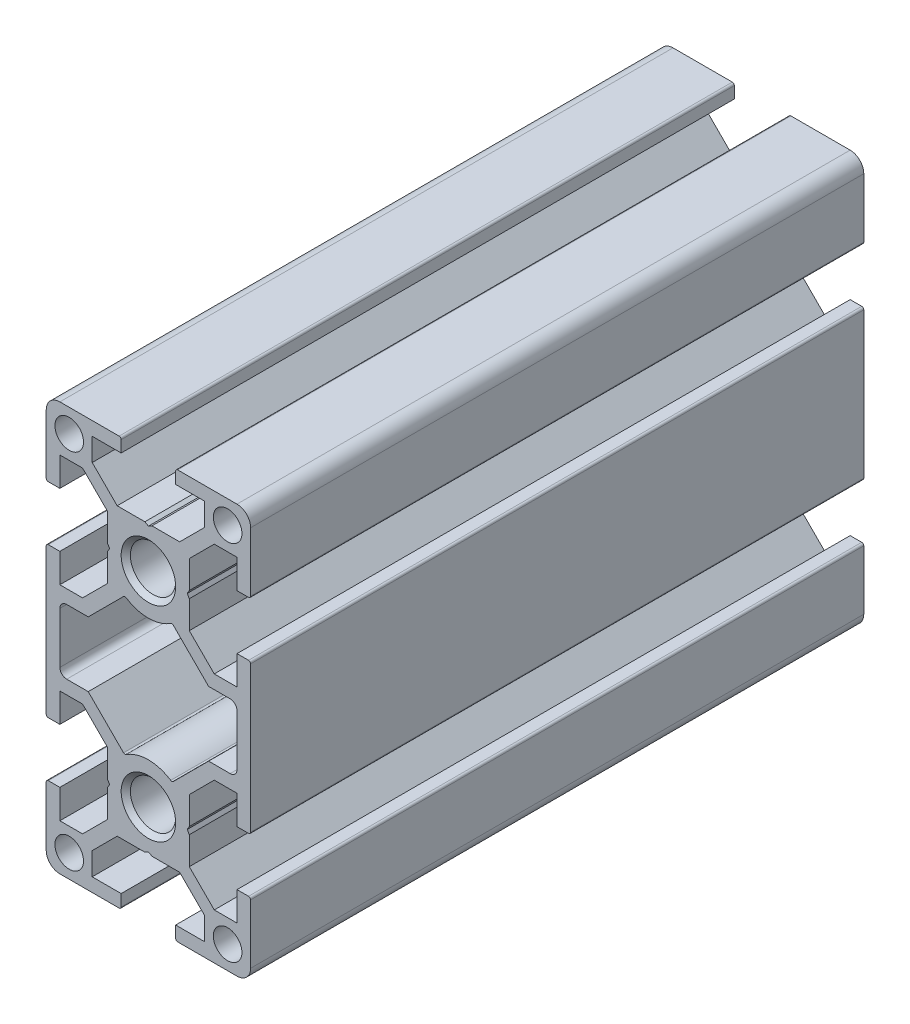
ISO-10303-21;
HEADER;
FILE_DESCRIPTION(('STEP AP214'),'2;1');
FILE_NAME('part.step','',(''),(''),'','','');
FILE_SCHEMA(('AUTOMOTIVE_DESIGN { 1 0 10303 214 1 1 1 1 }'));
ENDSEC;
DATA;
#1=APPLICATION_CONTEXT('core data for automotive mechanical design processes');
#2=APPLICATION_PROTOCOL_DEFINITION('international standard','automotive_design',2000,#1);
#3=PRODUCT_CONTEXT('',#1,'mechanical');
#4=PRODUCT('Part','Part','',(#3));
#5=PRODUCT_RELATED_PRODUCT_CATEGORY('part','',(#4));
#6=PRODUCT_DEFINITION_FORMATION('','',#4);
#7=PRODUCT_DEFINITION_CONTEXT('part definition',#1,'design');
#8=PRODUCT_DEFINITION('design','',#6,#7);
#9=PRODUCT_DEFINITION_SHAPE('','',#8);
#10=(LENGTH_UNIT() NAMED_UNIT(*) SI_UNIT(.MILLI.,.METRE.));
#11=(NAMED_UNIT(*) PLANE_ANGLE_UNIT() SI_UNIT($,.RADIAN.));
#12=(NAMED_UNIT(*) SI_UNIT($,.STERADIAN.) SOLID_ANGLE_UNIT());
#13=UNCERTAINTY_MEASURE_WITH_UNIT(LENGTH_MEASURE(1.E-05),#10,'distance_accuracy_value','');
#14=(GEOMETRIC_REPRESENTATION_CONTEXT(3) GLOBAL_UNCERTAINTY_ASSIGNED_CONTEXT((#13)) GLOBAL_UNIT_ASSIGNED_CONTEXT((#10,
#11,#12)) REPRESENTATION_CONTEXT('',''));
#15=CARTESIAN_POINT('',(0.,0.,0.));
#16=DIRECTION('',(0.,0.,1.));
#17=DIRECTION('',(1.,0.,0.));
#18=AXIS2_PLACEMENT_3D('',#15,#16,#17);
#19=CARTESIAN_POINT('',(-13.,-28.,-90.));
#20=DIRECTION('',(0.,0.,1.));
#21=DIRECTION('',(1.,0.,0.));
#22=AXIS2_PLACEMENT_3D('',#19,#20,#21);
#23=CYLINDRICAL_SURFACE('',#22,2.);
#24=CARTESIAN_POINT('',(-13.,-28.,0.));
#25=DIRECTION('',(0.,0.,1.));
#26=DIRECTION('',(1.,0.,0.));
#27=AXIS2_PLACEMENT_3D('',#24,#25,#26);
#28=CIRCLE('',#27,2.);
#29=CARTESIAN_POINT('',(-15.,-28.,0.));
#30=VERTEX_POINT('',#29);
#31=CARTESIAN_POINT('',(-13.,-30.,0.));
#32=VERTEX_POINT('',#31);
#33=EDGE_CURVE('E919',#30,#32,#28,.T.);
#34=ORIENTED_EDGE('',*,*,#33,.F.);
#35=DIRECTION('',(0.,0.,1.));
#36=VECTOR('',#35,1.);
#37=CARTESIAN_POINT('',(-15.,-28.,-90.));
#38=LINE('',#37,#36);
#39=CARTESIAN_POINT('',(-15.,-28.,-90.));
#40=VERTEX_POINT('',#39);
#41=EDGE_CURVE('E11',#40,#30,#38,.T.);
#42=ORIENTED_EDGE('',*,*,#41,.F.);
#43=CARTESIAN_POINT('',(-13.,-28.,-90.));
#44=DIRECTION('',(0.,0.,1.));
#45=DIRECTION('',(1.,0.,0.));
#46=AXIS2_PLACEMENT_3D('',#43,#44,#45);
#47=CIRCLE('',#46,2.);
#48=CARTESIAN_POINT('',(-13.,-30.,-90.));
#49=VERTEX_POINT('',#48);
#50=EDGE_CURVE('E922',#40,#49,#47,.T.);
#51=ORIENTED_EDGE('',*,*,#50,.T.);
#52=DIRECTION('',(0.,0.,1.));
#53=VECTOR('',#52,1.);
#54=CARTESIAN_POINT('',(-13.,-30.,-90.));
#55=LINE('',#54,#53);
#56=EDGE_CURVE('E1217',#49,#32,#55,.T.);
#57=ORIENTED_EDGE('',*,*,#56,.T.);
#58=EDGE_LOOP('',(#34,#42,#51,#57));
#59=FACE_BOUND('',#58,.T.);
#60=ADVANCED_FACE('F16',(#59),#23,.T.);
#61=CARTESIAN_POINT('',(-15.,-19.3000023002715,-90.));
#62=DIRECTION('',(-1.,0.,0.));
#63=DIRECTION('',(0.,0.,1.));
#64=AXIS2_PLACEMENT_3D('',#61,#62,#63);
#65=PLANE('',#64);
#66=DIRECTION('',(0.,-1.,0.));
#67=VECTOR('',#66,1.);
#68=CARTESIAN_POINT('',(-15.,-19.3000023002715,0.));
#69=LINE('',#68,#67);
#70=CARTESIAN_POINT('',(-15.,-19.3000023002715,0.));
#71=VERTEX_POINT('',#70);
#72=EDGE_CURVE('E926',#71,#30,#69,.T.);
#73=ORIENTED_EDGE('',*,*,#72,.F.);
#74=DIRECTION('',(0.,0.,1.));
#75=VECTOR('',#74,1.);
#76=CARTESIAN_POINT('',(-15.,-19.3000023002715,-90.));
#77=LINE('',#76,#75);
#78=CARTESIAN_POINT('',(-15.,-19.3000023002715,-90.));
#79=VERTEX_POINT('',#78);
#80=EDGE_CURVE('E24',#79,#71,#77,.T.);
#81=ORIENTED_EDGE('',*,*,#80,.F.);
#82=DIRECTION('',(0.,-1.,0.));
#83=VECTOR('',#82,1.);
#84=CARTESIAN_POINT('',(-15.,-19.3000023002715,-90.));
#85=LINE('',#84,#83);
#86=EDGE_CURVE('E1214',#79,#40,#85,.T.);
#87=ORIENTED_EDGE('',*,*,#86,.T.);
#88=ORIENTED_EDGE('',*,*,#41,.T.);
#89=EDGE_LOOP('',(#73,#81,#87,#88));
#90=FACE_BOUND('',#89,.T.);
#91=ADVANCED_FACE('F2127',(#90),#65,.T.);
#92=CARTESIAN_POINT('',(-14.7,-19.3000023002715,-90.));
#93=DIRECTION('',(0.,0.,1.));
#94=DIRECTION('',(1.,0.,0.));
#95=AXIS2_PLACEMENT_3D('',#92,#93,#94);
#96=CYLINDRICAL_SURFACE('',#95,0.299999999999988);
#97=CARTESIAN_POINT('',(-14.7,-19.3000023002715,0.));
#98=DIRECTION('',(0.,0.,1.));
#99=DIRECTION('',(1.,0.,0.));
#100=AXIS2_PLACEMENT_3D('',#97,#98,#99);
#101=CIRCLE('',#100,0.299999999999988);
#102=CARTESIAN_POINT('',(-14.7,-19.0000023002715,0.));
#103=VERTEX_POINT('',#102);
#104=EDGE_CURVE('E1505',#103,#71,#101,.T.);
#105=ORIENTED_EDGE('',*,*,#104,.F.);
#106=DIRECTION('',(0.,0.,1.));
#107=VECTOR('',#106,1.);
#108=CARTESIAN_POINT('',(-14.7,-19.0000023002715,-90.));
#109=LINE('',#108,#107);
#110=CARTESIAN_POINT('',(-14.7,-19.0000023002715,-90.));
#111=VERTEX_POINT('',#110);
#112=EDGE_CURVE('E1511',#111,#103,#109,.T.);
#113=ORIENTED_EDGE('',*,*,#112,.F.);
#114=CARTESIAN_POINT('',(-14.7,-19.3000023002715,-90.));
#115=DIRECTION('',(0.,0.,1.));
#116=DIRECTION('',(1.,0.,0.));
#117=AXIS2_PLACEMENT_3D('',#114,#115,#116);
#118=CIRCLE('',#117,0.299999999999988);
#119=EDGE_CURVE('E1211',#111,#79,#118,.T.);
#120=ORIENTED_EDGE('',*,*,#119,.T.);
#121=ORIENTED_EDGE('',*,*,#80,.T.);
#122=EDGE_LOOP('',(#105,#113,#120,#121));
#123=FACE_BOUND('',#122,.T.);
#124=ADVANCED_FACE('F2131',(#123),#96,.T.);
#125=CARTESIAN_POINT('',(-12.9999999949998,-19.0000023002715,-90.));
#126=DIRECTION('',(0.,1.,0.));
#127=DIRECTION('',(0.,0.,1.));
#128=AXIS2_PLACEMENT_3D('',#125,#126,#127);
#129=PLANE('',#128);
#130=DIRECTION('',(-1.,0.,0.));
#131=VECTOR('',#130,1.);
#132=CARTESIAN_POINT('',(-12.9999999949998,-19.0000023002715,0.));
#133=LINE('',#132,#131);
#134=CARTESIAN_POINT('',(-12.9999999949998,-19.0000023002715,0.));
#135=VERTEX_POINT('',#134);
#136=EDGE_CURVE('E1502',#135,#103,#133,.T.);
#137=ORIENTED_EDGE('',*,*,#136,.F.);
#138=DIRECTION('',(0.,0.,1.));
#139=VECTOR('',#138,1.);
#140=CARTESIAN_POINT('',(-12.9999999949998,-19.0000023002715,-90.));
#141=LINE('',#140,#139);
#142=CARTESIAN_POINT('',(-12.9999999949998,-19.0000023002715,-90.));
#143=VERTEX_POINT('',#142);
#144=EDGE_CURVE('E1513',#143,#135,#141,.T.);
#145=ORIENTED_EDGE('',*,*,#144,.F.);
#146=DIRECTION('',(-1.,0.,0.));
#147=VECTOR('',#146,1.);
#148=CARTESIAN_POINT('',(-12.9999999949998,-19.0000023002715,-90.));
#149=LINE('',#148,#147);
#150=EDGE_CURVE('E1208',#143,#111,#149,.T.);
#151=ORIENTED_EDGE('',*,*,#150,.T.);
#152=ORIENTED_EDGE('',*,*,#112,.T.);
#153=EDGE_LOOP('',(#137,#145,#151,#152));
#154=FACE_BOUND('',#153,.T.);
#155=ADVANCED_FACE('F2123',(#154),#129,.T.);
#156=CARTESIAN_POINT('',(-12.9999999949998,-23.2500000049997,-90.));
#157=DIRECTION('',(1.,0.,0.));
#158=DIRECTION('',(0.,0.,-1.));
#159=AXIS2_PLACEMENT_3D('',#156,#157,#158);
#160=PLANE('',#159);
#161=DIRECTION('',(0.,1.,0.));
#162=VECTOR('',#161,1.);
#163=CARTESIAN_POINT('',(-12.9999999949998,-23.2500000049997,0.));
#164=LINE('',#163,#162);
#165=CARTESIAN_POINT('',(-12.9999999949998,-23.2500000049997,0.));
#166=VERTEX_POINT('',#165);
#167=EDGE_CURVE('E1499',#166,#135,#164,.T.);
#168=ORIENTED_EDGE('',*,*,#167,.F.);
#169=DIRECTION('',(0.,0.,1.));
#170=VECTOR('',#169,1.);
#171=CARTESIAN_POINT('',(-12.9999999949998,-23.2500000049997,-90.));
#172=LINE('',#171,#170);
#173=CARTESIAN_POINT('',(-12.9999999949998,-23.2500000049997,-90.));
#174=VERTEX_POINT('',#173);
#175=EDGE_CURVE('E1515',#174,#166,#172,.T.);
#176=ORIENTED_EDGE('',*,*,#175,.F.);
#177=DIRECTION('',(0.,1.,0.));
#178=VECTOR('',#177,1.);
#179=CARTESIAN_POINT('',(-12.9999999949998,-23.2500000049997,-90.));
#180=LINE('',#179,#178);
#181=EDGE_CURVE('E1205',#174,#143,#180,.T.);
#182=ORIENTED_EDGE('',*,*,#181,.T.);
#183=ORIENTED_EDGE('',*,*,#144,.T.);
#184=EDGE_LOOP('',(#168,#176,#182,#183));
#185=FACE_BOUND('',#184,.T.);
#186=ADVANCED_FACE('F2119',(#185),#160,.T.);
#187=CARTESIAN_POINT('',(-9.66421355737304,-23.2500000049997,-90.));
#188=DIRECTION('',(0.,1.,0.));
#189=DIRECTION('',(0.,0.,1.));
#190=AXIS2_PLACEMENT_3D('',#187,#188,#189);
#191=PLANE('',#190);
#192=DIRECTION('',(-1.,0.,0.));
#193=VECTOR('',#192,1.);
#194=CARTESIAN_POINT('',(-9.66421355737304,-23.2500000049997,0.));
#195=LINE('',#194,#193);
#196=CARTESIAN_POINT('',(-9.66421355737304,-23.2500000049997,0.));
#197=VERTEX_POINT('',#196);
#198=EDGE_CURVE('E1496',#197,#166,#195,.T.);
#199=ORIENTED_EDGE('',*,*,#198,.F.);
#200=DIRECTION('',(0.,0.,1.));
#201=VECTOR('',#200,1.);
#202=CARTESIAN_POINT('',(-9.66421355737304,-23.2500000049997,-90.));
#203=LINE('',#202,#201);
#204=CARTESIAN_POINT('',(-9.66421355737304,-23.2500000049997,-90.));
#205=VERTEX_POINT('',#204);
#206=EDGE_CURVE('E1517',#205,#197,#203,.T.);
#207=ORIENTED_EDGE('',*,*,#206,.F.);
#208=DIRECTION('',(-1.,0.,0.));
#209=VECTOR('',#208,1.);
#210=CARTESIAN_POINT('',(-9.66421355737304,-23.2500000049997,-90.));
#211=LINE('',#210,#209);
#212=EDGE_CURVE('E1202',#205,#174,#211,.T.);
#213=ORIENTED_EDGE('',*,*,#212,.T.);
#214=ORIENTED_EDGE('',*,*,#175,.T.);
#215=EDGE_LOOP('',(#199,#207,#213,#214));
#216=FACE_BOUND('',#215,.T.);
#217=ADVANCED_FACE('F2115',(#216),#191,.T.);
#218=CARTESIAN_POINT('',(-5.9999999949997,-19.5857864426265,-90.));
#219=DIRECTION('',(-0.707106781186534,0.707106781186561,0.));
#220=DIRECTION('',(-0.707106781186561,-0.707106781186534,0.));
#221=AXIS2_PLACEMENT_3D('',#218,#219,#220);
#222=PLANE('',#221);
#223=DIRECTION('',(-0.707106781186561,-0.707106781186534,0.));
#224=VECTOR('',#223,1.);
#225=CARTESIAN_POINT('',(-5.9999999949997,-19.5857864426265,0.));
#226=LINE('',#225,#224);
#227=CARTESIAN_POINT('',(-5.9999999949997,-19.5857864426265,0.));
#228=VERTEX_POINT('',#227);
#229=EDGE_CURVE('E1493',#228,#197,#226,.T.);
#230=ORIENTED_EDGE('',*,*,#229,.F.);
#231=DIRECTION('',(0.,0.,1.));
#232=VECTOR('',#231,1.);
#233=CARTESIAN_POINT('',(-5.9999999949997,-19.5857864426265,-90.));
#234=LINE('',#233,#232);
#235=CARTESIAN_POINT('',(-5.9999999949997,-19.5857864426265,-90.));
#236=VERTEX_POINT('',#235);
#237=EDGE_CURVE('E1519',#236,#228,#234,.T.);
#238=ORIENTED_EDGE('',*,*,#237,.F.);
#239=DIRECTION('',(-0.707106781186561,-0.707106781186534,0.));
#240=VECTOR('',#239,1.);
#241=CARTESIAN_POINT('',(-5.9999999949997,-19.5857864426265,-90.));
#242=LINE('',#241,#240);
#243=EDGE_CURVE('E1199',#236,#205,#242,.T.);
#244=ORIENTED_EDGE('',*,*,#243,.T.);
#245=ORIENTED_EDGE('',*,*,#206,.T.);
#246=EDGE_LOOP('',(#230,#238,#244,#245));
#247=FACE_BOUND('',#246,.T.);
#248=ADVANCED_FACE('F2111',(#247),#222,.T.);
#249=CARTESIAN_POINT('',(-5.99999999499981,-15.5196152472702,-90.));
#250=DIRECTION('',(-1.,0.,0.));
#251=DIRECTION('',(0.,-1.,0.));
#252=AXIS2_PLACEMENT_3D('',#249,#250,#251);
#253=PLANE('',#252);
#254=DIRECTION('',(0.,-1.,0.));
#255=VECTOR('',#254,1.);
#256=CARTESIAN_POINT('',(-5.99999999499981,-15.5196152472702,0.));
#257=LINE('',#256,#255);
#258=CARTESIAN_POINT('',(-5.99999999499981,-15.5196152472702,0.));
#259=VERTEX_POINT('',#258);
#260=EDGE_CURVE('E1490',#259,#228,#257,.T.);
#261=ORIENTED_EDGE('',*,*,#260,.F.);
#262=DIRECTION('',(0.,0.,1.));
#263=VECTOR('',#262,1.);
#264=CARTESIAN_POINT('',(-5.99999999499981,-15.5196152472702,-90.));
#265=LINE('',#264,#263);
#266=CARTESIAN_POINT('',(-5.99999999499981,-15.5196152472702,-90.));
#267=VERTEX_POINT('',#266);
#268=EDGE_CURVE('E1521',#267,#259,#265,.T.);
#269=ORIENTED_EDGE('',*,*,#268,.F.);
#270=DIRECTION('',(0.,-1.,0.));
#271=VECTOR('',#270,1.);
#272=CARTESIAN_POINT('',(-5.99999999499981,-15.5196152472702,-90.));
#273=LINE('',#272,#271);
#274=EDGE_CURVE('E1196',#267,#236,#273,.T.);
#275=ORIENTED_EDGE('',*,*,#274,.T.);
#276=ORIENTED_EDGE('',*,*,#237,.T.);
#277=EDGE_LOOP('',(#261,#269,#275,#276));
#278=FACE_BOUND('',#277,.T.);
#279=ADVANCED_FACE('F2107',(#278),#253,.T.);
#280=CARTESIAN_POINT('',(-5.69999999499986,-15.0000000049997,-90.));
#281=DIRECTION('',(-0.866025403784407,0.500000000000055,0.));
#282=DIRECTION('',(-0.500000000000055,-0.866025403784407,0.));
#283=AXIS2_PLACEMENT_3D('',#280,#281,#282);
#284=PLANE('',#283);
#285=DIRECTION('',(-0.500000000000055,-0.866025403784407,0.));
#286=VECTOR('',#285,1.);
#287=CARTESIAN_POINT('',(-5.69999999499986,-15.0000000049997,0.));
#288=LINE('',#287,#286);
#289=CARTESIAN_POINT('',(-5.69999999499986,-15.0000000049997,0.));
#290=VERTEX_POINT('',#289);
#291=EDGE_CURVE('E1487',#290,#259,#288,.T.);
#292=ORIENTED_EDGE('',*,*,#291,.F.);
#293=DIRECTION('',(0.,0.,1.));
#294=VECTOR('',#293,1.);
#295=CARTESIAN_POINT('',(-5.69999999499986,-15.0000000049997,-90.));
#296=LINE('',#295,#294);
#297=CARTESIAN_POINT('',(-5.69999999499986,-15.0000000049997,-90.));
#298=VERTEX_POINT('',#297);
#299=EDGE_CURVE('E1523',#298,#290,#296,.T.);
#300=ORIENTED_EDGE('',*,*,#299,.F.);
#301=DIRECTION('',(-0.500000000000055,-0.866025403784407,0.));
#302=VECTOR('',#301,1.);
#303=CARTESIAN_POINT('',(-5.69999999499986,-15.0000000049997,-90.));
#304=LINE('',#303,#302);
#305=EDGE_CURVE('E1193',#298,#267,#304,.T.);
#306=ORIENTED_EDGE('',*,*,#305,.T.);
#307=ORIENTED_EDGE('',*,*,#268,.T.);
#308=EDGE_LOOP('',(#292,#300,#306,#307));
#309=FACE_BOUND('',#308,.T.);
#310=ADVANCED_FACE('F2103',(#309),#284,.T.);
#311=CARTESIAN_POINT('',(-5.99999999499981,-14.480384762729,-90.));
#312=DIRECTION('',(-0.866025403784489,-0.499999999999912,0.));
#313=DIRECTION('',(0.499999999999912,-0.86602540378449,0.));
#314=AXIS2_PLACEMENT_3D('',#311,#312,#313);
#315=PLANE('',#314);
#316=DIRECTION('',(0.499999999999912,-0.866025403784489,0.));
#317=VECTOR('',#316,1.);
#318=CARTESIAN_POINT('',(-5.99999999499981,-14.480384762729,0.));
#319=LINE('',#318,#317);
#320=CARTESIAN_POINT('',(-5.99999999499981,-14.480384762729,0.));
#321=VERTEX_POINT('',#320);
#322=EDGE_CURVE('E1484',#321,#290,#319,.T.);
#323=ORIENTED_EDGE('',*,*,#322,.F.);
#324=DIRECTION('',(0.,0.,1.));
#325=VECTOR('',#324,1.);
#326=CARTESIAN_POINT('',(-5.99999999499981,-14.480384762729,-90.));
#327=LINE('',#326,#325);
#328=CARTESIAN_POINT('',(-5.99999999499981,-14.480384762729,-90.));
#329=VERTEX_POINT('',#328);
#330=EDGE_CURVE('E1525',#329,#321,#327,.T.);
#331=ORIENTED_EDGE('',*,*,#330,.F.);
#332=DIRECTION('',(0.499999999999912,-0.866025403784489,0.));
#333=VECTOR('',#332,1.);
#334=CARTESIAN_POINT('',(-5.99999999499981,-14.480384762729,-90.));
#335=LINE('',#334,#333);
#336=EDGE_CURVE('E1190',#329,#298,#335,.T.);
#337=ORIENTED_EDGE('',*,*,#336,.T.);
#338=ORIENTED_EDGE('',*,*,#299,.T.);
#339=EDGE_LOOP('',(#323,#331,#337,#338));
#340=FACE_BOUND('',#339,.T.);
#341=ADVANCED_FACE('F2099',(#340),#315,.T.);
#342=CARTESIAN_POINT('',(-5.99999999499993,-10.4142135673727,-90.));
#343=DIRECTION('',(-1.,0.,0.));
#344=DIRECTION('',(0.,-1.,0.));
#345=AXIS2_PLACEMENT_3D('',#342,#343,#344);
#346=PLANE('',#345);
#347=DIRECTION('',(0.,-1.,0.));
#348=VECTOR('',#347,1.);
#349=CARTESIAN_POINT('',(-5.99999999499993,-10.4142135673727,0.));
#350=LINE('',#349,#348);
#351=CARTESIAN_POINT('',(-5.99999999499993,-10.4142135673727,0.));
#352=VERTEX_POINT('',#351);
#353=EDGE_CURVE('E1481',#352,#321,#350,.T.);
#354=ORIENTED_EDGE('',*,*,#353,.F.);
#355=DIRECTION('',(0.,0.,1.));
#356=VECTOR('',#355,1.);
#357=CARTESIAN_POINT('',(-5.99999999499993,-10.4142135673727,-90.));
#358=LINE('',#357,#356);
#359=CARTESIAN_POINT('',(-5.99999999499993,-10.4142135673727,-90.));
#360=VERTEX_POINT('',#359);
#361=EDGE_CURVE('E1527',#360,#352,#358,.T.);
#362=ORIENTED_EDGE('',*,*,#361,.F.);
#363=DIRECTION('',(0.,-1.,0.));
#364=VECTOR('',#363,1.);
#365=CARTESIAN_POINT('',(-5.99999999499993,-10.4142135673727,-90.));
#366=LINE('',#365,#364);
#367=EDGE_CURVE('E1187',#360,#329,#366,.T.);
#368=ORIENTED_EDGE('',*,*,#367,.T.);
#369=ORIENTED_EDGE('',*,*,#330,.T.);
#370=EDGE_LOOP('',(#354,#362,#368,#369));
#371=FACE_BOUND('',#370,.T.);
#372=ADVANCED_FACE('F2095',(#371),#346,.T.);
#373=CARTESIAN_POINT('',(-9.66421355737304,-6.75000000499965,-90.));
#374=DIRECTION('',(-0.707106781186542,-0.707106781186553,0.));
#375=DIRECTION('',(0.707106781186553,-0.707106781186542,0.));
#376=AXIS2_PLACEMENT_3D('',#373,#374,#375);
#377=PLANE('',#376);
#378=DIRECTION('',(0.707106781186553,-0.707106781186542,0.));
#379=VECTOR('',#378,1.);
#380=CARTESIAN_POINT('',(-9.66421355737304,-6.75000000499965,0.));
#381=LINE('',#380,#379);
#382=CARTESIAN_POINT('',(-9.66421355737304,-6.75000000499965,0.));
#383=VERTEX_POINT('',#382);
#384=EDGE_CURVE('E1478',#383,#352,#381,.T.);
#385=ORIENTED_EDGE('',*,*,#384,.F.);
#386=DIRECTION('',(0.,0.,1.));
#387=VECTOR('',#386,1.);
#388=CARTESIAN_POINT('',(-9.66421355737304,-6.75000000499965,-90.));
#389=LINE('',#388,#387);
#390=CARTESIAN_POINT('',(-9.66421355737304,-6.75000000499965,-90.));
#391=VERTEX_POINT('',#390);
#392=EDGE_CURVE('E1529',#391,#383,#389,.T.);
#393=ORIENTED_EDGE('',*,*,#392,.F.);
#394=DIRECTION('',(0.707106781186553,-0.707106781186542,0.));
#395=VECTOR('',#394,1.);
#396=CARTESIAN_POINT('',(-9.66421355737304,-6.75000000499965,-90.));
#397=LINE('',#396,#395);
#398=EDGE_CURVE('E1184',#391,#360,#397,.T.);
#399=ORIENTED_EDGE('',*,*,#398,.T.);
#400=ORIENTED_EDGE('',*,*,#361,.T.);
#401=EDGE_LOOP('',(#385,#393,#399,#400));
#402=FACE_BOUND('',#401,.T.);
#403=ADVANCED_FACE('F2091',(#402),#377,.T.);
#404=CARTESIAN_POINT('',(-12.9999999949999,-6.75000000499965,-90.));
#405=DIRECTION('',(0.,-1.,0.));
#406=DIRECTION('',(0.,0.,-1.));
#407=AXIS2_PLACEMENT_3D('',#404,#405,#406);
#408=PLANE('',#407);
#409=DIRECTION('',(1.,0.,0.));
#410=VECTOR('',#409,1.);
#411=CARTESIAN_POINT('',(-12.9999999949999,-6.75000000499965,0.));
#412=LINE('',#411,#410);
#413=CARTESIAN_POINT('',(-12.9999999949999,-6.75000000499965,0.));
#414=VERTEX_POINT('',#413);
#415=EDGE_CURVE('E1475',#414,#383,#412,.T.);
#416=ORIENTED_EDGE('',*,*,#415,.F.);
#417=DIRECTION('',(0.,0.,1.));
#418=VECTOR('',#417,1.);
#419=CARTESIAN_POINT('',(-12.9999999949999,-6.75000000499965,-90.));
#420=LINE('',#419,#418);
#421=CARTESIAN_POINT('',(-12.9999999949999,-6.75000000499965,-90.));
#422=VERTEX_POINT('',#421);
#423=EDGE_CURVE('E1531',#422,#414,#420,.T.);
#424=ORIENTED_EDGE('',*,*,#423,.F.);
#425=DIRECTION('',(1.,0.,0.));
#426=VECTOR('',#425,1.);
#427=CARTESIAN_POINT('',(-12.9999999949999,-6.75000000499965,-90.));
#428=LINE('',#427,#426);
#429=EDGE_CURVE('E1181',#422,#391,#428,.T.);
#430=ORIENTED_EDGE('',*,*,#429,.T.);
#431=ORIENTED_EDGE('',*,*,#392,.T.);
#432=EDGE_LOOP('',(#416,#424,#430,#431));
#433=FACE_BOUND('',#432,.T.);
#434=ADVANCED_FACE('F2087',(#433),#408,.T.);
#435=CARTESIAN_POINT('',(-12.9999999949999,-11.0000023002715,-90.));
#436=DIRECTION('',(1.,0.,0.));
#437=DIRECTION('',(0.,0.,-1.));
#438=AXIS2_PLACEMENT_3D('',#435,#436,#437);
#439=PLANE('',#438);
#440=DIRECTION('',(0.,1.,0.));
#441=VECTOR('',#440,1.);
#442=CARTESIAN_POINT('',(-12.9999999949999,-11.0000023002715,0.));
#443=LINE('',#442,#441);
#444=CARTESIAN_POINT('',(-12.9999999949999,-11.0000023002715,0.));
#445=VERTEX_POINT('',#444);
#446=EDGE_CURVE('E1472',#445,#414,#443,.T.);
#447=ORIENTED_EDGE('',*,*,#446,.F.);
#448=DIRECTION('',(0.,0.,1.));
#449=VECTOR('',#448,1.);
#450=CARTESIAN_POINT('',(-12.9999999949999,-11.0000023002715,-90.));
#451=LINE('',#450,#449);
#452=CARTESIAN_POINT('',(-12.9999999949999,-11.0000023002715,-90.));
#453=VERTEX_POINT('',#452);
#454=EDGE_CURVE('E1533',#453,#445,#451,.T.);
#455=ORIENTED_EDGE('',*,*,#454,.F.);
#456=DIRECTION('',(0.,1.,0.));
#457=VECTOR('',#456,1.);
#458=CARTESIAN_POINT('',(-12.9999999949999,-11.0000023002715,-90.));
#459=LINE('',#458,#457);
#460=EDGE_CURVE('E1178',#453,#422,#459,.T.);
#461=ORIENTED_EDGE('',*,*,#460,.T.);
#462=ORIENTED_EDGE('',*,*,#423,.T.);
#463=EDGE_LOOP('',(#447,#455,#461,#462));
#464=FACE_BOUND('',#463,.T.);
#465=ADVANCED_FACE('F2083',(#464),#439,.T.);
#466=CARTESIAN_POINT('',(-14.7,-11.0000023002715,-90.));
#467=DIRECTION('',(0.,-1.,0.));
#468=DIRECTION('',(0.,0.,-1.));
#469=AXIS2_PLACEMENT_3D('',#466,#467,#468);
#470=PLANE('',#469);
#471=DIRECTION('',(1.,0.,0.));
#472=VECTOR('',#471,1.);
#473=CARTESIAN_POINT('',(-14.7,-11.0000023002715,0.));
#474=LINE('',#473,#472);
#475=CARTESIAN_POINT('',(-14.7,-11.0000023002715,0.));
#476=VERTEX_POINT('',#475);
#477=EDGE_CURVE('E1469',#476,#445,#474,.T.);
#478=ORIENTED_EDGE('',*,*,#477,.F.);
#479=DIRECTION('',(0.,0.,1.));
#480=VECTOR('',#479,1.);
#481=CARTESIAN_POINT('',(-14.7,-11.0000023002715,-90.));
#482=LINE('',#481,#480);
#483=CARTESIAN_POINT('',(-14.7,-11.0000023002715,-90.));
#484=VERTEX_POINT('',#483);
#485=EDGE_CURVE('E1535',#484,#476,#482,.T.);
#486=ORIENTED_EDGE('',*,*,#485,.F.);
#487=DIRECTION('',(1.,0.,0.));
#488=VECTOR('',#487,1.);
#489=CARTESIAN_POINT('',(-14.7,-11.0000023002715,-90.));
#490=LINE('',#489,#488);
#491=EDGE_CURVE('E1175',#484,#453,#490,.T.);
#492=ORIENTED_EDGE('',*,*,#491,.T.);
#493=ORIENTED_EDGE('',*,*,#454,.T.);
#494=EDGE_LOOP('',(#478,#486,#492,#493));
#495=FACE_BOUND('',#494,.T.);
#496=ADVANCED_FACE('F2079',(#495),#470,.T.);
#497=CARTESIAN_POINT('',(-14.7,-10.7000023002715,-90.));
#498=DIRECTION('',(0.,0.,1.));
#499=DIRECTION('',(1.,0.,0.));
#500=AXIS2_PLACEMENT_3D('',#497,#498,#499);
#501=CYLINDRICAL_SURFACE('',#500,0.3);
#502=CARTESIAN_POINT('',(-14.7,-10.7000023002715,0.));
#503=DIRECTION('',(0.,0.,1.));
#504=DIRECTION('',(1.,0.,0.));
#505=AXIS2_PLACEMENT_3D('',#502,#503,#504);
#506=CIRCLE('',#505,0.3);
#507=CARTESIAN_POINT('',(-15.,-10.7000023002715,0.));
#508=VERTEX_POINT('',#507);
#509=EDGE_CURVE('E1466',#508,#476,#506,.T.);
#510=ORIENTED_EDGE('',*,*,#509,.F.);
#511=DIRECTION('',(0.,0.,1.));
#512=VECTOR('',#511,1.);
#513=CARTESIAN_POINT('',(-15.,-10.7000023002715,-90.));
#514=LINE('',#513,#512);
#515=CARTESIAN_POINT('',(-15.,-10.7000023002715,-90.));
#516=VERTEX_POINT('',#515);
#517=EDGE_CURVE('E1537',#516,#508,#514,.T.);
#518=ORIENTED_EDGE('',*,*,#517,.F.);
#519=CARTESIAN_POINT('',(-14.7,-10.7000023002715,-90.));
#520=DIRECTION('',(0.,0.,1.));
#521=DIRECTION('',(1.,0.,0.));
#522=AXIS2_PLACEMENT_3D('',#519,#520,#521);
#523=CIRCLE('',#522,0.3);
#524=EDGE_CURVE('E1172',#516,#484,#523,.T.);
#525=ORIENTED_EDGE('',*,*,#524,.T.);
#526=ORIENTED_EDGE('',*,*,#485,.T.);
#527=EDGE_LOOP('',(#510,#518,#525,#526));
#528=FACE_BOUND('',#527,.T.);
#529=ADVANCED_FACE('F2075',(#528),#501,.T.);
#530=CARTESIAN_POINT('',(-15.,10.7000023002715,-90.));
#531=DIRECTION('',(-1.,0.,0.));
#532=DIRECTION('',(0.,0.,1.));
#533=AXIS2_PLACEMENT_3D('',#530,#531,#532);
#534=PLANE('',#533);
#535=DIRECTION('',(0.,-1.,0.));
#536=VECTOR('',#535,1.);
#537=CARTESIAN_POINT('',(-15.,10.7000023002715,0.));
#538=LINE('',#537,#536);
#539=CARTESIAN_POINT('',(-15.,10.7000023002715,0.));
#540=VERTEX_POINT('',#539);
#541=EDGE_CURVE('E1463',#540,#508,#538,.T.);
#542=ORIENTED_EDGE('',*,*,#541,.F.);
#543=DIRECTION('',(0.,0.,1.));
#544=VECTOR('',#543,1.);
#545=CARTESIAN_POINT('',(-15.,10.7000023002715,-90.));
#546=LINE('',#545,#544);
#547=CARTESIAN_POINT('',(-15.,10.7000023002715,-90.));
#548=VERTEX_POINT('',#547);
#549=EDGE_CURVE('E1539',#548,#540,#546,.T.);
#550=ORIENTED_EDGE('',*,*,#549,.F.);
#551=DIRECTION('',(0.,-1.,0.));
#552=VECTOR('',#551,1.);
#553=CARTESIAN_POINT('',(-15.,10.7000023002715,-90.));
#554=LINE('',#553,#552);
#555=EDGE_CURVE('E1169',#548,#516,#554,.T.);
#556=ORIENTED_EDGE('',*,*,#555,.T.);
#557=ORIENTED_EDGE('',*,*,#517,.T.);
#558=EDGE_LOOP('',(#542,#550,#556,#557));
#559=FACE_BOUND('',#558,.T.);
#560=ADVANCED_FACE('F2071',(#559),#534,.T.);
#561=CARTESIAN_POINT('',(-14.7,10.7000023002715,-90.));
#562=DIRECTION('',(0.,0.,1.));
#563=DIRECTION('',(1.,0.,0.));
#564=AXIS2_PLACEMENT_3D('',#561,#562,#563);
#565=CYLINDRICAL_SURFACE('',#564,0.300000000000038);
#566=CARTESIAN_POINT('',(-14.7,10.7000023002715,0.));
#567=DIRECTION('',(0.,0.,1.));
#568=DIRECTION('',(1.,0.,0.));
#569=AXIS2_PLACEMENT_3D('',#566,#567,#568);
#570=CIRCLE('',#569,0.300000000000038);
#571=CARTESIAN_POINT('',(-14.7,11.0000023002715,0.));
#572=VERTEX_POINT('',#571);
#573=EDGE_CURVE('E1460',#572,#540,#570,.T.);
#574=ORIENTED_EDGE('',*,*,#573,.F.);
#575=DIRECTION('',(0.,0.,1.));
#576=VECTOR('',#575,1.);
#577=CARTESIAN_POINT('',(-14.7,11.0000023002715,-90.));
#578=LINE('',#577,#576);
#579=CARTESIAN_POINT('',(-14.7,11.0000023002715,-90.));
#580=VERTEX_POINT('',#579);
#581=EDGE_CURVE('E1541',#580,#572,#578,.T.);
#582=ORIENTED_EDGE('',*,*,#581,.F.);
#583=CARTESIAN_POINT('',(-14.7,10.7000023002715,-90.));
#584=DIRECTION('',(0.,0.,1.));
#585=DIRECTION('',(1.,0.,0.));
#586=AXIS2_PLACEMENT_3D('',#583,#584,#585);
#587=CIRCLE('',#586,0.300000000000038);
#588=EDGE_CURVE('E1166',#580,#548,#587,.T.);
#589=ORIENTED_EDGE('',*,*,#588,.T.);
#590=ORIENTED_EDGE('',*,*,#549,.T.);
#591=EDGE_LOOP('',(#574,#582,#589,#590));
#592=FACE_BOUND('',#591,.T.);
#593=ADVANCED_FACE('F2067',(#592),#565,.T.);
#594=CARTESIAN_POINT('',(-12.9999999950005,11.0000023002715,-90.));
#595=DIRECTION('',(0.,1.,0.));
#596=DIRECTION('',(0.,0.,1.));
#597=AXIS2_PLACEMENT_3D('',#594,#595,#596);
#598=PLANE('',#597);
#599=DIRECTION('',(-1.,0.,0.));
#600=VECTOR('',#599,1.);
#601=CARTESIAN_POINT('',(-12.9999999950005,11.0000023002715,0.));
#602=LINE('',#601,#600);
#603=CARTESIAN_POINT('',(-12.9999999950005,11.0000023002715,0.));
#604=VERTEX_POINT('',#603);
#605=EDGE_CURVE('E1457',#604,#572,#602,.T.);
#606=ORIENTED_EDGE('',*,*,#605,.F.);
#607=DIRECTION('',(0.,0.,1.));
#608=VECTOR('',#607,1.);
#609=CARTESIAN_POINT('',(-12.9999999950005,11.0000023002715,-90.));
#610=LINE('',#609,#608);
#611=CARTESIAN_POINT('',(-12.9999999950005,11.0000023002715,-90.));
#612=VERTEX_POINT('',#611);
#613=EDGE_CURVE('E1543',#612,#604,#610,.T.);
#614=ORIENTED_EDGE('',*,*,#613,.F.);
#615=DIRECTION('',(-1.,0.,0.));
#616=VECTOR('',#615,1.);
#617=CARTESIAN_POINT('',(-12.9999999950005,11.0000023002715,-90.));
#618=LINE('',#617,#616);
#619=EDGE_CURVE('E1163',#612,#580,#618,.T.);
#620=ORIENTED_EDGE('',*,*,#619,.T.);
#621=ORIENTED_EDGE('',*,*,#581,.T.);
#622=EDGE_LOOP('',(#606,#614,#620,#621));
#623=FACE_BOUND('',#622,.T.);
#624=ADVANCED_FACE('F2063',(#623),#598,.T.);
#625=CARTESIAN_POINT('',(-12.9999999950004,6.74999999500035,-90.));
#626=DIRECTION('',(1.,0.,0.));
#627=DIRECTION('',(0.,1.,0.));
#628=AXIS2_PLACEMENT_3D('',#625,#626,#627);
#629=PLANE('',#628);
#630=DIRECTION('',(0.,1.,0.));
#631=VECTOR('',#630,1.);
#632=CARTESIAN_POINT('',(-12.9999999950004,6.74999999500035,0.));
#633=LINE('',#632,#631);
#634=CARTESIAN_POINT('',(-12.9999999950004,6.74999999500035,0.));
#635=VERTEX_POINT('',#634);
#636=EDGE_CURVE('E1454',#635,#604,#633,.T.);
#637=ORIENTED_EDGE('',*,*,#636,.F.);
#638=DIRECTION('',(0.,0.,1.));
#639=VECTOR('',#638,1.);
#640=CARTESIAN_POINT('',(-12.9999999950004,6.74999999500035,-90.));
#641=LINE('',#640,#639);
#642=CARTESIAN_POINT('',(-12.9999999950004,6.74999999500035,-90.));
#643=VERTEX_POINT('',#642);
#644=EDGE_CURVE('E1545',#643,#635,#641,.T.);
#645=ORIENTED_EDGE('',*,*,#644,.F.);
#646=DIRECTION('',(0.,1.,0.));
#647=VECTOR('',#646,1.);
#648=CARTESIAN_POINT('',(-12.9999999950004,6.74999999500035,-90.));
#649=LINE('',#648,#647);
#650=EDGE_CURVE('E1160',#643,#612,#649,.T.);
#651=ORIENTED_EDGE('',*,*,#650,.T.);
#652=ORIENTED_EDGE('',*,*,#613,.T.);
#653=EDGE_LOOP('',(#637,#645,#651,#652));
#654=FACE_BOUND('',#653,.T.);
#655=ADVANCED_FACE('F2059',(#654),#629,.T.);
#656=CARTESIAN_POINT('',(-9.66421355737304,6.74999999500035,-90.));
#657=DIRECTION('',(0.,1.,0.));
#658=DIRECTION('',(0.,0.,1.));
#659=AXIS2_PLACEMENT_3D('',#656,#657,#658);
#660=PLANE('',#659);
#661=DIRECTION('',(-1.,0.,0.));
#662=VECTOR('',#661,1.);
#663=CARTESIAN_POINT('',(-9.66421355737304,6.74999999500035,0.));
#664=LINE('',#663,#662);
#665=CARTESIAN_POINT('',(-9.66421355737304,6.74999999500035,0.));
#666=VERTEX_POINT('',#665);
#667=EDGE_CURVE('E1451',#666,#635,#664,.T.);
#668=ORIENTED_EDGE('',*,*,#667,.F.);
#669=DIRECTION('',(0.,0.,1.));
#670=VECTOR('',#669,1.);
#671=CARTESIAN_POINT('',(-9.66421355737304,6.74999999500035,-90.));
#672=LINE('',#671,#670);
#673=CARTESIAN_POINT('',(-9.66421355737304,6.74999999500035,-90.));
#674=VERTEX_POINT('',#673);
#675=EDGE_CURVE('E1547',#674,#666,#672,.T.);
#676=ORIENTED_EDGE('',*,*,#675,.F.);
#677=DIRECTION('',(-1.,0.,0.));
#678=VECTOR('',#677,1.);
#679=CARTESIAN_POINT('',(-9.66421355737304,6.74999999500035,-90.));
#680=LINE('',#679,#678);
#681=EDGE_CURVE('E1157',#674,#643,#680,.T.);
#682=ORIENTED_EDGE('',*,*,#681,.T.);
#683=ORIENTED_EDGE('',*,*,#644,.T.);
#684=EDGE_LOOP('',(#668,#676,#682,#683));
#685=FACE_BOUND('',#684,.T.);
#686=ADVANCED_FACE('F2055',(#685),#660,.T.);
#687=CARTESIAN_POINT('',(-5.99999999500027,10.4142135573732,-90.));
#688=DIRECTION('',(-0.707106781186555,0.70710678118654,0.));
#689=DIRECTION('',(-0.70710678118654,-0.707106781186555,0.));
#690=AXIS2_PLACEMENT_3D('',#687,#688,#689);
#691=PLANE('',#690);
#692=DIRECTION('',(-0.70710678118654,-0.707106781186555,0.));
#693=VECTOR('',#692,1.);
#694=CARTESIAN_POINT('',(-5.99999999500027,10.4142135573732,0.));
#695=LINE('',#694,#693);
#696=CARTESIAN_POINT('',(-5.99999999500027,10.4142135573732,0.));
#697=VERTEX_POINT('',#696);
#698=EDGE_CURVE('E1448',#697,#666,#695,.T.);
#699=ORIENTED_EDGE('',*,*,#698,.F.);
#700=DIRECTION('',(0.,0.,1.));
#701=VECTOR('',#700,1.);
#702=CARTESIAN_POINT('',(-5.99999999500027,10.4142135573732,-90.));
#703=LINE('',#702,#701);
#704=CARTESIAN_POINT('',(-5.99999999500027,10.4142135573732,-90.));
#705=VERTEX_POINT('',#704);
#706=EDGE_CURVE('E1549',#705,#697,#703,.T.);
#707=ORIENTED_EDGE('',*,*,#706,.F.);
#708=DIRECTION('',(-0.70710678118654,-0.707106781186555,0.));
#709=VECTOR('',#708,1.);
#710=CARTESIAN_POINT('',(-5.99999999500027,10.4142135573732,-90.));
#711=LINE('',#710,#709);
#712=EDGE_CURVE('E1154',#705,#674,#711,.T.);
#713=ORIENTED_EDGE('',*,*,#712,.T.);
#714=ORIENTED_EDGE('',*,*,#675,.T.);
#715=EDGE_LOOP('',(#699,#707,#713,#714));
#716=FACE_BOUND('',#715,.T.);
#717=ADVANCED_FACE('F2051',(#716),#691,.T.);
#718=CARTESIAN_POINT('',(-5.99999999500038,14.4803847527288,-90.));
#719=DIRECTION('',(-1.,0.,0.));
#720=DIRECTION('',(0.,-1.,0.));
#721=AXIS2_PLACEMENT_3D('',#718,#719,#720);
#722=PLANE('',#721);
#723=DIRECTION('',(0.,-1.,0.));
#724=VECTOR('',#723,1.);
#725=CARTESIAN_POINT('',(-5.99999999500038,14.4803847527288,0.));
#726=LINE('',#725,#724);
#727=CARTESIAN_POINT('',(-5.99999999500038,14.4803847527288,0.));
#728=VERTEX_POINT('',#727);
#729=EDGE_CURVE('E1445',#728,#697,#726,.T.);
#730=ORIENTED_EDGE('',*,*,#729,.F.);
#731=DIRECTION('',(0.,0.,1.));
#732=VECTOR('',#731,1.);
#733=CARTESIAN_POINT('',(-5.99999999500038,14.4803847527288,-90.));
#734=LINE('',#733,#732);
#735=CARTESIAN_POINT('',(-5.99999999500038,14.4803847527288,-90.));
#736=VERTEX_POINT('',#735);
#737=EDGE_CURVE('E1551',#736,#728,#734,.T.);
#738=ORIENTED_EDGE('',*,*,#737,.F.);
#739=DIRECTION('',(0.,-1.,0.));
#740=VECTOR('',#739,1.);
#741=CARTESIAN_POINT('',(-5.99999999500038,14.4803847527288,-90.));
#742=LINE('',#741,#740);
#743=EDGE_CURVE('E1151',#736,#705,#742,.T.);
#744=ORIENTED_EDGE('',*,*,#743,.T.);
#745=ORIENTED_EDGE('',*,*,#706,.T.);
#746=EDGE_LOOP('',(#730,#738,#744,#745));
#747=FACE_BOUND('',#746,.T.);
#748=ADVANCED_FACE('F2047',(#747),#722,.T.);
#749=CARTESIAN_POINT('',(-5.69999999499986,14.9999999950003,-90.));
#750=DIRECTION('',(-0.866025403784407,0.500000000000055,0.));
#751=DIRECTION('',(-0.500000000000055,-0.866025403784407,0.));
#752=AXIS2_PLACEMENT_3D('',#749,#750,#751);
#753=PLANE('',#752);
#754=DIRECTION('',(-0.500000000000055,-0.866025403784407,0.));
#755=VECTOR('',#754,1.);
#756=CARTESIAN_POINT('',(-5.69999999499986,14.9999999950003,0.));
#757=LINE('',#756,#755);
#758=CARTESIAN_POINT('',(-5.69999999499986,14.9999999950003,0.));
#759=VERTEX_POINT('',#758);
#760=EDGE_CURVE('E1442',#759,#728,#757,.T.);
#761=ORIENTED_EDGE('',*,*,#760,.F.);
#762=DIRECTION('',(0.,0.,1.));
#763=VECTOR('',#762,1.);
#764=CARTESIAN_POINT('',(-5.69999999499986,14.9999999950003,-90.));
#765=LINE('',#764,#763);
#766=CARTESIAN_POINT('',(-5.69999999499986,14.9999999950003,-90.));
#767=VERTEX_POINT('',#766);
#768=EDGE_CURVE('E1553',#767,#759,#765,.T.);
#769=ORIENTED_EDGE('',*,*,#768,.F.);
#770=DIRECTION('',(-0.500000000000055,-0.866025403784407,0.));
#771=VECTOR('',#770,1.);
#772=CARTESIAN_POINT('',(-5.69999999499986,14.9999999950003,-90.));
#773=LINE('',#772,#771);
#774=EDGE_CURVE('E1148',#767,#736,#773,.T.);
#775=ORIENTED_EDGE('',*,*,#774,.T.);
#776=ORIENTED_EDGE('',*,*,#737,.T.);
#777=EDGE_LOOP('',(#761,#769,#775,#776));
#778=FACE_BOUND('',#777,.T.);
#779=ADVANCED_FACE('F2043',(#778),#753,.T.);
#780=CARTESIAN_POINT('',(-5.9999999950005,15.5196152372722,-90.));
#781=DIRECTION('',(-0.866025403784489,-0.499999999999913,0.));
#782=DIRECTION('',(0.499999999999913,-0.866025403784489,0.));
#783=AXIS2_PLACEMENT_3D('',#780,#781,#782);
#784=PLANE('',#783);
#785=DIRECTION('',(0.499999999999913,-0.866025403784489,0.));
#786=VECTOR('',#785,1.);
#787=CARTESIAN_POINT('',(-5.9999999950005,15.5196152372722,0.));
#788=LINE('',#787,#786);
#789=CARTESIAN_POINT('',(-5.9999999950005,15.5196152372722,0.));
#790=VERTEX_POINT('',#789);
#791=EDGE_CURVE('E1439',#790,#759,#788,.T.);
#792=ORIENTED_EDGE('',*,*,#791,.F.);
#793=DIRECTION('',(0.,0.,1.));
#794=VECTOR('',#793,1.);
#795=CARTESIAN_POINT('',(-5.9999999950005,15.5196152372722,-90.));
#796=LINE('',#795,#794);
#797=CARTESIAN_POINT('',(-5.9999999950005,15.5196152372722,-90.));
#798=VERTEX_POINT('',#797);
#799=EDGE_CURVE('E1555',#798,#790,#796,.T.);
#800=ORIENTED_EDGE('',*,*,#799,.F.);
#801=DIRECTION('',(0.499999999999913,-0.866025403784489,0.));
#802=VECTOR('',#801,1.);
#803=CARTESIAN_POINT('',(-5.9999999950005,15.5196152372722,-90.));
#804=LINE('',#803,#802);
#805=EDGE_CURVE('E1145',#798,#767,#804,.T.);
#806=ORIENTED_EDGE('',*,*,#805,.T.);
#807=ORIENTED_EDGE('',*,*,#768,.T.);
#808=EDGE_LOOP('',(#792,#800,#806,#807));
#809=FACE_BOUND('',#808,.T.);
#810=ADVANCED_FACE('F2039',(#809),#784,.T.);
#811=CARTESIAN_POINT('',(-5.99999999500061,19.5857864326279,-90.));
#812=DIRECTION('',(-1.,0.,0.));
#813=DIRECTION('',(0.,-1.,0.));
#814=AXIS2_PLACEMENT_3D('',#811,#812,#813);
#815=PLANE('',#814);
#816=DIRECTION('',(0.,-1.,0.));
#817=VECTOR('',#816,1.);
#818=CARTESIAN_POINT('',(-5.99999999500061,19.5857864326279,0.));
#819=LINE('',#818,#817);
#820=CARTESIAN_POINT('',(-5.99999999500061,19.5857864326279,0.));
#821=VERTEX_POINT('',#820);
#822=EDGE_CURVE('E1436',#821,#790,#819,.T.);
#823=ORIENTED_EDGE('',*,*,#822,.F.);
#824=DIRECTION('',(0.,0.,1.));
#825=VECTOR('',#824,1.);
#826=CARTESIAN_POINT('',(-5.99999999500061,19.5857864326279,-90.));
#827=LINE('',#826,#825);
#828=CARTESIAN_POINT('',(-5.99999999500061,19.5857864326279,-90.));
#829=VERTEX_POINT('',#828);
#830=EDGE_CURVE('E1557',#829,#821,#827,.T.);
#831=ORIENTED_EDGE('',*,*,#830,.F.);
#832=DIRECTION('',(0.,-1.,0.));
#833=VECTOR('',#832,1.);
#834=CARTESIAN_POINT('',(-5.99999999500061,19.5857864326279,-90.));
#835=LINE('',#834,#833);
#836=EDGE_CURVE('E1142',#829,#798,#835,.T.);
#837=ORIENTED_EDGE('',*,*,#836,.T.);
#838=ORIENTED_EDGE('',*,*,#799,.T.);
#839=EDGE_LOOP('',(#823,#831,#837,#838));
#840=FACE_BOUND('',#839,.T.);
#841=ADVANCED_FACE('F2035',(#840),#815,.T.);
#842=CARTESIAN_POINT('',(-9.66421355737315,23.2499999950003,-90.));
#843=DIRECTION('',(-0.707106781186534,-0.707106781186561,0.));
#844=DIRECTION('',(0.707106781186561,-0.707106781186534,0.));
#845=AXIS2_PLACEMENT_3D('',#842,#843,#844);
#846=PLANE('',#845);
#847=DIRECTION('',(0.707106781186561,-0.707106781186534,0.));
#848=VECTOR('',#847,1.);
#849=CARTESIAN_POINT('',(-9.66421355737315,23.2499999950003,0.));
#850=LINE('',#849,#848);
#851=CARTESIAN_POINT('',(-9.66421355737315,23.2499999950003,0.));
#852=VERTEX_POINT('',#851);
#853=EDGE_CURVE('E1433',#852,#821,#850,.T.);
#854=ORIENTED_EDGE('',*,*,#853,.F.);
#855=DIRECTION('',(0.,0.,1.));
#856=VECTOR('',#855,1.);
#857=CARTESIAN_POINT('',(-9.66421355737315,23.2499999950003,-90.));
#858=LINE('',#857,#856);
#859=CARTESIAN_POINT('',(-9.66421355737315,23.2499999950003,-90.));
#860=VERTEX_POINT('',#859);
#861=EDGE_CURVE('E1559',#860,#852,#858,.T.);
#862=ORIENTED_EDGE('',*,*,#861,.F.);
#863=DIRECTION('',(0.707106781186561,-0.707106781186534,0.));
#864=VECTOR('',#863,1.);
#865=CARTESIAN_POINT('',(-9.66421355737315,23.2499999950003,-90.));
#866=LINE('',#865,#864);
#867=EDGE_CURVE('E1139',#860,#829,#866,.T.);
#868=ORIENTED_EDGE('',*,*,#867,.T.);
#869=ORIENTED_EDGE('',*,*,#830,.T.);
#870=EDGE_LOOP('',(#854,#862,#868,#869));
#871=FACE_BOUND('',#870,.T.);
#872=ADVANCED_FACE('F2031',(#871),#846,.T.);
#873=CARTESIAN_POINT('',(-12.9999999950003,23.2499999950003,-90.));
#874=DIRECTION('',(0.,-1.,0.));
#875=DIRECTION('',(0.,0.,-1.));
#876=AXIS2_PLACEMENT_3D('',#873,#874,#875);
#877=PLANE('',#876);
#878=DIRECTION('',(1.,0.,0.));
#879=VECTOR('',#878,1.);
#880=CARTESIAN_POINT('',(-12.9999999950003,23.2499999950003,0.));
#881=LINE('',#880,#879);
#882=CARTESIAN_POINT('',(-12.9999999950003,23.2499999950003,0.));
#883=VERTEX_POINT('',#882);
#884=EDGE_CURVE('E1430',#883,#852,#881,.T.);
#885=ORIENTED_EDGE('',*,*,#884,.F.);
#886=DIRECTION('',(0.,0.,1.));
#887=VECTOR('',#886,1.);
#888=CARTESIAN_POINT('',(-12.9999999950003,23.2499999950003,-90.));
#889=LINE('',#888,#887);
#890=CARTESIAN_POINT('',(-12.9999999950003,23.2499999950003,-90.));
#891=VERTEX_POINT('',#890);
#892=EDGE_CURVE('E1561',#891,#883,#889,.T.);
#893=ORIENTED_EDGE('',*,*,#892,.F.);
#894=DIRECTION('',(1.,0.,0.));
#895=VECTOR('',#894,1.);
#896=CARTESIAN_POINT('',(-12.9999999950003,23.2499999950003,-90.));
#897=LINE('',#896,#895);
#898=EDGE_CURVE('E1136',#891,#860,#897,.T.);
#899=ORIENTED_EDGE('',*,*,#898,.T.);
#900=ORIENTED_EDGE('',*,*,#861,.T.);
#901=EDGE_LOOP('',(#885,#893,#899,#900));
#902=FACE_BOUND('',#901,.T.);
#903=ADVANCED_FACE('F2027',(#902),#877,.T.);
#904=CARTESIAN_POINT('',(-12.9999999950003,19.0000023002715,-90.));
#905=DIRECTION('',(1.,0.,0.));
#906=DIRECTION('',(0.,0.,-1.));
#907=AXIS2_PLACEMENT_3D('',#904,#905,#906);
#908=PLANE('',#907);
#909=DIRECTION('',(0.,1.,0.));
#910=VECTOR('',#909,1.);
#911=CARTESIAN_POINT('',(-12.9999999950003,19.0000023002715,0.));
#912=LINE('',#911,#910);
#913=CARTESIAN_POINT('',(-12.9999999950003,19.0000023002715,0.));
#914=VERTEX_POINT('',#913);
#915=EDGE_CURVE('E1427',#914,#883,#912,.T.);
#916=ORIENTED_EDGE('',*,*,#915,.F.);
#917=DIRECTION('',(0.,0.,1.));
#918=VECTOR('',#917,1.);
#919=CARTESIAN_POINT('',(-12.9999999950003,19.0000023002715,-90.));
#920=LINE('',#919,#918);
#921=CARTESIAN_POINT('',(-12.9999999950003,19.0000023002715,-90.));
#922=VERTEX_POINT('',#921);
#923=EDGE_CURVE('E1563',#922,#914,#920,.T.);
#924=ORIENTED_EDGE('',*,*,#923,.F.);
#925=DIRECTION('',(0.,1.,0.));
#926=VECTOR('',#925,1.);
#927=CARTESIAN_POINT('',(-12.9999999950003,19.0000023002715,-90.));
#928=LINE('',#927,#926);
#929=EDGE_CURVE('E1133',#922,#891,#928,.T.);
#930=ORIENTED_EDGE('',*,*,#929,.T.);
#931=ORIENTED_EDGE('',*,*,#892,.T.);
#932=EDGE_LOOP('',(#916,#924,#930,#931));
#933=FACE_BOUND('',#932,.T.);
#934=ADVANCED_FACE('F2023',(#933),#908,.T.);
#935=CARTESIAN_POINT('',(-14.7,19.0000023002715,-90.));
#936=DIRECTION('',(0.,-1.,0.));
#937=DIRECTION('',(0.,0.,-1.));
#938=AXIS2_PLACEMENT_3D('',#935,#936,#937);
#939=PLANE('',#938);
#940=DIRECTION('',(1.,0.,0.));
#941=VECTOR('',#940,1.);
#942=CARTESIAN_POINT('',(-14.7,19.0000023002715,0.));
#943=LINE('',#942,#941);
#944=CARTESIAN_POINT('',(-14.7,19.0000023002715,0.));
#945=VERTEX_POINT('',#944);
#946=EDGE_CURVE('E1424',#945,#914,#943,.T.);
#947=ORIENTED_EDGE('',*,*,#946,.F.);
#948=DIRECTION('',(0.,0.,1.));
#949=VECTOR('',#948,1.);
#950=CARTESIAN_POINT('',(-14.7,19.0000023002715,-90.));
#951=LINE('',#950,#949);
#952=CARTESIAN_POINT('',(-14.7,19.0000023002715,-90.));
#953=VERTEX_POINT('',#952);
#954=EDGE_CURVE('E1565',#953,#945,#951,.T.);
#955=ORIENTED_EDGE('',*,*,#954,.F.);
#956=DIRECTION('',(1.,0.,0.));
#957=VECTOR('',#956,1.);
#958=CARTESIAN_POINT('',(-14.7,19.0000023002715,-90.));
#959=LINE('',#958,#957);
#960=EDGE_CURVE('E1130',#953,#922,#959,.T.);
#961=ORIENTED_EDGE('',*,*,#960,.T.);
#962=ORIENTED_EDGE('',*,*,#923,.T.);
#963=EDGE_LOOP('',(#947,#955,#961,#962));
#964=FACE_BOUND('',#963,.T.);
#965=ADVANCED_FACE('F2019',(#964),#939,.T.);
#966=CARTESIAN_POINT('',(-14.7,19.3000023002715,-90.));
#967=DIRECTION('',(0.,0.,1.));
#968=DIRECTION('',(1.,0.,0.));
#969=AXIS2_PLACEMENT_3D('',#966,#967,#968);
#970=CYLINDRICAL_SURFACE('',#969,0.299999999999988);
#971=CARTESIAN_POINT('',(-14.7,19.3000023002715,0.));
#972=DIRECTION('',(0.,0.,1.));
#973=DIRECTION('',(1.,0.,0.));
#974=AXIS2_PLACEMENT_3D('',#971,#972,#973);
#975=CIRCLE('',#974,0.299999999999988);
#976=CARTESIAN_POINT('',(-15.,19.3000023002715,0.));
#977=VERTEX_POINT('',#976);
#978=EDGE_CURVE('E1421',#977,#945,#975,.T.);
#979=ORIENTED_EDGE('',*,*,#978,.F.);
#980=DIRECTION('',(0.,0.,1.));
#981=VECTOR('',#980,1.);
#982=CARTESIAN_POINT('',(-15.,19.3000023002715,-90.));
#983=LINE('',#982,#981);
#984=CARTESIAN_POINT('',(-15.,19.3000023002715,-90.));
#985=VERTEX_POINT('',#984);
#986=EDGE_CURVE('E1567',#985,#977,#983,.T.);
#987=ORIENTED_EDGE('',*,*,#986,.F.);
#988=CARTESIAN_POINT('',(-14.7,19.3000023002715,-90.));
#989=DIRECTION('',(0.,0.,1.));
#990=DIRECTION('',(1.,0.,0.));
#991=AXIS2_PLACEMENT_3D('',#988,#989,#990);
#992=CIRCLE('',#991,0.299999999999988);
#993=EDGE_CURVE('E1127',#985,#953,#992,.T.);
#994=ORIENTED_EDGE('',*,*,#993,.T.);
#995=ORIENTED_EDGE('',*,*,#954,.T.);
#996=EDGE_LOOP('',(#979,#987,#994,#995));
#997=FACE_BOUND('',#996,.T.);
#998=ADVANCED_FACE('F2015',(#997),#970,.T.);
#999=CARTESIAN_POINT('',(-15.,28.,-90.));
#1000=DIRECTION('',(-1.,0.,0.));
#1001=DIRECTION('',(0.,0.,1.));
#1002=AXIS2_PLACEMENT_3D('',#999,#1000,#1001);
#1003=PLANE('',#1002);
#1004=DIRECTION('',(0.,-1.,0.));
#1005=VECTOR('',#1004,1.);
#1006=CARTESIAN_POINT('',(-15.,28.,0.));
#1007=LINE('',#1006,#1005);
#1008=CARTESIAN_POINT('',(-15.,28.,0.));
#1009=VERTEX_POINT('',#1008);
#1010=EDGE_CURVE('E1418',#1009,#977,#1007,.T.);
#1011=ORIENTED_EDGE('',*,*,#1010,.F.);
#1012=DIRECTION('',(0.,0.,1.));
#1013=VECTOR('',#1012,1.);
#1014=CARTESIAN_POINT('',(-15.,28.,-90.));
#1015=LINE('',#1014,#1013);
#1016=CARTESIAN_POINT('',(-15.,28.,-90.));
#1017=VERTEX_POINT('',#1016);
#1018=EDGE_CURVE('E1569',#1017,#1009,#1015,.T.);
#1019=ORIENTED_EDGE('',*,*,#1018,.F.);
#1020=DIRECTION('',(0.,-1.,0.));
#1021=VECTOR('',#1020,1.);
#1022=CARTESIAN_POINT('',(-15.,28.,-90.));
#1023=LINE('',#1022,#1021);
#1024=EDGE_CURVE('E1124',#1017,#985,#1023,.T.);
#1025=ORIENTED_EDGE('',*,*,#1024,.T.);
#1026=ORIENTED_EDGE('',*,*,#986,.T.);
#1027=EDGE_LOOP('',(#1011,#1019,#1025,#1026));
#1028=FACE_BOUND('',#1027,.T.);
#1029=ADVANCED_FACE('F2011',(#1028),#1003,.T.);
#1030=CARTESIAN_POINT('',(-13.,28.,-90.));
#1031=DIRECTION('',(0.,0.,1.));
#1032=DIRECTION('',(1.,0.,0.));
#1033=AXIS2_PLACEMENT_3D('',#1030,#1031,#1032);
#1034=CYLINDRICAL_SURFACE('',#1033,2.);
#1035=CARTESIAN_POINT('',(-13.,28.,0.));
#1036=DIRECTION('',(0.,0.,1.));
#1037=DIRECTION('',(1.,0.,0.));
#1038=AXIS2_PLACEMENT_3D('',#1035,#1036,#1037);
#1039=CIRCLE('',#1038,2.);
#1040=CARTESIAN_POINT('',(-13.,30.,0.));
#1041=VERTEX_POINT('',#1040);
#1042=EDGE_CURVE('E1415',#1041,#1009,#1039,.T.);
#1043=ORIENTED_EDGE('',*,*,#1042,.F.);
#1044=DIRECTION('',(0.,0.,1.));
#1045=VECTOR('',#1044,1.);
#1046=CARTESIAN_POINT('',(-13.,30.,-90.));
#1047=LINE('',#1046,#1045);
#1048=CARTESIAN_POINT('',(-13.,30.,-90.));
#1049=VERTEX_POINT('',#1048);
#1050=EDGE_CURVE('E1571',#1049,#1041,#1047,.T.);
#1051=ORIENTED_EDGE('',*,*,#1050,.F.);
#1052=CARTESIAN_POINT('',(-13.,28.,-90.));
#1053=DIRECTION('',(0.,0.,1.));
#1054=DIRECTION('',(1.,0.,0.));
#1055=AXIS2_PLACEMENT_3D('',#1052,#1053,#1054);
#1056=CIRCLE('',#1055,2.);
#1057=EDGE_CURVE('E1121',#1049,#1017,#1056,.T.);
#1058=ORIENTED_EDGE('',*,*,#1057,.T.);
#1059=ORIENTED_EDGE('',*,*,#1018,.T.);
#1060=EDGE_LOOP('',(#1043,#1051,#1058,#1059));
#1061=FACE_BOUND('',#1060,.T.);
#1062=ADVANCED_FACE('F2007',(#1061),#1034,.T.);
#1063=CARTESIAN_POINT('',(-4.3,30.,-90.));
#1064=DIRECTION('',(0.,1.,0.));
#1065=DIRECTION('',(0.,0.,1.));
#1066=AXIS2_PLACEMENT_3D('',#1063,#1064,#1065);
#1067=PLANE('',#1066);
#1068=DIRECTION('',(-1.,0.,0.));
#1069=VECTOR('',#1068,1.);
#1070=CARTESIAN_POINT('',(-4.3,30.,0.));
#1071=LINE('',#1070,#1069);
#1072=CARTESIAN_POINT('',(-4.3,30.,0.));
#1073=VERTEX_POINT('',#1072);
#1074=EDGE_CURVE('E1412',#1073,#1041,#1071,.T.);
#1075=ORIENTED_EDGE('',*,*,#1074,.F.);
#1076=DIRECTION('',(0.,0.,1.));
#1077=VECTOR('',#1076,1.);
#1078=CARTESIAN_POINT('',(-4.3,30.,-90.));
#1079=LINE('',#1078,#1077);
#1080=CARTESIAN_POINT('',(-4.3,30.,-90.));
#1081=VERTEX_POINT('',#1080);
#1082=EDGE_CURVE('E1573',#1081,#1073,#1079,.T.);
#1083=ORIENTED_EDGE('',*,*,#1082,.F.);
#1084=DIRECTION('',(-1.,0.,0.));
#1085=VECTOR('',#1084,1.);
#1086=CARTESIAN_POINT('',(-4.3,30.,-90.));
#1087=LINE('',#1086,#1085);
#1088=EDGE_CURVE('E1118',#1081,#1049,#1087,.T.);
#1089=ORIENTED_EDGE('',*,*,#1088,.T.);
#1090=ORIENTED_EDGE('',*,*,#1050,.T.);
#1091=EDGE_LOOP('',(#1075,#1083,#1089,#1090));
#1092=FACE_BOUND('',#1091,.T.);
#1093=ADVANCED_FACE('F2003',(#1092),#1067,.T.);
#1094=CARTESIAN_POINT('',(-4.3,29.7,-90.));
#1095=DIRECTION('',(0.,0.,1.));
#1096=DIRECTION('',(1.,0.,0.));
#1097=AXIS2_PLACEMENT_3D('',#1094,#1095,#1096);
#1098=CYLINDRICAL_SURFACE('',#1097,0.299999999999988);
#1099=CARTESIAN_POINT('',(-4.3,29.7,0.));
#1100=DIRECTION('',(0.,0.,1.));
#1101=DIRECTION('',(1.,0.,0.));
#1102=AXIS2_PLACEMENT_3D('',#1099,#1100,#1101);
#1103=CIRCLE('',#1102,0.299999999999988);
#1104=CARTESIAN_POINT('',(-4.,29.7,0.));
#1105=VERTEX_POINT('',#1104);
#1106=EDGE_CURVE('E1409',#1105,#1073,#1103,.T.);
#1107=ORIENTED_EDGE('',*,*,#1106,.F.);
#1108=DIRECTION('',(0.,0.,1.));
#1109=VECTOR('',#1108,1.);
#1110=CARTESIAN_POINT('',(-4.,29.7,-90.));
#1111=LINE('',#1110,#1109);
#1112=CARTESIAN_POINT('',(-4.,29.7,-90.));
#1113=VERTEX_POINT('',#1112);
#1114=EDGE_CURVE('E1575',#1113,#1105,#1111,.T.);
#1115=ORIENTED_EDGE('',*,*,#1114,.F.);
#1116=CARTESIAN_POINT('',(-4.3,29.7,-90.));
#1117=DIRECTION('',(0.,0.,1.));
#1118=DIRECTION('',(1.,0.,0.));
#1119=AXIS2_PLACEMENT_3D('',#1116,#1117,#1118);
#1120=CIRCLE('',#1119,0.299999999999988);
#1121=EDGE_CURVE('E1115',#1113,#1081,#1120,.T.);
#1122=ORIENTED_EDGE('',*,*,#1121,.T.);
#1123=ORIENTED_EDGE('',*,*,#1082,.T.);
#1124=EDGE_LOOP('',(#1107,#1115,#1122,#1123));
#1125=FACE_BOUND('',#1124,.T.);
#1126=ADVANCED_FACE('F1999',(#1125),#1098,.T.);
#1127=CARTESIAN_POINT('',(-4.,28.,-90.));
#1128=DIRECTION('',(1.,0.,0.));
#1129=DIRECTION('',(0.,0.,-1.));
#1130=AXIS2_PLACEMENT_3D('',#1127,#1128,#1129);
#1131=PLANE('',#1130);
#1132=DIRECTION('',(0.,1.,0.));
#1133=VECTOR('',#1132,1.);
#1134=CARTESIAN_POINT('',(-4.,28.,0.));
#1135=LINE('',#1134,#1133);
#1136=CARTESIAN_POINT('',(-4.,28.,0.));
#1137=VERTEX_POINT('',#1136);
#1138=EDGE_CURVE('E1406',#1137,#1105,#1135,.T.);
#1139=ORIENTED_EDGE('',*,*,#1138,.F.);
#1140=DIRECTION('',(0.,0.,1.));
#1141=VECTOR('',#1140,1.);
#1142=CARTESIAN_POINT('',(-4.,28.,-90.));
#1143=LINE('',#1142,#1141);
#1144=CARTESIAN_POINT('',(-4.,28.,-90.));
#1145=VERTEX_POINT('',#1144);
#1146=EDGE_CURVE('E1577',#1145,#1137,#1143,.T.);
#1147=ORIENTED_EDGE('',*,*,#1146,.F.);
#1148=DIRECTION('',(0.,1.,0.));
#1149=VECTOR('',#1148,1.);
#1150=CARTESIAN_POINT('',(-4.,28.,-90.));
#1151=LINE('',#1150,#1149);
#1152=EDGE_CURVE('E1112',#1145,#1113,#1151,.T.);
#1153=ORIENTED_EDGE('',*,*,#1152,.T.);
#1154=ORIENTED_EDGE('',*,*,#1114,.T.);
#1155=EDGE_LOOP('',(#1139,#1147,#1153,#1154));
#1156=FACE_BOUND('',#1155,.T.);
#1157=ADVANCED_FACE('F1995',(#1156),#1131,.T.);
#1158=CARTESIAN_POINT('',(-8.24999999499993,28.,-90.));
#1159=DIRECTION('',(0.,-1.,0.));
#1160=DIRECTION('',(0.,0.,-1.));
#1161=AXIS2_PLACEMENT_3D('',#1158,#1159,#1160);
#1162=PLANE('',#1161);
#1163=DIRECTION('',(1.,0.,0.));
#1164=VECTOR('',#1163,1.);
#1165=CARTESIAN_POINT('',(-8.24999999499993,28.,0.));
#1166=LINE('',#1165,#1164);
#1167=CARTESIAN_POINT('',(-8.24999999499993,28.,0.));
#1168=VERTEX_POINT('',#1167);
#1169=EDGE_CURVE('E1403',#1168,#1137,#1166,.T.);
#1170=ORIENTED_EDGE('',*,*,#1169,.F.);
#1171=DIRECTION('',(0.,0.,1.));
#1172=VECTOR('',#1171,1.);
#1173=CARTESIAN_POINT('',(-8.24999999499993,28.,-90.));
#1174=LINE('',#1173,#1172);
#1175=CARTESIAN_POINT('',(-8.24999999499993,28.,-90.));
#1176=VERTEX_POINT('',#1175);
#1177=EDGE_CURVE('E1579',#1176,#1168,#1174,.T.);
#1178=ORIENTED_EDGE('',*,*,#1177,.F.);
#1179=DIRECTION('',(1.,0.,0.));
#1180=VECTOR('',#1179,1.);
#1181=CARTESIAN_POINT('',(-8.24999999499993,28.,-90.));
#1182=LINE('',#1181,#1180);
#1183=EDGE_CURVE('E1109',#1176,#1145,#1182,.T.);
#1184=ORIENTED_EDGE('',*,*,#1183,.T.);
#1185=ORIENTED_EDGE('',*,*,#1146,.T.);
#1186=EDGE_LOOP('',(#1170,#1178,#1184,#1185));
#1187=FACE_BOUND('',#1186,.T.);
#1188=ADVANCED_FACE('F1991',(#1187),#1162,.T.);
#1189=CARTESIAN_POINT('',(-8.24999999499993,24.6642135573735,-90.));
#1190=DIRECTION('',(1.,0.,0.));
#1191=DIRECTION('',(0.,0.,-1.));
#1192=AXIS2_PLACEMENT_3D('',#1189,#1190,#1191);
#1193=PLANE('',#1192);
#1194=DIRECTION('',(0.,1.,0.));
#1195=VECTOR('',#1194,1.);
#1196=CARTESIAN_POINT('',(-8.24999999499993,24.6642135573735,0.));
#1197=LINE('',#1196,#1195);
#1198=CARTESIAN_POINT('',(-8.24999999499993,24.6642135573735,0.));
#1199=VERTEX_POINT('',#1198);
#1200=EDGE_CURVE('E1400',#1199,#1168,#1197,.T.);
#1201=ORIENTED_EDGE('',*,*,#1200,.F.);
#1202=DIRECTION('',(0.,0.,1.));
#1203=VECTOR('',#1202,1.);
#1204=CARTESIAN_POINT('',(-8.24999999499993,24.6642135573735,-90.));
#1205=LINE('',#1204,#1203);
#1206=CARTESIAN_POINT('',(-8.24999999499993,24.6642135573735,-90.));
#1207=VERTEX_POINT('',#1206);
#1208=EDGE_CURVE('E1581',#1207,#1199,#1205,.T.);
#1209=ORIENTED_EDGE('',*,*,#1208,.F.);
#1210=DIRECTION('',(0.,1.,0.));
#1211=VECTOR('',#1210,1.);
#1212=CARTESIAN_POINT('',(-8.24999999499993,24.6642135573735,-90.));
#1213=LINE('',#1212,#1211);
#1214=EDGE_CURVE('E1106',#1207,#1176,#1213,.T.);
#1215=ORIENTED_EDGE('',*,*,#1214,.T.);
#1216=ORIENTED_EDGE('',*,*,#1177,.T.);
#1217=EDGE_LOOP('',(#1201,#1209,#1215,#1216));
#1218=FACE_BOUND('',#1217,.T.);
#1219=ADVANCED_FACE('F1987',(#1218),#1193,.T.);
#1220=CARTESIAN_POINT('',(-4.58578643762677,21.0000000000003,-90.));
#1221=DIRECTION('',(0.707106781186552,0.707106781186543,0.));
#1222=DIRECTION('',(-0.707106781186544,0.707106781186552,0.));
#1223=AXIS2_PLACEMENT_3D('',#1220,#1221,#1222);
#1224=PLANE('',#1223);
#1225=DIRECTION('',(-0.707106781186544,0.707106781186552,0.));
#1226=VECTOR('',#1225,1.);
#1227=CARTESIAN_POINT('',(-4.58578643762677,21.0000000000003,0.));
#1228=LINE('',#1227,#1226);
#1229=CARTESIAN_POINT('',(-4.58578643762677,21.0000000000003,0.));
#1230=VERTEX_POINT('',#1229);
#1231=EDGE_CURVE('E1397',#1230,#1199,#1228,.T.);
#1232=ORIENTED_EDGE('',*,*,#1231,.F.);
#1233=DIRECTION('',(0.,0.,1.));
#1234=VECTOR('',#1233,1.);
#1235=CARTESIAN_POINT('',(-4.58578643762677,21.0000000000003,-90.));
#1236=LINE('',#1235,#1234);
#1237=CARTESIAN_POINT('',(-4.58578643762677,21.0000000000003,-90.));
#1238=VERTEX_POINT('',#1237);
#1239=EDGE_CURVE('E1583',#1238,#1230,#1236,.T.);
#1240=ORIENTED_EDGE('',*,*,#1239,.F.);
#1241=DIRECTION('',(-0.707106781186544,0.707106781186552,0.));
#1242=VECTOR('',#1241,1.);
#1243=CARTESIAN_POINT('',(-4.58578643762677,21.0000000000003,-90.));
#1244=LINE('',#1243,#1242);
#1245=EDGE_CURVE('E1103',#1238,#1207,#1244,.T.);
#1246=ORIENTED_EDGE('',*,*,#1245,.T.);
#1247=ORIENTED_EDGE('',*,*,#1208,.T.);
#1248=EDGE_LOOP('',(#1232,#1240,#1246,#1247));
#1249=FACE_BOUND('',#1248,.T.);
#1250=ADVANCED_FACE('F1983',(#1249),#1224,.T.);
#1251=CARTESIAN_POINT('',(-0.519615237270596,21.0000000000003,-90.));
#1252=DIRECTION('',(0.,1.,0.));
#1253=DIRECTION('',(0.,0.,1.));
#1254=AXIS2_PLACEMENT_3D('',#1251,#1252,#1253);
#1255=PLANE('',#1254);
#1256=DIRECTION('',(-1.,0.,0.));
#1257=VECTOR('',#1256,1.);
#1258=CARTESIAN_POINT('',(-0.519615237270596,21.0000000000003,0.));
#1259=LINE('',#1258,#1257);
#1260=CARTESIAN_POINT('',(-0.519615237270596,21.0000000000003,0.));
#1261=VERTEX_POINT('',#1260);
#1262=EDGE_CURVE('E1394',#1261,#1230,#1259,.T.);
#1263=ORIENTED_EDGE('',*,*,#1262,.F.);
#1264=DIRECTION('',(0.,0.,1.));
#1265=VECTOR('',#1264,1.);
#1266=CARTESIAN_POINT('',(-0.519615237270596,21.0000000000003,-90.));
#1267=LINE('',#1266,#1265);
#1268=CARTESIAN_POINT('',(-0.519615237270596,21.0000000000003,-90.));
#1269=VERTEX_POINT('',#1268);
#1270=EDGE_CURVE('E1585',#1269,#1261,#1267,.T.);
#1271=ORIENTED_EDGE('',*,*,#1270,.F.);
#1272=DIRECTION('',(-1.,0.,0.));
#1273=VECTOR('',#1272,1.);
#1274=CARTESIAN_POINT('',(-0.519615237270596,21.0000000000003,-90.));
#1275=LINE('',#1274,#1273);
#1276=EDGE_CURVE('E1100',#1269,#1238,#1275,.T.);
#1277=ORIENTED_EDGE('',*,*,#1276,.T.);
#1278=ORIENTED_EDGE('',*,*,#1239,.T.);
#1279=EDGE_LOOP('',(#1263,#1271,#1277,#1278));
#1280=FACE_BOUND('',#1279,.T.);
#1281=ADVANCED_FACE('F1979',(#1280),#1255,.T.);
#1282=CARTESIAN_POINT('',(5.00007091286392E-09,20.7000000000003,-90.));
#1283=DIRECTION('',(0.5,0.866025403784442,0.));
#1284=DIRECTION('',(-0.866025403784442,0.5,0.));
#1285=AXIS2_PLACEMENT_3D('',#1282,#1283,#1284);
#1286=PLANE('',#1285);
#1287=DIRECTION('',(-0.866025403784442,0.5,0.));
#1288=VECTOR('',#1287,1.);
#1289=CARTESIAN_POINT('',(5.00007091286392E-09,20.7000000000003,0.));
#1290=LINE('',#1289,#1288);
#1291=CARTESIAN_POINT('',(5.00007091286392E-09,20.7000000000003,0.));
#1292=VERTEX_POINT('',#1291);
#1293=EDGE_CURVE('E1391',#1292,#1261,#1290,.T.);
#1294=ORIENTED_EDGE('',*,*,#1293,.F.);
#1295=DIRECTION('',(0.,0.,1.));
#1296=VECTOR('',#1295,1.);
#1297=CARTESIAN_POINT('',(5.00007091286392E-09,20.7000000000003,-90.));
#1298=LINE('',#1297,#1296);
#1299=CARTESIAN_POINT('',(5.00007091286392E-09,20.7000000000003,-90.));
#1300=VERTEX_POINT('',#1299);
#1301=EDGE_CURVE('E1587',#1300,#1292,#1298,.T.);
#1302=ORIENTED_EDGE('',*,*,#1301,.F.);
#1303=DIRECTION('',(-0.866025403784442,0.5,0.));
#1304=VECTOR('',#1303,1.);
#1305=CARTESIAN_POINT('',(5.00007091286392E-09,20.7000000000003,-90.));
#1306=LINE('',#1305,#1304);
#1307=EDGE_CURVE('E1097',#1300,#1269,#1306,.T.);
#1308=ORIENTED_EDGE('',*,*,#1307,.T.);
#1309=ORIENTED_EDGE('',*,*,#1270,.T.);
#1310=EDGE_LOOP('',(#1294,#1302,#1308,#1309));
#1311=FACE_BOUND('',#1310,.T.);
#1312=ADVANCED_FACE('F1975',(#1311),#1286,.T.);
#1313=CARTESIAN_POINT('',(0.519615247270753,21.0000000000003,-90.));
#1314=DIRECTION('',(-0.499999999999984,0.866025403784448,0.));
#1315=DIRECTION('',(-0.866025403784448,-0.499999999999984,0.));
#1316=AXIS2_PLACEMENT_3D('',#1313,#1314,#1315);
#1317=PLANE('',#1316);
#1318=DIRECTION('',(-0.866025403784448,-0.499999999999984,0.));
#1319=VECTOR('',#1318,1.);
#1320=CARTESIAN_POINT('',(0.519615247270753,21.0000000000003,0.));
#1321=LINE('',#1320,#1319);
#1322=CARTESIAN_POINT('',(0.519615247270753,21.0000000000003,0.));
#1323=VERTEX_POINT('',#1322);
#1324=EDGE_CURVE('E1388',#1323,#1292,#1321,.T.);
#1325=ORIENTED_EDGE('',*,*,#1324,.F.);
#1326=DIRECTION('',(0.,0.,1.));
#1327=VECTOR('',#1326,1.);
#1328=CARTESIAN_POINT('',(0.519615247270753,21.0000000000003,-90.));
#1329=LINE('',#1328,#1327);
#1330=CARTESIAN_POINT('',(0.519615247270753,21.0000000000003,-90.));
#1331=VERTEX_POINT('',#1330);
#1332=EDGE_CURVE('E1589',#1331,#1323,#1329,.T.);
#1333=ORIENTED_EDGE('',*,*,#1332,.F.);
#1334=DIRECTION('',(-0.866025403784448,-0.499999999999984,0.));
#1335=VECTOR('',#1334,1.);
#1336=CARTESIAN_POINT('',(0.519615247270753,21.0000000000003,-90.));
#1337=LINE('',#1336,#1335);
#1338=EDGE_CURVE('E1094',#1331,#1300,#1337,.T.);
#1339=ORIENTED_EDGE('',*,*,#1338,.T.);
#1340=ORIENTED_EDGE('',*,*,#1301,.T.);
#1341=EDGE_LOOP('',(#1325,#1333,#1339,#1340));
#1342=FACE_BOUND('',#1341,.T.);
#1343=ADVANCED_FACE('F1971',(#1342),#1317,.T.);
#1344=CARTESIAN_POINT('',(4.58578644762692,21.0000000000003,-90.));
#1345=DIRECTION('',(0.,1.,0.));
#1346=DIRECTION('',(0.,0.,1.));
#1347=AXIS2_PLACEMENT_3D('',#1344,#1345,#1346);
#1348=PLANE('',#1347);
#1349=DIRECTION('',(-1.,0.,0.));
#1350=VECTOR('',#1349,1.);
#1351=CARTESIAN_POINT('',(4.58578644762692,21.0000000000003,0.));
#1352=LINE('',#1351,#1350);
#1353=CARTESIAN_POINT('',(4.58578644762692,21.0000000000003,0.));
#1354=VERTEX_POINT('',#1353);
#1355=EDGE_CURVE('E1385',#1354,#1323,#1352,.T.);
#1356=ORIENTED_EDGE('',*,*,#1355,.F.);
#1357=DIRECTION('',(0.,0.,1.));
#1358=VECTOR('',#1357,1.);
#1359=CARTESIAN_POINT('',(4.58578644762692,21.0000000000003,-90.));
#1360=LINE('',#1359,#1358);
#1361=CARTESIAN_POINT('',(4.58578644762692,21.0000000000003,-90.));
#1362=VERTEX_POINT('',#1361);
#1363=EDGE_CURVE('E1591',#1362,#1354,#1360,.T.);
#1364=ORIENTED_EDGE('',*,*,#1363,.F.);
#1365=DIRECTION('',(-1.,0.,0.));
#1366=VECTOR('',#1365,1.);
#1367=CARTESIAN_POINT('',(4.58578644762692,21.0000000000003,-90.));
#1368=LINE('',#1367,#1366);
#1369=EDGE_CURVE('E1091',#1362,#1331,#1368,.T.);
#1370=ORIENTED_EDGE('',*,*,#1369,.T.);
#1371=ORIENTED_EDGE('',*,*,#1332,.T.);
#1372=EDGE_LOOP('',(#1356,#1364,#1370,#1371));
#1373=FACE_BOUND('',#1372,.T.);
#1374=ADVANCED_FACE('F1967',(#1373),#1348,.T.);
#1375=CARTESIAN_POINT('',(8.25000000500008,24.6642135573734,-90.));
#1376=DIRECTION('',(-0.707106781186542,0.707106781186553,0.));
#1377=DIRECTION('',(-0.707106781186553,-0.707106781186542,0.));
#1378=AXIS2_PLACEMENT_3D('',#1375,#1376,#1377);
#1379=PLANE('',#1378);
#1380=DIRECTION('',(-0.707106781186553,-0.707106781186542,0.));
#1381=VECTOR('',#1380,1.);
#1382=CARTESIAN_POINT('',(8.25000000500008,24.6642135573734,0.));
#1383=LINE('',#1382,#1381);
#1384=CARTESIAN_POINT('',(8.25000000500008,24.6642135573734,0.));
#1385=VERTEX_POINT('',#1384);
#1386=EDGE_CURVE('E1382',#1385,#1354,#1383,.T.);
#1387=ORIENTED_EDGE('',*,*,#1386,.F.);
#1388=DIRECTION('',(0.,0.,1.));
#1389=VECTOR('',#1388,1.);
#1390=CARTESIAN_POINT('',(8.25000000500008,24.6642135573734,-90.));
#1391=LINE('',#1390,#1389);
#1392=CARTESIAN_POINT('',(8.25000000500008,24.6642135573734,-90.));
#1393=VERTEX_POINT('',#1392);
#1394=EDGE_CURVE('E1593',#1393,#1385,#1391,.T.);
#1395=ORIENTED_EDGE('',*,*,#1394,.F.);
#1396=DIRECTION('',(-0.707106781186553,-0.707106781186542,0.));
#1397=VECTOR('',#1396,1.);
#1398=CARTESIAN_POINT('',(8.25000000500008,24.6642135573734,-90.));
#1399=LINE('',#1398,#1397);
#1400=EDGE_CURVE('E1088',#1393,#1362,#1399,.T.);
#1401=ORIENTED_EDGE('',*,*,#1400,.T.);
#1402=ORIENTED_EDGE('',*,*,#1363,.T.);
#1403=EDGE_LOOP('',(#1387,#1395,#1401,#1402));
#1404=FACE_BOUND('',#1403,.T.);
#1405=ADVANCED_FACE('F1963',(#1404),#1379,.T.);
#1406=CARTESIAN_POINT('',(8.25000000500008,28.,-90.));
#1407=DIRECTION('',(-1.,0.,0.));
#1408=DIRECTION('',(0.,0.,1.));
#1409=AXIS2_PLACEMENT_3D('',#1406,#1407,#1408);
#1410=PLANE('',#1409);
#1411=DIRECTION('',(0.,-1.,0.));
#1412=VECTOR('',#1411,1.);
#1413=CARTESIAN_POINT('',(8.25000000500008,28.,0.));
#1414=LINE('',#1413,#1412);
#1415=CARTESIAN_POINT('',(8.25000000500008,28.,0.));
#1416=VERTEX_POINT('',#1415);
#1417=EDGE_CURVE('E1379',#1416,#1385,#1414,.T.);
#1418=ORIENTED_EDGE('',*,*,#1417,.F.);
#1419=DIRECTION('',(0.,0.,1.));
#1420=VECTOR('',#1419,1.);
#1421=CARTESIAN_POINT('',(8.25000000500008,28.,-90.));
#1422=LINE('',#1421,#1420);
#1423=CARTESIAN_POINT('',(8.25000000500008,28.,-90.));
#1424=VERTEX_POINT('',#1423);
#1425=EDGE_CURVE('E1595',#1424,#1416,#1422,.T.);
#1426=ORIENTED_EDGE('',*,*,#1425,.F.);
#1427=DIRECTION('',(0.,-1.,0.));
#1428=VECTOR('',#1427,1.);
#1429=CARTESIAN_POINT('',(8.25000000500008,28.,-90.));
#1430=LINE('',#1429,#1428);
#1431=EDGE_CURVE('E1085',#1424,#1393,#1430,.T.);
#1432=ORIENTED_EDGE('',*,*,#1431,.T.);
#1433=ORIENTED_EDGE('',*,*,#1394,.T.);
#1434=EDGE_LOOP('',(#1418,#1426,#1432,#1433));
#1435=FACE_BOUND('',#1434,.T.);
#1436=ADVANCED_FACE('F1959',(#1435),#1410,.T.);
#1437=CARTESIAN_POINT('',(4.,28.,-90.));
#1438=DIRECTION('',(0.,-1.,0.));
#1439=DIRECTION('',(0.,0.,-1.));
#1440=AXIS2_PLACEMENT_3D('',#1437,#1438,#1439);
#1441=PLANE('',#1440);
#1442=DIRECTION('',(1.,0.,0.));
#1443=VECTOR('',#1442,1.);
#1444=CARTESIAN_POINT('',(4.,28.,0.));
#1445=LINE('',#1444,#1443);
#1446=CARTESIAN_POINT('',(4.,28.,0.));
#1447=VERTEX_POINT('',#1446);
#1448=EDGE_CURVE('E1376',#1447,#1416,#1445,.T.);
#1449=ORIENTED_EDGE('',*,*,#1448,.F.);
#1450=DIRECTION('',(0.,0.,1.));
#1451=VECTOR('',#1450,1.);
#1452=CARTESIAN_POINT('',(4.,28.,-90.));
#1453=LINE('',#1452,#1451);
#1454=CARTESIAN_POINT('',(4.,28.,-90.));
#1455=VERTEX_POINT('',#1454);
#1456=EDGE_CURVE('E1597',#1455,#1447,#1453,.T.);
#1457=ORIENTED_EDGE('',*,*,#1456,.F.);
#1458=DIRECTION('',(1.,0.,0.));
#1459=VECTOR('',#1458,1.);
#1460=CARTESIAN_POINT('',(4.,28.,-90.));
#1461=LINE('',#1460,#1459);
#1462=EDGE_CURVE('E1082',#1455,#1424,#1461,.T.);
#1463=ORIENTED_EDGE('',*,*,#1462,.T.);
#1464=ORIENTED_EDGE('',*,*,#1425,.T.);
#1465=EDGE_LOOP('',(#1449,#1457,#1463,#1464));
#1466=FACE_BOUND('',#1465,.T.);
#1467=ADVANCED_FACE('F1955',(#1466),#1441,.T.);
#1468=CARTESIAN_POINT('',(4.,29.7,-90.));
#1469=DIRECTION('',(-1.,0.,0.));
#1470=DIRECTION('',(0.,0.,1.));
#1471=AXIS2_PLACEMENT_3D('',#1468,#1469,#1470);
#1472=PLANE('',#1471);
#1473=DIRECTION('',(0.,-1.,0.));
#1474=VECTOR('',#1473,1.);
#1475=CARTESIAN_POINT('',(4.,29.7,0.));
#1476=LINE('',#1475,#1474);
#1477=CARTESIAN_POINT('',(4.,29.7,0.));
#1478=VERTEX_POINT('',#1477);
#1479=EDGE_CURVE('E1373',#1478,#1447,#1476,.T.);
#1480=ORIENTED_EDGE('',*,*,#1479,.F.);
#1481=DIRECTION('',(0.,0.,1.));
#1482=VECTOR('',#1481,1.);
#1483=CARTESIAN_POINT('',(4.,29.7,-90.));
#1484=LINE('',#1483,#1482);
#1485=CARTESIAN_POINT('',(4.,29.7,-90.));
#1486=VERTEX_POINT('',#1485);
#1487=EDGE_CURVE('E1599',#1486,#1478,#1484,.T.);
#1488=ORIENTED_EDGE('',*,*,#1487,.F.);
#1489=DIRECTION('',(0.,-1.,0.));
#1490=VECTOR('',#1489,1.);
#1491=CARTESIAN_POINT('',(4.,29.7,-90.));
#1492=LINE('',#1491,#1490);
#1493=EDGE_CURVE('E1079',#1486,#1455,#1492,.T.);
#1494=ORIENTED_EDGE('',*,*,#1493,.T.);
#1495=ORIENTED_EDGE('',*,*,#1456,.T.);
#1496=EDGE_LOOP('',(#1480,#1488,#1494,#1495));
#1497=FACE_BOUND('',#1496,.T.);
#1498=ADVANCED_FACE('F1951',(#1497),#1472,.T.);
#1499=CARTESIAN_POINT('',(4.3,29.7,-90.));
#1500=DIRECTION('',(0.,0.,1.));
#1501=DIRECTION('',(1.,0.,0.));
#1502=AXIS2_PLACEMENT_3D('',#1499,#1500,#1501);
#1503=CYLINDRICAL_SURFACE('',#1502,0.3);
#1504=CARTESIAN_POINT('',(4.3,29.7,0.));
#1505=DIRECTION('',(0.,0.,1.));
#1506=DIRECTION('',(1.,0.,0.));
#1507=AXIS2_PLACEMENT_3D('',#1504,#1505,#1506);
#1508=CIRCLE('',#1507,0.3);
#1509=CARTESIAN_POINT('',(4.3,30.,0.));
#1510=VERTEX_POINT('',#1509);
#1511=EDGE_CURVE('E1370',#1510,#1478,#1508,.T.);
#1512=ORIENTED_EDGE('',*,*,#1511,.F.);
#1513=DIRECTION('',(0.,0.,1.));
#1514=VECTOR('',#1513,1.);
#1515=CARTESIAN_POINT('',(4.3,30.,-90.));
#1516=LINE('',#1515,#1514);
#1517=CARTESIAN_POINT('',(4.3,30.,-90.));
#1518=VERTEX_POINT('',#1517);
#1519=EDGE_CURVE('E1601',#1518,#1510,#1516,.T.);
#1520=ORIENTED_EDGE('',*,*,#1519,.F.);
#1521=CARTESIAN_POINT('',(4.3,29.7,-90.));
#1522=DIRECTION('',(0.,0.,1.));
#1523=DIRECTION('',(1.,0.,0.));
#1524=AXIS2_PLACEMENT_3D('',#1521,#1522,#1523);
#1525=CIRCLE('',#1524,0.3);
#1526=EDGE_CURVE('E1076',#1518,#1486,#1525,.T.);
#1527=ORIENTED_EDGE('',*,*,#1526,.T.);
#1528=ORIENTED_EDGE('',*,*,#1487,.T.);
#1529=EDGE_LOOP('',(#1512,#1520,#1527,#1528));
#1530=FACE_BOUND('',#1529,.T.);
#1531=ADVANCED_FACE('F1947',(#1530),#1503,.T.);
#1532=CARTESIAN_POINT('',(13.,30.,-90.));
#1533=DIRECTION('',(0.,1.,0.));
#1534=DIRECTION('',(0.,0.,1.));
#1535=AXIS2_PLACEMENT_3D('',#1532,#1533,#1534);
#1536=PLANE('',#1535);
#1537=DIRECTION('',(-1.,0.,0.));
#1538=VECTOR('',#1537,1.);
#1539=CARTESIAN_POINT('',(13.,30.,0.));
#1540=LINE('',#1539,#1538);
#1541=CARTESIAN_POINT('',(13.,30.,0.));
#1542=VERTEX_POINT('',#1541);
#1543=EDGE_CURVE('E1367',#1542,#1510,#1540,.T.);
#1544=ORIENTED_EDGE('',*,*,#1543,.F.);
#1545=DIRECTION('',(0.,0.,1.));
#1546=VECTOR('',#1545,1.);
#1547=CARTESIAN_POINT('',(13.,30.,-90.));
#1548=LINE('',#1547,#1546);
#1549=CARTESIAN_POINT('',(13.,30.,-90.));
#1550=VERTEX_POINT('',#1549);
#1551=EDGE_CURVE('E1603',#1550,#1542,#1548,.T.);
#1552=ORIENTED_EDGE('',*,*,#1551,.F.);
#1553=DIRECTION('',(-1.,0.,0.));
#1554=VECTOR('',#1553,1.);
#1555=CARTESIAN_POINT('',(13.,30.,-90.));
#1556=LINE('',#1555,#1554);
#1557=EDGE_CURVE('E1073',#1550,#1518,#1556,.T.);
#1558=ORIENTED_EDGE('',*,*,#1557,.T.);
#1559=ORIENTED_EDGE('',*,*,#1519,.T.);
#1560=EDGE_LOOP('',(#1544,#1552,#1558,#1559));
#1561=FACE_BOUND('',#1560,.T.);
#1562=ADVANCED_FACE('F1943',(#1561),#1536,.T.);
#1563=CARTESIAN_POINT('',(13.,28.,-90.));
#1564=DIRECTION('',(0.,0.,1.));
#1565=DIRECTION('',(1.,0.,0.));
#1566=AXIS2_PLACEMENT_3D('',#1563,#1564,#1565);
#1567=CYLINDRICAL_SURFACE('',#1566,2.);
#1568=CARTESIAN_POINT('',(13.,28.,0.));
#1569=DIRECTION('',(0.,0.,1.));
#1570=DIRECTION('',(1.,0.,0.));
#1571=AXIS2_PLACEMENT_3D('',#1568,#1569,#1570);
#1572=CIRCLE('',#1571,2.);
#1573=CARTESIAN_POINT('',(15.,28.,0.));
#1574=VERTEX_POINT('',#1573);
#1575=EDGE_CURVE('E1364',#1574,#1542,#1572,.T.);
#1576=ORIENTED_EDGE('',*,*,#1575,.F.);
#1577=DIRECTION('',(0.,0.,1.));
#1578=VECTOR('',#1577,1.);
#1579=CARTESIAN_POINT('',(15.,28.,-90.));
#1580=LINE('',#1579,#1578);
#1581=CARTESIAN_POINT('',(15.,28.,-90.));
#1582=VERTEX_POINT('',#1581);
#1583=EDGE_CURVE('E1605',#1582,#1574,#1580,.T.);
#1584=ORIENTED_EDGE('',*,*,#1583,.F.);
#1585=CARTESIAN_POINT('',(13.,28.,-90.));
#1586=DIRECTION('',(0.,0.,1.));
#1587=DIRECTION('',(1.,0.,0.));
#1588=AXIS2_PLACEMENT_3D('',#1585,#1586,#1587);
#1589=CIRCLE('',#1588,2.);
#1590=EDGE_CURVE('E1070',#1582,#1550,#1589,.T.);
#1591=ORIENTED_EDGE('',*,*,#1590,.T.);
#1592=ORIENTED_EDGE('',*,*,#1551,.T.);
#1593=EDGE_LOOP('',(#1576,#1584,#1591,#1592));
#1594=FACE_BOUND('',#1593,.T.);
#1595=ADVANCED_FACE('F1939',(#1594),#1567,.T.);
#1596=CARTESIAN_POINT('',(15.,19.3000023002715,-90.));
#1597=DIRECTION('',(1.,0.,0.));
#1598=DIRECTION('',(0.,0.,-1.));
#1599=AXIS2_PLACEMENT_3D('',#1596,#1597,#1598);
#1600=PLANE('',#1599);
#1601=DIRECTION('',(0.,1.,0.));
#1602=VECTOR('',#1601,1.);
#1603=CARTESIAN_POINT('',(15.,19.3000023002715,0.));
#1604=LINE('',#1603,#1602);
#1605=CARTESIAN_POINT('',(15.,19.3000023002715,0.));
#1606=VERTEX_POINT('',#1605);
#1607=EDGE_CURVE('E1361',#1606,#1574,#1604,.T.);
#1608=ORIENTED_EDGE('',*,*,#1607,.F.);
#1609=DIRECTION('',(0.,0.,1.));
#1610=VECTOR('',#1609,1.);
#1611=CARTESIAN_POINT('',(15.,19.3000023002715,-90.));
#1612=LINE('',#1611,#1610);
#1613=CARTESIAN_POINT('',(15.,19.3000023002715,-90.));
#1614=VERTEX_POINT('',#1613);
#1615=EDGE_CURVE('E1607',#1614,#1606,#1612,.T.);
#1616=ORIENTED_EDGE('',*,*,#1615,.F.);
#1617=DIRECTION('',(0.,1.,0.));
#1618=VECTOR('',#1617,1.);
#1619=CARTESIAN_POINT('',(15.,19.3000023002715,-90.));
#1620=LINE('',#1619,#1618);
#1621=EDGE_CURVE('E1067',#1614,#1582,#1620,.T.);
#1622=ORIENTED_EDGE('',*,*,#1621,.T.);
#1623=ORIENTED_EDGE('',*,*,#1583,.T.);
#1624=EDGE_LOOP('',(#1608,#1616,#1622,#1623));
#1625=FACE_BOUND('',#1624,.T.);
#1626=ADVANCED_FACE('F1935',(#1625),#1600,.T.);
#1627=CARTESIAN_POINT('',(14.7,19.3000023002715,-90.));
#1628=DIRECTION('',(0.,0.,1.));
#1629=DIRECTION('',(1.,0.,0.));
#1630=AXIS2_PLACEMENT_3D('',#1627,#1628,#1629);
#1631=CYLINDRICAL_SURFACE('',#1630,0.3);
#1632=CARTESIAN_POINT('',(14.7,19.3000023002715,0.));
#1633=DIRECTION('',(0.,0.,1.));
#1634=DIRECTION('',(1.,0.,0.));
#1635=AXIS2_PLACEMENT_3D('',#1632,#1633,#1634);
#1636=CIRCLE('',#1635,0.3);
#1637=CARTESIAN_POINT('',(14.7,19.0000023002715,0.));
#1638=VERTEX_POINT('',#1637);
#1639=EDGE_CURVE('E1358',#1638,#1606,#1636,.T.);
#1640=ORIENTED_EDGE('',*,*,#1639,.F.);
#1641=DIRECTION('',(0.,0.,1.));
#1642=VECTOR('',#1641,1.);
#1643=CARTESIAN_POINT('',(14.7,19.0000023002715,-90.));
#1644=LINE('',#1643,#1642);
#1645=CARTESIAN_POINT('',(14.7,19.0000023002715,-90.));
#1646=VERTEX_POINT('',#1645);
#1647=EDGE_CURVE('E1609',#1646,#1638,#1644,.T.);
#1648=ORIENTED_EDGE('',*,*,#1647,.F.);
#1649=CARTESIAN_POINT('',(14.7,19.3000023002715,-90.));
#1650=DIRECTION('',(0.,0.,1.));
#1651=DIRECTION('',(1.,0.,0.));
#1652=AXIS2_PLACEMENT_3D('',#1649,#1650,#1651);
#1653=CIRCLE('',#1652,0.3);
#1654=EDGE_CURVE('E1064',#1646,#1614,#1653,.T.);
#1655=ORIENTED_EDGE('',*,*,#1654,.T.);
#1656=ORIENTED_EDGE('',*,*,#1615,.T.);
#1657=EDGE_LOOP('',(#1640,#1648,#1655,#1656));
#1658=FACE_BOUND('',#1657,.T.);
#1659=ADVANCED_FACE('F1931',(#1658),#1631,.T.);
#1660=CARTESIAN_POINT('',(13.0000000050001,19.0000023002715,-90.));
#1661=DIRECTION('',(0.,-1.,0.));
#1662=DIRECTION('',(0.,0.,-1.));
#1663=AXIS2_PLACEMENT_3D('',#1660,#1661,#1662);
#1664=PLANE('',#1663);
#1665=DIRECTION('',(1.,0.,0.));
#1666=VECTOR('',#1665,1.);
#1667=CARTESIAN_POINT('',(13.0000000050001,19.0000023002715,0.));
#1668=LINE('',#1667,#1666);
#1669=CARTESIAN_POINT('',(13.0000000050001,19.0000023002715,0.));
#1670=VERTEX_POINT('',#1669);
#1671=EDGE_CURVE('E1355',#1670,#1638,#1668,.T.);
#1672=ORIENTED_EDGE('',*,*,#1671,.F.);
#1673=DIRECTION('',(0.,0.,1.));
#1674=VECTOR('',#1673,1.);
#1675=CARTESIAN_POINT('',(13.0000000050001,19.0000023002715,-90.));
#1676=LINE('',#1675,#1674);
#1677=CARTESIAN_POINT('',(13.0000000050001,19.0000023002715,-90.));
#1678=VERTEX_POINT('',#1677);
#1679=EDGE_CURVE('E1611',#1678,#1670,#1676,.T.);
#1680=ORIENTED_EDGE('',*,*,#1679,.F.);
#1681=DIRECTION('',(1.,0.,0.));
#1682=VECTOR('',#1681,1.);
#1683=CARTESIAN_POINT('',(13.0000000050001,19.0000023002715,-90.));
#1684=LINE('',#1683,#1682);
#1685=EDGE_CURVE('E1061',#1678,#1646,#1684,.T.);
#1686=ORIENTED_EDGE('',*,*,#1685,.T.);
#1687=ORIENTED_EDGE('',*,*,#1647,.T.);
#1688=EDGE_LOOP('',(#1672,#1680,#1686,#1687));
#1689=FACE_BOUND('',#1688,.T.);
#1690=ADVANCED_FACE('F1927',(#1689),#1664,.T.);
#1691=CARTESIAN_POINT('',(13.0000000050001,23.2499999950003,-90.));
#1692=DIRECTION('',(-1.,0.,0.));
#1693=DIRECTION('',(0.,0.,1.));
#1694=AXIS2_PLACEMENT_3D('',#1691,#1692,#1693);
#1695=PLANE('',#1694);
#1696=DIRECTION('',(0.,-1.,0.));
#1697=VECTOR('',#1696,1.);
#1698=CARTESIAN_POINT('',(13.0000000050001,23.2499999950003,0.));
#1699=LINE('',#1698,#1697);
#1700=CARTESIAN_POINT('',(13.0000000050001,23.2499999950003,0.));
#1701=VERTEX_POINT('',#1700);
#1702=EDGE_CURVE('E1352',#1701,#1670,#1699,.T.);
#1703=ORIENTED_EDGE('',*,*,#1702,.F.);
#1704=DIRECTION('',(0.,0.,1.));
#1705=VECTOR('',#1704,1.);
#1706=CARTESIAN_POINT('',(13.0000000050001,23.2499999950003,-90.));
#1707=LINE('',#1706,#1705);
#1708=CARTESIAN_POINT('',(13.0000000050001,23.2499999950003,-90.));
#1709=VERTEX_POINT('',#1708);
#1710=EDGE_CURVE('E1613',#1709,#1701,#1707,.T.);
#1711=ORIENTED_EDGE('',*,*,#1710,.F.);
#1712=DIRECTION('',(0.,-1.,0.));
#1713=VECTOR('',#1712,1.);
#1714=CARTESIAN_POINT('',(13.0000000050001,23.2499999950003,-90.));
#1715=LINE('',#1714,#1713);
#1716=EDGE_CURVE('E1058',#1709,#1678,#1715,.T.);
#1717=ORIENTED_EDGE('',*,*,#1716,.T.);
#1718=ORIENTED_EDGE('',*,*,#1679,.T.);
#1719=EDGE_LOOP('',(#1703,#1711,#1717,#1718));
#1720=FACE_BOUND('',#1719,.T.);
#1721=ADVANCED_FACE('F1923',(#1720),#1695,.T.);
#1722=CARTESIAN_POINT('',(9.66421356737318,23.2499999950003,-90.));
#1723=DIRECTION('',(0.,-1.,0.));
#1724=DIRECTION('',(0.,0.,-1.));
#1725=AXIS2_PLACEMENT_3D('',#1722,#1723,#1724);
#1726=PLANE('',#1725);
#1727=DIRECTION('',(1.,0.,0.));
#1728=VECTOR('',#1727,1.);
#1729=CARTESIAN_POINT('',(9.66421356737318,23.2499999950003,0.));
#1730=LINE('',#1729,#1728);
#1731=CARTESIAN_POINT('',(9.66421356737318,23.2499999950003,0.));
#1732=VERTEX_POINT('',#1731);
#1733=EDGE_CURVE('E1349',#1732,#1701,#1730,.T.);
#1734=ORIENTED_EDGE('',*,*,#1733,.F.);
#1735=DIRECTION('',(0.,0.,1.));
#1736=VECTOR('',#1735,1.);
#1737=CARTESIAN_POINT('',(9.66421356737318,23.2499999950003,-90.));
#1738=LINE('',#1737,#1736);
#1739=CARTESIAN_POINT('',(9.66421356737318,23.2499999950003,-90.));
#1740=VERTEX_POINT('',#1739);
#1741=EDGE_CURVE('E1615',#1740,#1732,#1738,.T.);
#1742=ORIENTED_EDGE('',*,*,#1741,.F.);
#1743=DIRECTION('',(1.,0.,0.));
#1744=VECTOR('',#1743,1.);
#1745=CARTESIAN_POINT('',(9.66421356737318,23.2499999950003,-90.));
#1746=LINE('',#1745,#1744);
#1747=EDGE_CURVE('E1055',#1740,#1709,#1746,.T.);
#1748=ORIENTED_EDGE('',*,*,#1747,.T.);
#1749=ORIENTED_EDGE('',*,*,#1710,.T.);
#1750=EDGE_LOOP('',(#1734,#1742,#1748,#1749));
#1751=FACE_BOUND('',#1750,.T.);
#1752=ADVANCED_FACE('F1919',(#1751),#1726,.T.);
#1753=CARTESIAN_POINT('',(6.00000000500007,19.5857864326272,-90.));
#1754=DIRECTION('',(0.707106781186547,-0.707106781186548,0.));
#1755=DIRECTION('',(0.707106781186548,0.707106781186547,0.));
#1756=AXIS2_PLACEMENT_3D('',#1753,#1754,#1755);
#1757=PLANE('',#1756);
#1758=DIRECTION('',(0.707106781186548,0.707106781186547,0.));
#1759=VECTOR('',#1758,1.);
#1760=CARTESIAN_POINT('',(6.00000000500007,19.5857864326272,0.));
#1761=LINE('',#1760,#1759);
#1762=CARTESIAN_POINT('',(6.00000000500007,19.5857864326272,0.));
#1763=VERTEX_POINT('',#1762);
#1764=EDGE_CURVE('E1346',#1763,#1732,#1761,.T.);
#1765=ORIENTED_EDGE('',*,*,#1764,.F.);
#1766=DIRECTION('',(0.,0.,1.));
#1767=VECTOR('',#1766,1.);
#1768=CARTESIAN_POINT('',(6.00000000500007,19.5857864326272,-90.));
#1769=LINE('',#1768,#1767);
#1770=CARTESIAN_POINT('',(6.00000000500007,19.5857864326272,-90.));
#1771=VERTEX_POINT('',#1770);
#1772=EDGE_CURVE('E1617',#1771,#1763,#1769,.T.);
#1773=ORIENTED_EDGE('',*,*,#1772,.F.);
#1774=DIRECTION('',(0.707106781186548,0.707106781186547,0.));
#1775=VECTOR('',#1774,1.);
#1776=CARTESIAN_POINT('',(6.00000000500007,19.5857864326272,-90.));
#1777=LINE('',#1776,#1775);
#1778=EDGE_CURVE('E1052',#1771,#1740,#1777,.T.);
#1779=ORIENTED_EDGE('',*,*,#1778,.T.);
#1780=ORIENTED_EDGE('',*,*,#1741,.T.);
#1781=EDGE_LOOP('',(#1765,#1773,#1779,#1780));
#1782=FACE_BOUND('',#1781,.T.);
#1783=ADVANCED_FACE('F1915',(#1782),#1757,.T.);
#1784=CARTESIAN_POINT('',(6.00000000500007,15.519615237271,-90.));
#1785=DIRECTION('',(1.,0.,0.));
#1786=DIRECTION('',(0.,0.,-1.));
#1787=AXIS2_PLACEMENT_3D('',#1784,#1785,#1786);
#1788=PLANE('',#1787);
#1789=DIRECTION('',(0.,1.,0.));
#1790=VECTOR('',#1789,1.);
#1791=CARTESIAN_POINT('',(6.00000000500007,15.519615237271,0.));
#1792=LINE('',#1791,#1790);
#1793=CARTESIAN_POINT('',(6.00000000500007,15.519615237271,0.));
#1794=VERTEX_POINT('',#1793);
#1795=EDGE_CURVE('E1343',#1794,#1763,#1792,.T.);
#1796=ORIENTED_EDGE('',*,*,#1795,.F.);
#1797=DIRECTION('',(0.,0.,1.));
#1798=VECTOR('',#1797,1.);
#1799=CARTESIAN_POINT('',(6.00000000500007,15.519615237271,-90.));
#1800=LINE('',#1799,#1798);
#1801=CARTESIAN_POINT('',(6.00000000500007,15.519615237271,-90.));
#1802=VERTEX_POINT('',#1801);
#1803=EDGE_CURVE('E1619',#1802,#1794,#1800,.T.);
#1804=ORIENTED_EDGE('',*,*,#1803,.F.);
#1805=DIRECTION('',(0.,1.,0.));
#1806=VECTOR('',#1805,1.);
#1807=CARTESIAN_POINT('',(6.00000000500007,15.519615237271,-90.));
#1808=LINE('',#1807,#1806);
#1809=EDGE_CURVE('E1049',#1802,#1771,#1808,.T.);
#1810=ORIENTED_EDGE('',*,*,#1809,.T.);
#1811=ORIENTED_EDGE('',*,*,#1772,.T.);
#1812=EDGE_LOOP('',(#1796,#1804,#1810,#1811));
#1813=FACE_BOUND('',#1812,.T.);
#1814=ADVANCED_FACE('F1911',(#1813),#1788,.T.);
#1815=CARTESIAN_POINT('',(5.70000000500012,14.9999999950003,-90.));
#1816=DIRECTION('',(0.866025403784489,-0.499999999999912,0.));
#1817=DIRECTION('',(0.499999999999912,0.86602540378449,0.));
#1818=AXIS2_PLACEMENT_3D('',#1815,#1816,#1817);
#1819=PLANE('',#1818);
#1820=DIRECTION('',(0.499999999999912,0.866025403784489,0.));
#1821=VECTOR('',#1820,1.);
#1822=CARTESIAN_POINT('',(5.70000000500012,14.9999999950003,0.));
#1823=LINE('',#1822,#1821);
#1824=CARTESIAN_POINT('',(5.70000000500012,14.9999999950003,0.));
#1825=VERTEX_POINT('',#1824);
#1826=EDGE_CURVE('E1340',#1825,#1794,#1823,.T.);
#1827=ORIENTED_EDGE('',*,*,#1826,.F.);
#1828=DIRECTION('',(0.,0.,1.));
#1829=VECTOR('',#1828,1.);
#1830=CARTESIAN_POINT('',(5.70000000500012,14.9999999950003,-90.));
#1831=LINE('',#1830,#1829);
#1832=CARTESIAN_POINT('',(5.70000000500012,14.9999999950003,-90.));
#1833=VERTEX_POINT('',#1832);
#1834=EDGE_CURVE('E1621',#1833,#1825,#1831,.T.);
#1835=ORIENTED_EDGE('',*,*,#1834,.F.);
#1836=DIRECTION('',(0.499999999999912,0.866025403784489,0.));
#1837=VECTOR('',#1836,1.);
#1838=CARTESIAN_POINT('',(5.70000000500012,14.9999999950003,-90.));
#1839=LINE('',#1838,#1837);
#1840=EDGE_CURVE('E1046',#1833,#1802,#1839,.T.);
#1841=ORIENTED_EDGE('',*,*,#1840,.T.);
#1842=ORIENTED_EDGE('',*,*,#1803,.T.);
#1843=EDGE_LOOP('',(#1827,#1835,#1841,#1842));
#1844=FACE_BOUND('',#1843,.T.);
#1845=ADVANCED_FACE('F1907',(#1844),#1819,.T.);
#1846=CARTESIAN_POINT('',(6.00000000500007,14.4803847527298,-90.));
#1847=DIRECTION('',(0.866025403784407,0.500000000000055,0.));
#1848=DIRECTION('',(-0.500000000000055,0.866025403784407,0.));
#1849=AXIS2_PLACEMENT_3D('',#1846,#1847,#1848);
#1850=PLANE('',#1849);
#1851=DIRECTION('',(-0.500000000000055,0.866025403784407,0.));
#1852=VECTOR('',#1851,1.);
#1853=CARTESIAN_POINT('',(6.00000000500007,14.4803847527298,0.));
#1854=LINE('',#1853,#1852);
#1855=CARTESIAN_POINT('',(6.00000000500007,14.4803847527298,0.));
#1856=VERTEX_POINT('',#1855);
#1857=EDGE_CURVE('E1337',#1856,#1825,#1854,.T.);
#1858=ORIENTED_EDGE('',*,*,#1857,.F.);
#1859=DIRECTION('',(0.,0.,1.));
#1860=VECTOR('',#1859,1.);
#1861=CARTESIAN_POINT('',(6.00000000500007,14.4803847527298,-90.));
#1862=LINE('',#1861,#1860);
#1863=CARTESIAN_POINT('',(6.00000000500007,14.4803847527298,-90.));
#1864=VERTEX_POINT('',#1863);
#1865=EDGE_CURVE('E1623',#1864,#1856,#1862,.T.);
#1866=ORIENTED_EDGE('',*,*,#1865,.F.);
#1867=DIRECTION('',(-0.500000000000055,0.866025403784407,0.));
#1868=VECTOR('',#1867,1.);
#1869=CARTESIAN_POINT('',(6.00000000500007,14.4803847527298,-90.));
#1870=LINE('',#1869,#1868);
#1871=EDGE_CURVE('E1043',#1864,#1833,#1870,.T.);
#1872=ORIENTED_EDGE('',*,*,#1871,.T.);
#1873=ORIENTED_EDGE('',*,*,#1834,.T.);
#1874=EDGE_LOOP('',(#1858,#1866,#1872,#1873));
#1875=FACE_BOUND('',#1874,.T.);
#1876=ADVANCED_FACE('F1903',(#1875),#1850,.T.);
#1877=CARTESIAN_POINT('',(6.00000000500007,10.4142135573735,-90.));
#1878=DIRECTION('',(1.,0.,0.));
#1879=DIRECTION('',(0.,0.,-1.));
#1880=AXIS2_PLACEMENT_3D('',#1877,#1878,#1879);
#1881=PLANE('',#1880);
#1882=DIRECTION('',(0.,1.,0.));
#1883=VECTOR('',#1882,1.);
#1884=CARTESIAN_POINT('',(6.00000000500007,10.4142135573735,0.));
#1885=LINE('',#1884,#1883);
#1886=CARTESIAN_POINT('',(6.00000000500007,10.4142135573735,0.));
#1887=VERTEX_POINT('',#1886);
#1888=EDGE_CURVE('E1334',#1887,#1856,#1885,.T.);
#1889=ORIENTED_EDGE('',*,*,#1888,.F.);
#1890=DIRECTION('',(0.,0.,1.));
#1891=VECTOR('',#1890,1.);
#1892=CARTESIAN_POINT('',(6.00000000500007,10.4142135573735,-90.));
#1893=LINE('',#1892,#1891);
#1894=CARTESIAN_POINT('',(6.00000000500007,10.4142135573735,-90.));
#1895=VERTEX_POINT('',#1894);
#1896=EDGE_CURVE('E1625',#1895,#1887,#1893,.T.);
#1897=ORIENTED_EDGE('',*,*,#1896,.F.);
#1898=DIRECTION('',(0.,1.,0.));
#1899=VECTOR('',#1898,1.);
#1900=CARTESIAN_POINT('',(6.00000000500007,10.4142135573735,-90.));
#1901=LINE('',#1900,#1899);
#1902=EDGE_CURVE('E1040',#1895,#1864,#1901,.T.);
#1903=ORIENTED_EDGE('',*,*,#1902,.T.);
#1904=ORIENTED_EDGE('',*,*,#1865,.T.);
#1905=EDGE_LOOP('',(#1889,#1897,#1903,#1904));
#1906=FACE_BOUND('',#1905,.T.);
#1907=ADVANCED_FACE('F1899',(#1906),#1881,.T.);
#1908=CARTESIAN_POINT('',(9.66421356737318,6.74999999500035,-90.));
#1909=DIRECTION('',(0.707106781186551,0.707106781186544,0.));
#1910=DIRECTION('',(-0.707106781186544,0.707106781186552,0.));
#1911=AXIS2_PLACEMENT_3D('',#1908,#1909,#1910);
#1912=PLANE('',#1911);
#1913=DIRECTION('',(-0.707106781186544,0.707106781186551,0.));
#1914=VECTOR('',#1913,1.);
#1915=CARTESIAN_POINT('',(9.66421356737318,6.74999999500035,0.));
#1916=LINE('',#1915,#1914);
#1917=CARTESIAN_POINT('',(9.66421356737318,6.74999999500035,0.));
#1918=VERTEX_POINT('',#1917);
#1919=EDGE_CURVE('E1331',#1918,#1887,#1916,.T.);
#1920=ORIENTED_EDGE('',*,*,#1919,.F.);
#1921=DIRECTION('',(0.,0.,1.));
#1922=VECTOR('',#1921,1.);
#1923=CARTESIAN_POINT('',(9.66421356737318,6.74999999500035,-90.));
#1924=LINE('',#1923,#1922);
#1925=CARTESIAN_POINT('',(9.66421356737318,6.74999999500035,-90.));
#1926=VERTEX_POINT('',#1925);
#1927=EDGE_CURVE('E1627',#1926,#1918,#1924,.T.);
#1928=ORIENTED_EDGE('',*,*,#1927,.F.);
#1929=DIRECTION('',(-0.707106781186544,0.707106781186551,0.));
#1930=VECTOR('',#1929,1.);
#1931=CARTESIAN_POINT('',(9.66421356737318,6.74999999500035,-90.));
#1932=LINE('',#1931,#1930);
#1933=EDGE_CURVE('E1037',#1926,#1895,#1932,.T.);
#1934=ORIENTED_EDGE('',*,*,#1933,.T.);
#1935=ORIENTED_EDGE('',*,*,#1896,.T.);
#1936=EDGE_LOOP('',(#1920,#1928,#1934,#1935));
#1937=FACE_BOUND('',#1936,.T.);
#1938=ADVANCED_FACE('F1895',(#1937),#1912,.T.);
#1939=CARTESIAN_POINT('',(13.0000000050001,6.74999999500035,-90.));
#1940=DIRECTION('',(0.,1.,0.));
#1941=DIRECTION('',(0.,0.,1.));
#1942=AXIS2_PLACEMENT_3D('',#1939,#1940,#1941);
#1943=PLANE('',#1942);
#1944=DIRECTION('',(-1.,0.,0.));
#1945=VECTOR('',#1944,1.);
#1946=CARTESIAN_POINT('',(13.0000000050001,6.74999999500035,0.));
#1947=LINE('',#1946,#1945);
#1948=CARTESIAN_POINT('',(13.0000000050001,6.74999999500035,0.));
#1949=VERTEX_POINT('',#1948);
#1950=EDGE_CURVE('E1328',#1949,#1918,#1947,.T.);
#1951=ORIENTED_EDGE('',*,*,#1950,.F.);
#1952=DIRECTION('',(0.,0.,1.));
#1953=VECTOR('',#1952,1.);
#1954=CARTESIAN_POINT('',(13.0000000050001,6.74999999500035,-90.));
#1955=LINE('',#1954,#1953);
#1956=CARTESIAN_POINT('',(13.0000000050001,6.74999999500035,-90.));
#1957=VERTEX_POINT('',#1956);
#1958=EDGE_CURVE('E1629',#1957,#1949,#1955,.T.);
#1959=ORIENTED_EDGE('',*,*,#1958,.F.);
#1960=DIRECTION('',(-1.,0.,0.));
#1961=VECTOR('',#1960,1.);
#1962=CARTESIAN_POINT('',(13.0000000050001,6.74999999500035,-90.));
#1963=LINE('',#1962,#1961);
#1964=EDGE_CURVE('E1034',#1957,#1926,#1963,.T.);
#1965=ORIENTED_EDGE('',*,*,#1964,.T.);
#1966=ORIENTED_EDGE('',*,*,#1927,.T.);
#1967=EDGE_LOOP('',(#1951,#1959,#1965,#1966));
#1968=FACE_BOUND('',#1967,.T.);
#1969=ADVANCED_FACE('F1891',(#1968),#1943,.T.);
#1970=CARTESIAN_POINT('',(13.0000000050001,11.0000023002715,-90.));
#1971=DIRECTION('',(-1.,0.,0.));
#1972=DIRECTION('',(0.,0.,1.));
#1973=AXIS2_PLACEMENT_3D('',#1970,#1971,#1972);
#1974=PLANE('',#1973);
#1975=DIRECTION('',(0.,-1.,0.));
#1976=VECTOR('',#1975,1.);
#1977=CARTESIAN_POINT('',(13.0000000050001,11.0000023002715,0.));
#1978=LINE('',#1977,#1976);
#1979=CARTESIAN_POINT('',(13.0000000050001,11.0000023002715,0.));
#1980=VERTEX_POINT('',#1979);
#1981=EDGE_CURVE('E1325',#1980,#1949,#1978,.T.);
#1982=ORIENTED_EDGE('',*,*,#1981,.F.);
#1983=DIRECTION('',(0.,0.,1.));
#1984=VECTOR('',#1983,1.);
#1985=CARTESIAN_POINT('',(13.0000000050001,11.0000023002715,-90.));
#1986=LINE('',#1985,#1984);
#1987=CARTESIAN_POINT('',(13.0000000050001,11.0000023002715,-90.));
#1988=VERTEX_POINT('',#1987);
#1989=EDGE_CURVE('E1631',#1988,#1980,#1986,.T.);
#1990=ORIENTED_EDGE('',*,*,#1989,.F.);
#1991=DIRECTION('',(0.,-1.,0.));
#1992=VECTOR('',#1991,1.);
#1993=CARTESIAN_POINT('',(13.0000000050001,11.0000023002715,-90.));
#1994=LINE('',#1993,#1992);
#1995=EDGE_CURVE('E1031',#1988,#1957,#1994,.T.);
#1996=ORIENTED_EDGE('',*,*,#1995,.T.);
#1997=ORIENTED_EDGE('',*,*,#1958,.T.);
#1998=EDGE_LOOP('',(#1982,#1990,#1996,#1997));
#1999=FACE_BOUND('',#1998,.T.);
#2000=ADVANCED_FACE('F1887',(#1999),#1974,.T.);
#2001=CARTESIAN_POINT('',(14.7,11.0000023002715,-90.));
#2002=DIRECTION('',(0.,1.,0.));
#2003=DIRECTION('',(0.,0.,1.));
#2004=AXIS2_PLACEMENT_3D('',#2001,#2002,#2003);
#2005=PLANE('',#2004);
#2006=DIRECTION('',(-1.,0.,0.));
#2007=VECTOR('',#2006,1.);
#2008=CARTESIAN_POINT('',(14.7,11.0000023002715,0.));
#2009=LINE('',#2008,#2007);
#2010=CARTESIAN_POINT('',(14.7,11.0000023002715,0.));
#2011=VERTEX_POINT('',#2010);
#2012=EDGE_CURVE('E1322',#2011,#1980,#2009,.T.);
#2013=ORIENTED_EDGE('',*,*,#2012,.F.);
#2014=DIRECTION('',(0.,0.,1.));
#2015=VECTOR('',#2014,1.);
#2016=CARTESIAN_POINT('',(14.7,11.0000023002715,-90.));
#2017=LINE('',#2016,#2015);
#2018=CARTESIAN_POINT('',(14.7,11.0000023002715,-90.));
#2019=VERTEX_POINT('',#2018);
#2020=EDGE_CURVE('E1633',#2019,#2011,#2017,.T.);
#2021=ORIENTED_EDGE('',*,*,#2020,.F.);
#2022=DIRECTION('',(-1.,0.,0.));
#2023=VECTOR('',#2022,1.);
#2024=CARTESIAN_POINT('',(14.7,11.0000023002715,-90.));
#2025=LINE('',#2024,#2023);
#2026=EDGE_CURVE('E1028',#2019,#1988,#2025,.T.);
#2027=ORIENTED_EDGE('',*,*,#2026,.T.);
#2028=ORIENTED_EDGE('',*,*,#1989,.T.);
#2029=EDGE_LOOP('',(#2013,#2021,#2027,#2028));
#2030=FACE_BOUND('',#2029,.T.);
#2031=ADVANCED_FACE('F1883',(#2030),#2005,.T.);
#2032=CARTESIAN_POINT('',(14.7,10.7000023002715,-90.));
#2033=DIRECTION('',(0.,0.,1.));
#2034=DIRECTION('',(1.,0.,0.));
#2035=AXIS2_PLACEMENT_3D('',#2032,#2033,#2034);
#2036=CYLINDRICAL_SURFACE('',#2035,0.3);
#2037=CARTESIAN_POINT('',(14.7,10.7000023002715,0.));
#2038=DIRECTION('',(0.,0.,1.));
#2039=DIRECTION('',(1.,0.,0.));
#2040=AXIS2_PLACEMENT_3D('',#2037,#2038,#2039);
#2041=CIRCLE('',#2040,0.3);
#2042=CARTESIAN_POINT('',(15.,10.7000023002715,0.));
#2043=VERTEX_POINT('',#2042);
#2044=EDGE_CURVE('E1319',#2043,#2011,#2041,.T.);
#2045=ORIENTED_EDGE('',*,*,#2044,.F.);
#2046=DIRECTION('',(0.,0.,1.));
#2047=VECTOR('',#2046,1.);
#2048=CARTESIAN_POINT('',(15.,10.7000023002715,-90.));
#2049=LINE('',#2048,#2047);
#2050=CARTESIAN_POINT('',(15.,10.7000023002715,-90.));
#2051=VERTEX_POINT('',#2050);
#2052=EDGE_CURVE('E1635',#2051,#2043,#2049,.T.);
#2053=ORIENTED_EDGE('',*,*,#2052,.F.);
#2054=CARTESIAN_POINT('',(14.7,10.7000023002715,-90.));
#2055=DIRECTION('',(0.,0.,1.));
#2056=DIRECTION('',(1.,0.,0.));
#2057=AXIS2_PLACEMENT_3D('',#2054,#2055,#2056);
#2058=CIRCLE('',#2057,0.3);
#2059=EDGE_CURVE('E1025',#2051,#2019,#2058,.T.);
#2060=ORIENTED_EDGE('',*,*,#2059,.T.);
#2061=ORIENTED_EDGE('',*,*,#2020,.T.);
#2062=EDGE_LOOP('',(#2045,#2053,#2060,#2061));
#2063=FACE_BOUND('',#2062,.T.);
#2064=ADVANCED_FACE('F1879',(#2063),#2036,.T.);
#2065=CARTESIAN_POINT('',(15.,-10.7000023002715,-90.));
#2066=DIRECTION('',(1.,0.,0.));
#2067=DIRECTION('',(0.,0.,-1.));
#2068=AXIS2_PLACEMENT_3D('',#2065,#2066,#2067);
#2069=PLANE('',#2068);
#2070=DIRECTION('',(0.,1.,0.));
#2071=VECTOR('',#2070,1.);
#2072=CARTESIAN_POINT('',(15.,-10.7000023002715,0.));
#2073=LINE('',#2072,#2071);
#2074=CARTESIAN_POINT('',(15.,-10.7000023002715,0.));
#2075=VERTEX_POINT('',#2074);
#2076=EDGE_CURVE('E1316',#2075,#2043,#2073,.T.);
#2077=ORIENTED_EDGE('',*,*,#2076,.F.);
#2078=DIRECTION('',(0.,0.,1.));
#2079=VECTOR('',#2078,1.);
#2080=CARTESIAN_POINT('',(15.,-10.7000023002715,-90.));
#2081=LINE('',#2080,#2079);
#2082=CARTESIAN_POINT('',(15.,-10.7000023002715,-90.));
#2083=VERTEX_POINT('',#2082);
#2084=EDGE_CURVE('E1637',#2083,#2075,#2081,.T.);
#2085=ORIENTED_EDGE('',*,*,#2084,.F.);
#2086=DIRECTION('',(0.,1.,0.));
#2087=VECTOR('',#2086,1.);
#2088=CARTESIAN_POINT('',(15.,-10.7000023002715,-90.));
#2089=LINE('',#2088,#2087);
#2090=EDGE_CURVE('E1022',#2083,#2051,#2089,.T.);
#2091=ORIENTED_EDGE('',*,*,#2090,.T.);
#2092=ORIENTED_EDGE('',*,*,#2052,.T.);
#2093=EDGE_LOOP('',(#2077,#2085,#2091,#2092));
#2094=FACE_BOUND('',#2093,.T.);
#2095=ADVANCED_FACE('F1875',(#2094),#2069,.T.);
#2096=CARTESIAN_POINT('',(14.7,-10.7000023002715,-90.));
#2097=DIRECTION('',(0.,0.,1.));
#2098=DIRECTION('',(1.,0.,0.));
#2099=AXIS2_PLACEMENT_3D('',#2096,#2097,#2098);
#2100=CYLINDRICAL_SURFACE('',#2099,0.299999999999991);
#2101=CARTESIAN_POINT('',(14.7,-10.7000023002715,0.));
#2102=DIRECTION('',(0.,0.,1.));
#2103=DIRECTION('',(1.,0.,0.));
#2104=AXIS2_PLACEMENT_3D('',#2101,#2102,#2103);
#2105=CIRCLE('',#2104,0.299999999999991);
#2106=CARTESIAN_POINT('',(14.7,-11.0000023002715,0.));
#2107=VERTEX_POINT('',#2106);
#2108=EDGE_CURVE('E1313',#2107,#2075,#2105,.T.);
#2109=ORIENTED_EDGE('',*,*,#2108,.F.);
#2110=DIRECTION('',(0.,0.,1.));
#2111=VECTOR('',#2110,1.);
#2112=CARTESIAN_POINT('',(14.7,-11.0000023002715,-90.));
#2113=LINE('',#2112,#2111);
#2114=CARTESIAN_POINT('',(14.7,-11.0000023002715,-90.));
#2115=VERTEX_POINT('',#2114);
#2116=EDGE_CURVE('E1639',#2115,#2107,#2113,.T.);
#2117=ORIENTED_EDGE('',*,*,#2116,.F.);
#2118=CARTESIAN_POINT('',(14.7,-10.7000023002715,-90.));
#2119=DIRECTION('',(0.,0.,1.));
#2120=DIRECTION('',(1.,0.,0.));
#2121=AXIS2_PLACEMENT_3D('',#2118,#2119,#2120);
#2122=CIRCLE('',#2121,0.299999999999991);
#2123=EDGE_CURVE('E1019',#2115,#2083,#2122,.T.);
#2124=ORIENTED_EDGE('',*,*,#2123,.T.);
#2125=ORIENTED_EDGE('',*,*,#2084,.T.);
#2126=EDGE_LOOP('',(#2109,#2117,#2124,#2125));
#2127=FACE_BOUND('',#2126,.T.);
#2128=ADVANCED_FACE('F1871',(#2127),#2100,.T.);
#2129=CARTESIAN_POINT('',(13.0000000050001,-11.0000023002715,-90.));
#2130=DIRECTION('',(0.,-1.,0.));
#2131=DIRECTION('',(0.,0.,-1.));
#2132=AXIS2_PLACEMENT_3D('',#2129,#2130,#2131);
#2133=PLANE('',#2132);
#2134=DIRECTION('',(1.,0.,0.));
#2135=VECTOR('',#2134,1.);
#2136=CARTESIAN_POINT('',(13.0000000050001,-11.0000023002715,0.));
#2137=LINE('',#2136,#2135);
#2138=CARTESIAN_POINT('',(13.0000000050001,-11.0000023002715,0.));
#2139=VERTEX_POINT('',#2138);
#2140=EDGE_CURVE('E1310',#2139,#2107,#2137,.T.);
#2141=ORIENTED_EDGE('',*,*,#2140,.F.);
#2142=DIRECTION('',(0.,0.,1.));
#2143=VECTOR('',#2142,1.);
#2144=CARTESIAN_POINT('',(13.0000000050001,-11.0000023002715,-90.));
#2145=LINE('',#2144,#2143);
#2146=CARTESIAN_POINT('',(13.0000000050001,-11.0000023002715,-90.));
#2147=VERTEX_POINT('',#2146);
#2148=EDGE_CURVE('E1641',#2147,#2139,#2145,.T.);
#2149=ORIENTED_EDGE('',*,*,#2148,.F.);
#2150=DIRECTION('',(1.,0.,0.));
#2151=VECTOR('',#2150,1.);
#2152=CARTESIAN_POINT('',(13.0000000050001,-11.0000023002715,-90.));
#2153=LINE('',#2152,#2151);
#2154=EDGE_CURVE('E1016',#2147,#2115,#2153,.T.);
#2155=ORIENTED_EDGE('',*,*,#2154,.T.);
#2156=ORIENTED_EDGE('',*,*,#2116,.T.);
#2157=EDGE_LOOP('',(#2141,#2149,#2155,#2156));
#2158=FACE_BOUND('',#2157,.T.);
#2159=ADVANCED_FACE('F1867',(#2158),#2133,.T.);
#2160=CARTESIAN_POINT('',(13.0000000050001,-6.75000000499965,-90.));
#2161=DIRECTION('',(-1.,0.,0.));
#2162=DIRECTION('',(0.,0.,1.));
#2163=AXIS2_PLACEMENT_3D('',#2160,#2161,#2162);
#2164=PLANE('',#2163);
#2165=DIRECTION('',(0.,-1.,0.));
#2166=VECTOR('',#2165,1.);
#2167=CARTESIAN_POINT('',(13.0000000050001,-6.75000000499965,0.));
#2168=LINE('',#2167,#2166);
#2169=CARTESIAN_POINT('',(13.0000000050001,-6.75000000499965,0.));
#2170=VERTEX_POINT('',#2169);
#2171=EDGE_CURVE('E1307',#2170,#2139,#2168,.T.);
#2172=ORIENTED_EDGE('',*,*,#2171,.F.);
#2173=DIRECTION('',(0.,0.,1.));
#2174=VECTOR('',#2173,1.);
#2175=CARTESIAN_POINT('',(13.0000000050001,-6.75000000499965,-90.));
#2176=LINE('',#2175,#2174);
#2177=CARTESIAN_POINT('',(13.0000000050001,-6.75000000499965,-90.));
#2178=VERTEX_POINT('',#2177);
#2179=EDGE_CURVE('E1643',#2178,#2170,#2176,.T.);
#2180=ORIENTED_EDGE('',*,*,#2179,.F.);
#2181=DIRECTION('',(0.,-1.,0.));
#2182=VECTOR('',#2181,1.);
#2183=CARTESIAN_POINT('',(13.0000000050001,-6.75000000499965,-90.));
#2184=LINE('',#2183,#2182);
#2185=EDGE_CURVE('E1013',#2178,#2147,#2184,.T.);
#2186=ORIENTED_EDGE('',*,*,#2185,.T.);
#2187=ORIENTED_EDGE('',*,*,#2148,.T.);
#2188=EDGE_LOOP('',(#2172,#2180,#2186,#2187));
#2189=FACE_BOUND('',#2188,.T.);
#2190=ADVANCED_FACE('F1863',(#2189),#2164,.T.);
#2191=CARTESIAN_POINT('',(9.66421356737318,-6.75000000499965,-90.));
#2192=DIRECTION('',(0.,-1.,0.));
#2193=DIRECTION('',(0.,0.,-1.));
#2194=AXIS2_PLACEMENT_3D('',#2191,#2192,#2193);
#2195=PLANE('',#2194);
#2196=DIRECTION('',(1.,0.,0.));
#2197=VECTOR('',#2196,1.);
#2198=CARTESIAN_POINT('',(9.66421356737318,-6.75000000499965,0.));
#2199=LINE('',#2198,#2197);
#2200=CARTESIAN_POINT('',(9.66421356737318,-6.75000000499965,0.));
#2201=VERTEX_POINT('',#2200);
#2202=EDGE_CURVE('E1304',#2201,#2170,#2199,.T.);
#2203=ORIENTED_EDGE('',*,*,#2202,.F.);
#2204=DIRECTION('',(0.,0.,1.));
#2205=VECTOR('',#2204,1.);
#2206=CARTESIAN_POINT('',(9.66421356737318,-6.75000000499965,-90.));
#2207=LINE('',#2206,#2205);
#2208=CARTESIAN_POINT('',(9.66421356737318,-6.75000000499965,-90.));
#2209=VERTEX_POINT('',#2208);
#2210=EDGE_CURVE('E1645',#2209,#2201,#2207,.T.);
#2211=ORIENTED_EDGE('',*,*,#2210,.F.);
#2212=DIRECTION('',(1.,0.,0.));
#2213=VECTOR('',#2212,1.);
#2214=CARTESIAN_POINT('',(9.66421356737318,-6.75000000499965,-90.));
#2215=LINE('',#2214,#2213);
#2216=EDGE_CURVE('E1010',#2209,#2178,#2215,.T.);
#2217=ORIENTED_EDGE('',*,*,#2216,.T.);
#2218=ORIENTED_EDGE('',*,*,#2179,.T.);
#2219=EDGE_LOOP('',(#2203,#2211,#2217,#2218));
#2220=FACE_BOUND('',#2219,.T.);
#2221=ADVANCED_FACE('F1859',(#2220),#2195,.T.);
#2222=CARTESIAN_POINT('',(6.00000000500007,-10.4142135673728,-90.));
#2223=DIRECTION('',(0.707106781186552,-0.707106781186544,0.));
#2224=DIRECTION('',(0.707106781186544,0.707106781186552,0.));
#2225=AXIS2_PLACEMENT_3D('',#2222,#2223,#2224);
#2226=PLANE('',#2225);
#2227=DIRECTION('',(0.707106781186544,0.707106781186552,0.));
#2228=VECTOR('',#2227,1.);
#2229=CARTESIAN_POINT('',(6.00000000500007,-10.4142135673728,0.));
#2230=LINE('',#2229,#2228);
#2231=CARTESIAN_POINT('',(6.00000000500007,-10.4142135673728,0.));
#2232=VERTEX_POINT('',#2231);
#2233=EDGE_CURVE('E1301',#2232,#2201,#2230,.T.);
#2234=ORIENTED_EDGE('',*,*,#2233,.F.);
#2235=DIRECTION('',(0.,0.,1.));
#2236=VECTOR('',#2235,1.);
#2237=CARTESIAN_POINT('',(6.00000000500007,-10.4142135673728,-90.));
#2238=LINE('',#2237,#2236);
#2239=CARTESIAN_POINT('',(6.00000000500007,-10.4142135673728,-90.));
#2240=VERTEX_POINT('',#2239);
#2241=EDGE_CURVE('E1647',#2240,#2232,#2238,.T.);
#2242=ORIENTED_EDGE('',*,*,#2241,.F.);
#2243=DIRECTION('',(0.707106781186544,0.707106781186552,0.));
#2244=VECTOR('',#2243,1.);
#2245=CARTESIAN_POINT('',(6.00000000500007,-10.4142135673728,-90.));
#2246=LINE('',#2245,#2244);
#2247=EDGE_CURVE('E1007',#2240,#2209,#2246,.T.);
#2248=ORIENTED_EDGE('',*,*,#2247,.T.);
#2249=ORIENTED_EDGE('',*,*,#2210,.T.);
#2250=EDGE_LOOP('',(#2234,#2242,#2248,#2249));
#2251=FACE_BOUND('',#2250,.T.);
#2252=ADVANCED_FACE('F1855',(#2251),#2226,.T.);
#2253=CARTESIAN_POINT('',(6.00000000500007,-14.480384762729,-90.));
#2254=DIRECTION('',(1.,0.,0.));
#2255=DIRECTION('',(0.,0.,-1.));
#2256=AXIS2_PLACEMENT_3D('',#2253,#2254,#2255);
#2257=PLANE('',#2256);
#2258=DIRECTION('',(0.,1.,0.));
#2259=VECTOR('',#2258,1.);
#2260=CARTESIAN_POINT('',(6.00000000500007,-14.480384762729,0.));
#2261=LINE('',#2260,#2259);
#2262=CARTESIAN_POINT('',(6.00000000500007,-14.480384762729,0.));
#2263=VERTEX_POINT('',#2262);
#2264=EDGE_CURVE('E1298',#2263,#2232,#2261,.T.);
#2265=ORIENTED_EDGE('',*,*,#2264,.F.);
#2266=DIRECTION('',(0.,0.,1.));
#2267=VECTOR('',#2266,1.);
#2268=CARTESIAN_POINT('',(6.00000000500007,-14.480384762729,-90.));
#2269=LINE('',#2268,#2267);
#2270=CARTESIAN_POINT('',(6.00000000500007,-14.480384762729,-90.));
#2271=VERTEX_POINT('',#2270);
#2272=EDGE_CURVE('E1649',#2271,#2263,#2269,.T.);
#2273=ORIENTED_EDGE('',*,*,#2272,.F.);
#2274=DIRECTION('',(0.,1.,0.));
#2275=VECTOR('',#2274,1.);
#2276=CARTESIAN_POINT('',(6.00000000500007,-14.480384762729,-90.));
#2277=LINE('',#2276,#2275);
#2278=EDGE_CURVE('E1004',#2271,#2240,#2277,.T.);
#2279=ORIENTED_EDGE('',*,*,#2278,.T.);
#2280=ORIENTED_EDGE('',*,*,#2241,.T.);
#2281=EDGE_LOOP('',(#2265,#2273,#2279,#2280));
#2282=FACE_BOUND('',#2281,.T.);
#2283=ADVANCED_FACE('F1851',(#2282),#2257,.T.);
#2284=CARTESIAN_POINT('',(5.70000000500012,-15.0000000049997,-90.));
#2285=DIRECTION('',(0.866025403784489,-0.499999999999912,0.));
#2286=DIRECTION('',(0.499999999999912,0.86602540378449,0.));
#2287=AXIS2_PLACEMENT_3D('',#2284,#2285,#2286);
#2288=PLANE('',#2287);
#2289=DIRECTION('',(0.499999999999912,0.866025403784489,0.));
#2290=VECTOR('',#2289,1.);
#2291=CARTESIAN_POINT('',(5.70000000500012,-15.0000000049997,0.));
#2292=LINE('',#2291,#2290);
#2293=CARTESIAN_POINT('',(5.70000000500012,-15.0000000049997,0.));
#2294=VERTEX_POINT('',#2293);
#2295=EDGE_CURVE('E1295',#2294,#2263,#2292,.T.);
#2296=ORIENTED_EDGE('',*,*,#2295,.F.);
#2297=DIRECTION('',(0.,0.,1.));
#2298=VECTOR('',#2297,1.);
#2299=CARTESIAN_POINT('',(5.70000000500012,-15.0000000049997,-90.));
#2300=LINE('',#2299,#2298);
#2301=CARTESIAN_POINT('',(5.70000000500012,-15.0000000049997,-90.));
#2302=VERTEX_POINT('',#2301);
#2303=EDGE_CURVE('E1651',#2302,#2294,#2300,.T.);
#2304=ORIENTED_EDGE('',*,*,#2303,.F.);
#2305=DIRECTION('',(0.499999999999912,0.866025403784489,0.));
#2306=VECTOR('',#2305,1.);
#2307=CARTESIAN_POINT('',(5.70000000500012,-15.0000000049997,-90.));
#2308=LINE('',#2307,#2306);
#2309=EDGE_CURVE('E1001',#2302,#2271,#2308,.T.);
#2310=ORIENTED_EDGE('',*,*,#2309,.T.);
#2311=ORIENTED_EDGE('',*,*,#2272,.T.);
#2312=EDGE_LOOP('',(#2296,#2304,#2310,#2311));
#2313=FACE_BOUND('',#2312,.T.);
#2314=ADVANCED_FACE('F1847',(#2313),#2288,.T.);
#2315=CARTESIAN_POINT('',(6.00000000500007,-15.5196152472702,-90.));
#2316=DIRECTION('',(0.866025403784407,0.500000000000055,0.));
#2317=DIRECTION('',(-0.500000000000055,0.866025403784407,0.));
#2318=AXIS2_PLACEMENT_3D('',#2315,#2316,#2317);
#2319=PLANE('',#2318);
#2320=DIRECTION('',(-0.500000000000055,0.866025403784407,0.));
#2321=VECTOR('',#2320,1.);
#2322=CARTESIAN_POINT('',(6.00000000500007,-15.5196152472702,0.));
#2323=LINE('',#2322,#2321);
#2324=CARTESIAN_POINT('',(6.00000000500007,-15.5196152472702,0.));
#2325=VERTEX_POINT('',#2324);
#2326=EDGE_CURVE('E1292',#2325,#2294,#2323,.T.);
#2327=ORIENTED_EDGE('',*,*,#2326,.F.);
#2328=DIRECTION('',(0.,0.,1.));
#2329=VECTOR('',#2328,1.);
#2330=CARTESIAN_POINT('',(6.00000000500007,-15.5196152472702,-90.));
#2331=LINE('',#2330,#2329);
#2332=CARTESIAN_POINT('',(6.00000000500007,-15.5196152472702,-90.));
#2333=VERTEX_POINT('',#2332);
#2334=EDGE_CURVE('E1653',#2333,#2325,#2331,.T.);
#2335=ORIENTED_EDGE('',*,*,#2334,.F.);
#2336=DIRECTION('',(-0.500000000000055,0.866025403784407,0.));
#2337=VECTOR('',#2336,1.);
#2338=CARTESIAN_POINT('',(6.00000000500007,-15.5196152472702,-90.));
#2339=LINE('',#2338,#2337);
#2340=EDGE_CURVE('E998',#2333,#2302,#2339,.T.);
#2341=ORIENTED_EDGE('',*,*,#2340,.T.);
#2342=ORIENTED_EDGE('',*,*,#2303,.T.);
#2343=EDGE_LOOP('',(#2327,#2335,#2341,#2342));
#2344=FACE_BOUND('',#2343,.T.);
#2345=ADVANCED_FACE('F1843',(#2344),#2319,.T.);
#2346=CARTESIAN_POINT('',(6.00000000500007,-19.5857864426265,-90.));
#2347=DIRECTION('',(1.,0.,0.));
#2348=DIRECTION('',(0.,0.,-1.));
#2349=AXIS2_PLACEMENT_3D('',#2346,#2347,#2348);
#2350=PLANE('',#2349);
#2351=DIRECTION('',(0.,1.,0.));
#2352=VECTOR('',#2351,1.);
#2353=CARTESIAN_POINT('',(6.00000000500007,-19.5857864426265,0.));
#2354=LINE('',#2353,#2352);
#2355=CARTESIAN_POINT('',(6.00000000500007,-19.5857864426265,0.));
#2356=VERTEX_POINT('',#2355);
#2357=EDGE_CURVE('E1289',#2356,#2325,#2354,.T.);
#2358=ORIENTED_EDGE('',*,*,#2357,.F.);
#2359=DIRECTION('',(0.,0.,1.));
#2360=VECTOR('',#2359,1.);
#2361=CARTESIAN_POINT('',(6.00000000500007,-19.5857864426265,-90.));
#2362=LINE('',#2361,#2360);
#2363=CARTESIAN_POINT('',(6.00000000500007,-19.5857864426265,-90.));
#2364=VERTEX_POINT('',#2363);
#2365=EDGE_CURVE('E1655',#2364,#2356,#2362,.T.);
#2366=ORIENTED_EDGE('',*,*,#2365,.F.);
#2367=DIRECTION('',(0.,1.,0.));
#2368=VECTOR('',#2367,1.);
#2369=CARTESIAN_POINT('',(6.00000000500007,-19.5857864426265,-90.));
#2370=LINE('',#2369,#2368);
#2371=EDGE_CURVE('E995',#2364,#2333,#2370,.T.);
#2372=ORIENTED_EDGE('',*,*,#2371,.T.);
#2373=ORIENTED_EDGE('',*,*,#2334,.T.);
#2374=EDGE_LOOP('',(#2358,#2366,#2372,#2373));
#2375=FACE_BOUND('',#2374,.T.);
#2376=ADVANCED_FACE('F1839',(#2375),#2350,.T.);
#2377=CARTESIAN_POINT('',(9.66421356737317,-23.2500000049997,-90.));
#2378=DIRECTION('',(0.707106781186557,0.707106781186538,0.));
#2379=DIRECTION('',(-0.707106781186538,0.707106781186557,0.));
#2380=AXIS2_PLACEMENT_3D('',#2377,#2378,#2379);
#2381=PLANE('',#2380);
#2382=DIRECTION('',(-0.707106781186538,0.707106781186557,0.));
#2383=VECTOR('',#2382,1.);
#2384=CARTESIAN_POINT('',(9.66421356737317,-23.2500000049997,0.));
#2385=LINE('',#2384,#2383);
#2386=CARTESIAN_POINT('',(9.66421356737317,-23.2500000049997,0.));
#2387=VERTEX_POINT('',#2386);
#2388=EDGE_CURVE('E1286',#2387,#2356,#2385,.T.);
#2389=ORIENTED_EDGE('',*,*,#2388,.F.);
#2390=DIRECTION('',(0.,0.,1.));
#2391=VECTOR('',#2390,1.);
#2392=CARTESIAN_POINT('',(9.66421356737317,-23.2500000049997,-90.));
#2393=LINE('',#2392,#2391);
#2394=CARTESIAN_POINT('',(9.66421356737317,-23.2500000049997,-90.));
#2395=VERTEX_POINT('',#2394);
#2396=EDGE_CURVE('E1657',#2395,#2387,#2393,.T.);
#2397=ORIENTED_EDGE('',*,*,#2396,.F.);
#2398=DIRECTION('',(-0.707106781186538,0.707106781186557,0.));
#2399=VECTOR('',#2398,1.);
#2400=CARTESIAN_POINT('',(9.66421356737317,-23.2500000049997,-90.));
#2401=LINE('',#2400,#2399);
#2402=EDGE_CURVE('E992',#2395,#2364,#2401,.T.);
#2403=ORIENTED_EDGE('',*,*,#2402,.T.);
#2404=ORIENTED_EDGE('',*,*,#2365,.T.);
#2405=EDGE_LOOP('',(#2389,#2397,#2403,#2404));
#2406=FACE_BOUND('',#2405,.T.);
#2407=ADVANCED_FACE('F1835',(#2406),#2381,.T.);
#2408=CARTESIAN_POINT('',(13.0000000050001,-23.2500000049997,-90.));
#2409=DIRECTION('',(0.,1.,0.));
#2410=DIRECTION('',(0.,0.,1.));
#2411=AXIS2_PLACEMENT_3D('',#2408,#2409,#2410);
#2412=PLANE('',#2411);
#2413=DIRECTION('',(-1.,0.,0.));
#2414=VECTOR('',#2413,1.);
#2415=CARTESIAN_POINT('',(13.0000000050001,-23.2500000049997,0.));
#2416=LINE('',#2415,#2414);
#2417=CARTESIAN_POINT('',(13.0000000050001,-23.2500000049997,0.));
#2418=VERTEX_POINT('',#2417);
#2419=EDGE_CURVE('E1283',#2418,#2387,#2416,.T.);
#2420=ORIENTED_EDGE('',*,*,#2419,.F.);
#2421=DIRECTION('',(0.,0.,1.));
#2422=VECTOR('',#2421,1.);
#2423=CARTESIAN_POINT('',(13.0000000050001,-23.2500000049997,-90.));
#2424=LINE('',#2423,#2422);
#2425=CARTESIAN_POINT('',(13.0000000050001,-23.2500000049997,-90.));
#2426=VERTEX_POINT('',#2425);
#2427=EDGE_CURVE('E1659',#2426,#2418,#2424,.T.);
#2428=ORIENTED_EDGE('',*,*,#2427,.F.);
#2429=DIRECTION('',(-1.,0.,0.));
#2430=VECTOR('',#2429,1.);
#2431=CARTESIAN_POINT('',(13.0000000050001,-23.2500000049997,-90.));
#2432=LINE('',#2431,#2430);
#2433=EDGE_CURVE('E989',#2426,#2395,#2432,.T.);
#2434=ORIENTED_EDGE('',*,*,#2433,.T.);
#2435=ORIENTED_EDGE('',*,*,#2396,.T.);
#2436=EDGE_LOOP('',(#2420,#2428,#2434,#2435));
#2437=FACE_BOUND('',#2436,.T.);
#2438=ADVANCED_FACE('F1831',(#2437),#2412,.T.);
#2439=CARTESIAN_POINT('',(13.0000000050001,-19.0000023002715,-90.));
#2440=DIRECTION('',(-1.,0.,0.));
#2441=DIRECTION('',(0.,0.,1.));
#2442=AXIS2_PLACEMENT_3D('',#2439,#2440,#2441);
#2443=PLANE('',#2442);
#2444=DIRECTION('',(0.,-1.,0.));
#2445=VECTOR('',#2444,1.);
#2446=CARTESIAN_POINT('',(13.0000000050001,-19.0000023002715,0.));
#2447=LINE('',#2446,#2445);
#2448=CARTESIAN_POINT('',(13.0000000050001,-19.0000023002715,0.));
#2449=VERTEX_POINT('',#2448);
#2450=EDGE_CURVE('E1280',#2449,#2418,#2447,.T.);
#2451=ORIENTED_EDGE('',*,*,#2450,.F.);
#2452=DIRECTION('',(0.,0.,1.));
#2453=VECTOR('',#2452,1.);
#2454=CARTESIAN_POINT('',(13.0000000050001,-19.0000023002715,-90.));
#2455=LINE('',#2454,#2453);
#2456=CARTESIAN_POINT('',(13.0000000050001,-19.0000023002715,-90.));
#2457=VERTEX_POINT('',#2456);
#2458=EDGE_CURVE('E1661',#2457,#2449,#2455,.T.);
#2459=ORIENTED_EDGE('',*,*,#2458,.F.);
#2460=DIRECTION('',(0.,-1.,0.));
#2461=VECTOR('',#2460,1.);
#2462=CARTESIAN_POINT('',(13.0000000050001,-19.0000023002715,-90.));
#2463=LINE('',#2462,#2461);
#2464=EDGE_CURVE('E986',#2457,#2426,#2463,.T.);
#2465=ORIENTED_EDGE('',*,*,#2464,.T.);
#2466=ORIENTED_EDGE('',*,*,#2427,.T.);
#2467=EDGE_LOOP('',(#2451,#2459,#2465,#2466));
#2468=FACE_BOUND('',#2467,.T.);
#2469=ADVANCED_FACE('F1827',(#2468),#2443,.T.);
#2470=CARTESIAN_POINT('',(14.7,-19.0000023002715,-90.));
#2471=DIRECTION('',(0.,1.,0.));
#2472=DIRECTION('',(0.,0.,1.));
#2473=AXIS2_PLACEMENT_3D('',#2470,#2471,#2472);
#2474=PLANE('',#2473);
#2475=DIRECTION('',(-1.,0.,0.));
#2476=VECTOR('',#2475,1.);
#2477=CARTESIAN_POINT('',(14.7,-19.0000023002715,0.));
#2478=LINE('',#2477,#2476);
#2479=CARTESIAN_POINT('',(14.7,-19.0000023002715,0.));
#2480=VERTEX_POINT('',#2479);
#2481=EDGE_CURVE('E1277',#2480,#2449,#2478,.T.);
#2482=ORIENTED_EDGE('',*,*,#2481,.F.);
#2483=DIRECTION('',(0.,0.,1.));
#2484=VECTOR('',#2483,1.);
#2485=CARTESIAN_POINT('',(14.7,-19.0000023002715,-90.));
#2486=LINE('',#2485,#2484);
#2487=CARTESIAN_POINT('',(14.7,-19.0000023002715,-90.));
#2488=VERTEX_POINT('',#2487);
#2489=EDGE_CURVE('E1663',#2488,#2480,#2486,.T.);
#2490=ORIENTED_EDGE('',*,*,#2489,.F.);
#2491=DIRECTION('',(-1.,0.,0.));
#2492=VECTOR('',#2491,1.);
#2493=CARTESIAN_POINT('',(14.7,-19.0000023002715,-90.));
#2494=LINE('',#2493,#2492);
#2495=EDGE_CURVE('E983',#2488,#2457,#2494,.T.);
#2496=ORIENTED_EDGE('',*,*,#2495,.T.);
#2497=ORIENTED_EDGE('',*,*,#2458,.T.);
#2498=EDGE_LOOP('',(#2482,#2490,#2496,#2497));
#2499=FACE_BOUND('',#2498,.T.);
#2500=ADVANCED_FACE('F1823',(#2499),#2474,.T.);
#2501=CARTESIAN_POINT('',(14.7,-19.3000023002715,-90.));
#2502=DIRECTION('',(0.,0.,1.));
#2503=DIRECTION('',(1.,0.,0.));
#2504=AXIS2_PLACEMENT_3D('',#2501,#2502,#2503);
#2505=CYLINDRICAL_SURFACE('',#2504,0.299999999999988);
#2506=CARTESIAN_POINT('',(14.7,-19.3000023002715,0.));
#2507=DIRECTION('',(0.,0.,1.));
#2508=DIRECTION('',(1.,0.,0.));
#2509=AXIS2_PLACEMENT_3D('',#2506,#2507,#2508);
#2510=CIRCLE('',#2509,0.299999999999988);
#2511=CARTESIAN_POINT('',(15.,-19.3000023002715,0.));
#2512=VERTEX_POINT('',#2511);
#2513=EDGE_CURVE('E1274',#2512,#2480,#2510,.T.);
#2514=ORIENTED_EDGE('',*,*,#2513,.F.);
#2515=DIRECTION('',(0.,0.,1.));
#2516=VECTOR('',#2515,1.);
#2517=CARTESIAN_POINT('',(15.,-19.3000023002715,-90.));
#2518=LINE('',#2517,#2516);
#2519=CARTESIAN_POINT('',(15.,-19.3000023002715,-90.));
#2520=VERTEX_POINT('',#2519);
#2521=EDGE_CURVE('E1665',#2520,#2512,#2518,.T.);
#2522=ORIENTED_EDGE('',*,*,#2521,.F.);
#2523=CARTESIAN_POINT('',(14.7,-19.3000023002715,-90.));
#2524=DIRECTION('',(0.,0.,1.));
#2525=DIRECTION('',(1.,0.,0.));
#2526=AXIS2_PLACEMENT_3D('',#2523,#2524,#2525);
#2527=CIRCLE('',#2526,0.299999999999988);
#2528=EDGE_CURVE('E980',#2520,#2488,#2527,.T.);
#2529=ORIENTED_EDGE('',*,*,#2528,.T.);
#2530=ORIENTED_EDGE('',*,*,#2489,.T.);
#2531=EDGE_LOOP('',(#2514,#2522,#2529,#2530));
#2532=FACE_BOUND('',#2531,.T.);
#2533=ADVANCED_FACE('F1819',(#2532),#2505,.T.);
#2534=CARTESIAN_POINT('',(15.,-28.,-90.));
#2535=DIRECTION('',(1.,0.,0.));
#2536=DIRECTION('',(0.,0.,-1.));
#2537=AXIS2_PLACEMENT_3D('',#2534,#2535,#2536);
#2538=PLANE('',#2537);
#2539=DIRECTION('',(0.,1.,0.));
#2540=VECTOR('',#2539,1.);
#2541=CARTESIAN_POINT('',(15.,-28.,0.));
#2542=LINE('',#2541,#2540);
#2543=CARTESIAN_POINT('',(15.,-28.,0.));
#2544=VERTEX_POINT('',#2543);
#2545=EDGE_CURVE('E1271',#2544,#2512,#2542,.T.);
#2546=ORIENTED_EDGE('',*,*,#2545,.F.);
#2547=DIRECTION('',(0.,0.,1.));
#2548=VECTOR('',#2547,1.);
#2549=CARTESIAN_POINT('',(15.,-28.,-90.));
#2550=LINE('',#2549,#2548);
#2551=CARTESIAN_POINT('',(15.,-28.,-90.));
#2552=VERTEX_POINT('',#2551);
#2553=EDGE_CURVE('E1667',#2552,#2544,#2550,.T.);
#2554=ORIENTED_EDGE('',*,*,#2553,.F.);
#2555=DIRECTION('',(0.,1.,0.));
#2556=VECTOR('',#2555,1.);
#2557=CARTESIAN_POINT('',(15.,-28.,-90.));
#2558=LINE('',#2557,#2556);
#2559=EDGE_CURVE('E977',#2552,#2520,#2558,.T.);
#2560=ORIENTED_EDGE('',*,*,#2559,.T.);
#2561=ORIENTED_EDGE('',*,*,#2521,.T.);
#2562=EDGE_LOOP('',(#2546,#2554,#2560,#2561));
#2563=FACE_BOUND('',#2562,.T.);
#2564=ADVANCED_FACE('F1815',(#2563),#2538,.T.);
#2565=CARTESIAN_POINT('',(13.,-28.,-90.));
#2566=DIRECTION('',(0.,0.,1.));
#2567=DIRECTION('',(1.,0.,0.));
#2568=AXIS2_PLACEMENT_3D('',#2565,#2566,#2567);
#2569=CYLINDRICAL_SURFACE('',#2568,2.);
#2570=CARTESIAN_POINT('',(13.,-28.,0.));
#2571=DIRECTION('',(0.,0.,1.));
#2572=DIRECTION('',(1.,0.,0.));
#2573=AXIS2_PLACEMENT_3D('',#2570,#2571,#2572);
#2574=CIRCLE('',#2573,2.);
#2575=CARTESIAN_POINT('',(13.,-30.,0.));
#2576=VERTEX_POINT('',#2575);
#2577=EDGE_CURVE('E1268',#2576,#2544,#2574,.T.);
#2578=ORIENTED_EDGE('',*,*,#2577,.F.);
#2579=DIRECTION('',(0.,0.,1.));
#2580=VECTOR('',#2579,1.);
#2581=CARTESIAN_POINT('',(13.,-30.,-90.));
#2582=LINE('',#2581,#2580);
#2583=CARTESIAN_POINT('',(13.,-30.,-90.));
#2584=VERTEX_POINT('',#2583);
#2585=EDGE_CURVE('E1669',#2584,#2576,#2582,.T.);
#2586=ORIENTED_EDGE('',*,*,#2585,.F.);
#2587=CARTESIAN_POINT('',(13.,-28.,-90.));
#2588=DIRECTION('',(0.,0.,1.));
#2589=DIRECTION('',(1.,0.,0.));
#2590=AXIS2_PLACEMENT_3D('',#2587,#2588,#2589);
#2591=CIRCLE('',#2590,2.);
#2592=EDGE_CURVE('E974',#2584,#2552,#2591,.T.);
#2593=ORIENTED_EDGE('',*,*,#2592,.T.);
#2594=ORIENTED_EDGE('',*,*,#2553,.T.);
#2595=EDGE_LOOP('',(#2578,#2586,#2593,#2594));
#2596=FACE_BOUND('',#2595,.T.);
#2597=ADVANCED_FACE('F1811',(#2596),#2569,.T.);
#2598=CARTESIAN_POINT('',(4.3,-30.,-90.));
#2599=DIRECTION('',(0.,-1.,0.));
#2600=DIRECTION('',(0.,0.,-1.));
#2601=AXIS2_PLACEMENT_3D('',#2598,#2599,#2600);
#2602=PLANE('',#2601);
#2603=DIRECTION('',(1.,0.,0.));
#2604=VECTOR('',#2603,1.);
#2605=CARTESIAN_POINT('',(4.3,-30.,0.));
#2606=LINE('',#2605,#2604);
#2607=CARTESIAN_POINT('',(4.3,-30.,0.));
#2608=VERTEX_POINT('',#2607);
#2609=EDGE_CURVE('E1265',#2608,#2576,#2606,.T.);
#2610=ORIENTED_EDGE('',*,*,#2609,.F.);
#2611=DIRECTION('',(0.,0.,1.));
#2612=VECTOR('',#2611,1.);
#2613=CARTESIAN_POINT('',(4.3,-30.,-90.));
#2614=LINE('',#2613,#2612);
#2615=CARTESIAN_POINT('',(4.3,-30.,-90.));
#2616=VERTEX_POINT('',#2615);
#2617=EDGE_CURVE('E1671',#2616,#2608,#2614,.T.);
#2618=ORIENTED_EDGE('',*,*,#2617,.F.);
#2619=DIRECTION('',(1.,0.,0.));
#2620=VECTOR('',#2619,1.);
#2621=CARTESIAN_POINT('',(4.3,-30.,-90.));
#2622=LINE('',#2621,#2620);
#2623=EDGE_CURVE('E971',#2616,#2584,#2622,.T.);
#2624=ORIENTED_EDGE('',*,*,#2623,.T.);
#2625=ORIENTED_EDGE('',*,*,#2585,.T.);
#2626=EDGE_LOOP('',(#2610,#2618,#2624,#2625));
#2627=FACE_BOUND('',#2626,.T.);
#2628=ADVANCED_FACE('F1807',(#2627),#2602,.T.);
#2629=CARTESIAN_POINT('',(4.3,-29.7,-90.));
#2630=DIRECTION('',(0.,0.,1.));
#2631=DIRECTION('',(1.,0.,0.));
#2632=AXIS2_PLACEMENT_3D('',#2629,#2630,#2631);
#2633=CYLINDRICAL_SURFACE('',#2632,0.299999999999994);
#2634=CARTESIAN_POINT('',(4.3,-29.7,0.));
#2635=DIRECTION('',(0.,0.,1.));
#2636=DIRECTION('',(1.,0.,0.));
#2637=AXIS2_PLACEMENT_3D('',#2634,#2635,#2636);
#2638=CIRCLE('',#2637,0.299999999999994);
#2639=CARTESIAN_POINT('',(4.,-29.7,0.));
#2640=VERTEX_POINT('',#2639);
#2641=EDGE_CURVE('E1262',#2640,#2608,#2638,.T.);
#2642=ORIENTED_EDGE('',*,*,#2641,.F.);
#2643=DIRECTION('',(0.,0.,1.));
#2644=VECTOR('',#2643,1.);
#2645=CARTESIAN_POINT('',(4.,-29.7,-90.));
#2646=LINE('',#2645,#2644);
#2647=CARTESIAN_POINT('',(4.,-29.7,-90.));
#2648=VERTEX_POINT('',#2647);
#2649=EDGE_CURVE('E1673',#2648,#2640,#2646,.T.);
#2650=ORIENTED_EDGE('',*,*,#2649,.F.);
#2651=CARTESIAN_POINT('',(4.3,-29.7,-90.));
#2652=DIRECTION('',(0.,0.,1.));
#2653=DIRECTION('',(1.,0.,0.));
#2654=AXIS2_PLACEMENT_3D('',#2651,#2652,#2653);
#2655=CIRCLE('',#2654,0.299999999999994);
#2656=EDGE_CURVE('E968',#2648,#2616,#2655,.T.);
#2657=ORIENTED_EDGE('',*,*,#2656,.T.);
#2658=ORIENTED_EDGE('',*,*,#2617,.T.);
#2659=EDGE_LOOP('',(#2642,#2650,#2657,#2658));
#2660=FACE_BOUND('',#2659,.T.);
#2661=ADVANCED_FACE('F1803',(#2660),#2633,.T.);
#2662=CARTESIAN_POINT('',(4.,-28.,-90.));
#2663=DIRECTION('',(-1.,0.,0.));
#2664=DIRECTION('',(0.,0.,1.));
#2665=AXIS2_PLACEMENT_3D('',#2662,#2663,#2664);
#2666=PLANE('',#2665);
#2667=DIRECTION('',(0.,-1.,0.));
#2668=VECTOR('',#2667,1.);
#2669=CARTESIAN_POINT('',(4.,-28.,0.));
#2670=LINE('',#2669,#2668);
#2671=CARTESIAN_POINT('',(4.,-28.,0.));
#2672=VERTEX_POINT('',#2671);
#2673=EDGE_CURVE('E1259',#2672,#2640,#2670,.T.);
#2674=ORIENTED_EDGE('',*,*,#2673,.F.);
#2675=DIRECTION('',(0.,0.,1.));
#2676=VECTOR('',#2675,1.);
#2677=CARTESIAN_POINT('',(4.,-28.,-90.));
#2678=LINE('',#2677,#2676);
#2679=CARTESIAN_POINT('',(4.,-28.,-90.));
#2680=VERTEX_POINT('',#2679);
#2681=EDGE_CURVE('E1675',#2680,#2672,#2678,.T.);
#2682=ORIENTED_EDGE('',*,*,#2681,.F.);
#2683=DIRECTION('',(0.,-1.,0.));
#2684=VECTOR('',#2683,1.);
#2685=CARTESIAN_POINT('',(4.,-28.,-90.));
#2686=LINE('',#2685,#2684);
#2687=EDGE_CURVE('E965',#2680,#2648,#2686,.T.);
#2688=ORIENTED_EDGE('',*,*,#2687,.T.);
#2689=ORIENTED_EDGE('',*,*,#2649,.T.);
#2690=EDGE_LOOP('',(#2674,#2682,#2688,#2689));
#2691=FACE_BOUND('',#2690,.T.);
#2692=ADVANCED_FACE('F1799',(#2691),#2666,.T.);
#2693=CARTESIAN_POINT('',(8.25000000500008,-28.,-90.));
#2694=DIRECTION('',(0.,1.,0.));
#2695=DIRECTION('',(0.,0.,1.));
#2696=AXIS2_PLACEMENT_3D('',#2693,#2694,#2695);
#2697=PLANE('',#2696);
#2698=DIRECTION('',(-1.,0.,0.));
#2699=VECTOR('',#2698,1.);
#2700=CARTESIAN_POINT('',(8.25000000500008,-28.,0.));
#2701=LINE('',#2700,#2699);
#2702=CARTESIAN_POINT('',(8.25000000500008,-28.,0.));
#2703=VERTEX_POINT('',#2702);
#2704=EDGE_CURVE('E1256',#2703,#2672,#2701,.T.);
#2705=ORIENTED_EDGE('',*,*,#2704,.F.);
#2706=DIRECTION('',(0.,0.,1.));
#2707=VECTOR('',#2706,1.);
#2708=CARTESIAN_POINT('',(8.25000000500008,-28.,-90.));
#2709=LINE('',#2708,#2707);
#2710=CARTESIAN_POINT('',(8.25000000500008,-28.,-90.));
#2711=VERTEX_POINT('',#2710);
#2712=EDGE_CURVE('E1677',#2711,#2703,#2709,.T.);
#2713=ORIENTED_EDGE('',*,*,#2712,.F.);
#2714=DIRECTION('',(-1.,0.,0.));
#2715=VECTOR('',#2714,1.);
#2716=CARTESIAN_POINT('',(8.25000000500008,-28.,-90.));
#2717=LINE('',#2716,#2715);
#2718=EDGE_CURVE('E962',#2711,#2680,#2717,.T.);
#2719=ORIENTED_EDGE('',*,*,#2718,.T.);
#2720=ORIENTED_EDGE('',*,*,#2681,.T.);
#2721=EDGE_LOOP('',(#2705,#2713,#2719,#2720));
#2722=FACE_BOUND('',#2721,.T.);
#2723=ADVANCED_FACE('F1795',(#2722),#2697,.T.);
#2724=CARTESIAN_POINT('',(8.25000000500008,-24.6642135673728,-90.));
#2725=DIRECTION('',(-1.,0.,0.));
#2726=DIRECTION('',(0.,0.,1.));
#2727=AXIS2_PLACEMENT_3D('',#2724,#2725,#2726);
#2728=PLANE('',#2727);
#2729=DIRECTION('',(0.,-1.,0.));
#2730=VECTOR('',#2729,1.);
#2731=CARTESIAN_POINT('',(8.25000000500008,-24.6642135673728,0.));
#2732=LINE('',#2731,#2730);
#2733=CARTESIAN_POINT('',(8.25000000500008,-24.6642135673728,0.));
#2734=VERTEX_POINT('',#2733);
#2735=EDGE_CURVE('E1253',#2734,#2703,#2732,.T.);
#2736=ORIENTED_EDGE('',*,*,#2735,.F.);
#2737=DIRECTION('',(0.,0.,1.));
#2738=VECTOR('',#2737,1.);
#2739=CARTESIAN_POINT('',(8.25000000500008,-24.6642135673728,-90.));
#2740=LINE('',#2739,#2738);
#2741=CARTESIAN_POINT('',(8.25000000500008,-24.6642135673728,-90.));
#2742=VERTEX_POINT('',#2741);
#2743=EDGE_CURVE('E1679',#2742,#2734,#2740,.T.);
#2744=ORIENTED_EDGE('',*,*,#2743,.F.);
#2745=DIRECTION('',(0.,-1.,0.));
#2746=VECTOR('',#2745,1.);
#2747=CARTESIAN_POINT('',(8.25000000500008,-24.6642135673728,-90.));
#2748=LINE('',#2747,#2746);
#2749=EDGE_CURVE('E959',#2742,#2711,#2748,.T.);
#2750=ORIENTED_EDGE('',*,*,#2749,.T.);
#2751=ORIENTED_EDGE('',*,*,#2712,.T.);
#2752=EDGE_LOOP('',(#2736,#2744,#2750,#2751));
#2753=FACE_BOUND('',#2752,.T.);
#2754=ADVANCED_FACE('F1791',(#2753),#2728,.T.);
#2755=CARTESIAN_POINT('',(4.58578643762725,-21.,-90.));
#2756=DIRECTION('',(-0.707106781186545,-0.70710678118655,0.));
#2757=DIRECTION('',(0.70710678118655,-0.707106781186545,0.));
#2758=AXIS2_PLACEMENT_3D('',#2755,#2756,#2757);
#2759=PLANE('',#2758);
#2760=DIRECTION('',(0.70710678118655,-0.707106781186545,0.));
#2761=VECTOR('',#2760,1.);
#2762=CARTESIAN_POINT('',(4.58578643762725,-21.,0.));
#2763=LINE('',#2762,#2761);
#2764=CARTESIAN_POINT('',(4.58578643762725,-21.,0.));
#2765=VERTEX_POINT('',#2764);
#2766=EDGE_CURVE('E1250',#2765,#2734,#2763,.T.);
#2767=ORIENTED_EDGE('',*,*,#2766,.F.);
#2768=DIRECTION('',(0.,0.,1.));
#2769=VECTOR('',#2768,1.);
#2770=CARTESIAN_POINT('',(4.58578643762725,-21.,-90.));
#2771=LINE('',#2770,#2769);
#2772=CARTESIAN_POINT('',(4.58578643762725,-21.,-90.));
#2773=VERTEX_POINT('',#2772);
#2774=EDGE_CURVE('E1681',#2773,#2765,#2771,.T.);
#2775=ORIENTED_EDGE('',*,*,#2774,.F.);
#2776=DIRECTION('',(0.70710678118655,-0.707106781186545,0.));
#2777=VECTOR('',#2776,1.);
#2778=CARTESIAN_POINT('',(4.58578643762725,-21.,-90.));
#2779=LINE('',#2778,#2777);
#2780=EDGE_CURVE('E956',#2773,#2742,#2779,.T.);
#2781=ORIENTED_EDGE('',*,*,#2780,.T.);
#2782=ORIENTED_EDGE('',*,*,#2743,.T.);
#2783=EDGE_LOOP('',(#2767,#2775,#2781,#2782));
#2784=FACE_BOUND('',#2783,.T.);
#2785=ADVANCED_FACE('F1787',(#2784),#2759,.T.);
#2786=CARTESIAN_POINT('',(0.519615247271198,-21.,-90.));
#2787=DIRECTION('',(0.,-1.,0.));
#2788=DIRECTION('',(0.,0.,-1.));
#2789=AXIS2_PLACEMENT_3D('',#2786,#2787,#2788);
#2790=PLANE('',#2789);
#2791=DIRECTION('',(1.,0.,0.));
#2792=VECTOR('',#2791,1.);
#2793=CARTESIAN_POINT('',(0.519615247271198,-21.,0.));
#2794=LINE('',#2793,#2792);
#2795=CARTESIAN_POINT('',(0.519615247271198,-21.,0.));
#2796=VERTEX_POINT('',#2795);
#2797=EDGE_CURVE('E1247',#2796,#2765,#2794,.T.);
#2798=ORIENTED_EDGE('',*,*,#2797,.F.);
#2799=DIRECTION('',(0.,0.,1.));
#2800=VECTOR('',#2799,1.);
#2801=CARTESIAN_POINT('',(0.519615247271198,-21.,-90.));
#2802=LINE('',#2801,#2800);
#2803=CARTESIAN_POINT('',(0.519615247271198,-21.,-90.));
#2804=VERTEX_POINT('',#2803);
#2805=EDGE_CURVE('E1683',#2804,#2796,#2802,.T.);
#2806=ORIENTED_EDGE('',*,*,#2805,.F.);
#2807=DIRECTION('',(1.,0.,0.));
#2808=VECTOR('',#2807,1.);
#2809=CARTESIAN_POINT('',(0.519615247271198,-21.,-90.));
#2810=LINE('',#2809,#2808);
#2811=EDGE_CURVE('E953',#2804,#2773,#2810,.T.);
#2812=ORIENTED_EDGE('',*,*,#2811,.T.);
#2813=ORIENTED_EDGE('',*,*,#2774,.T.);
#2814=EDGE_LOOP('',(#2798,#2806,#2812,#2813));
#2815=FACE_BOUND('',#2814,.T.);
#2816=ADVANCED_FACE('F1783',(#2815),#2790,.T.);
#2817=CARTESIAN_POINT('',(5.00006847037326E-09,-20.6999999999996,-90.));
#2818=DIRECTION('',(-0.500000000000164,-0.866025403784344,0.));
#2819=DIRECTION('',(0.866025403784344,-0.500000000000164,0.));
#2820=AXIS2_PLACEMENT_3D('',#2817,#2818,#2819);
#2821=PLANE('',#2820);
#2822=DIRECTION('',(0.866025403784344,-0.500000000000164,0.));
#2823=VECTOR('',#2822,1.);
#2824=CARTESIAN_POINT('',(5.00006847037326E-09,-20.6999999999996,0.));
#2825=LINE('',#2824,#2823);
#2826=CARTESIAN_POINT('',(5.00006847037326E-09,-20.6999999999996,0.));
#2827=VERTEX_POINT('',#2826);
#2828=EDGE_CURVE('E1244',#2827,#2796,#2825,.T.);
#2829=ORIENTED_EDGE('',*,*,#2828,.F.);
#2830=DIRECTION('',(0.,0.,1.));
#2831=VECTOR('',#2830,1.);
#2832=CARTESIAN_POINT('',(5.00006847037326E-09,-20.6999999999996,-90.));
#2833=LINE('',#2832,#2831);
#2834=CARTESIAN_POINT('',(5.00006847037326E-09,-20.6999999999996,-90.));
#2835=VERTEX_POINT('',#2834);
#2836=EDGE_CURVE('E1685',#2835,#2827,#2833,.T.);
#2837=ORIENTED_EDGE('',*,*,#2836,.F.);
#2838=DIRECTION('',(0.866025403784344,-0.500000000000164,0.));
#2839=VECTOR('',#2838,1.);
#2840=CARTESIAN_POINT('',(5.00006847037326E-09,-20.6999999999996,-90.));
#2841=LINE('',#2840,#2839);
#2842=EDGE_CURVE('E950',#2835,#2804,#2841,.T.);
#2843=ORIENTED_EDGE('',*,*,#2842,.T.);
#2844=ORIENTED_EDGE('',*,*,#2805,.T.);
#2845=EDGE_LOOP('',(#2829,#2837,#2843,#2844));
#2846=FACE_BOUND('',#2845,.T.);
#2847=ADVANCED_FACE('F1779',(#2846),#2821,.T.);
#2848=CARTESIAN_POINT('',(-0.519615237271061,-21.,-90.));
#2849=DIRECTION('',(0.500000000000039,-0.866025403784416,0.));
#2850=DIRECTION('',(0.866025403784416,0.500000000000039,0.));
#2851=AXIS2_PLACEMENT_3D('',#2848,#2849,#2850);
#2852=PLANE('',#2851);
#2853=DIRECTION('',(0.866025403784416,0.500000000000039,0.));
#2854=VECTOR('',#2853,1.);
#2855=CARTESIAN_POINT('',(-0.519615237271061,-21.,0.));
#2856=LINE('',#2855,#2854);
#2857=CARTESIAN_POINT('',(-0.519615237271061,-21.,0.));
#2858=VERTEX_POINT('',#2857);
#2859=EDGE_CURVE('E1241',#2858,#2827,#2856,.T.);
#2860=ORIENTED_EDGE('',*,*,#2859,.F.);
#2861=DIRECTION('',(0.,0.,1.));
#2862=VECTOR('',#2861,1.);
#2863=CARTESIAN_POINT('',(-0.519615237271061,-21.,-90.));
#2864=LINE('',#2863,#2862);
#2865=CARTESIAN_POINT('',(-0.519615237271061,-21.,-90.));
#2866=VERTEX_POINT('',#2865);
#2867=EDGE_CURVE('E1687',#2866,#2858,#2864,.T.);
#2868=ORIENTED_EDGE('',*,*,#2867,.F.);
#2869=DIRECTION('',(0.866025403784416,0.500000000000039,0.));
#2870=VECTOR('',#2869,1.);
#2871=CARTESIAN_POINT('',(-0.519615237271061,-21.,-90.));
#2872=LINE('',#2871,#2870);
#2873=EDGE_CURVE('E947',#2866,#2835,#2872,.T.);
#2874=ORIENTED_EDGE('',*,*,#2873,.T.);
#2875=ORIENTED_EDGE('',*,*,#2836,.T.);
#2876=EDGE_LOOP('',(#2860,#2868,#2874,#2875));
#2877=FACE_BOUND('',#2876,.T.);
#2878=ADVANCED_FACE('F1775',(#2877),#2852,.T.);
#2879=CARTESIAN_POINT('',(-4.5857864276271,-21.,-90.));
#2880=DIRECTION('',(0.,-1.,0.));
#2881=DIRECTION('',(0.,0.,-1.));
#2882=AXIS2_PLACEMENT_3D('',#2879,#2880,#2881);
#2883=PLANE('',#2882);
#2884=DIRECTION('',(1.,0.,0.));
#2885=VECTOR('',#2884,1.);
#2886=CARTESIAN_POINT('',(-4.5857864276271,-21.,0.));
#2887=LINE('',#2886,#2885);
#2888=CARTESIAN_POINT('',(-4.5857864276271,-21.,0.));
#2889=VERTEX_POINT('',#2888);
#2890=EDGE_CURVE('E1238',#2889,#2858,#2887,.T.);
#2891=ORIENTED_EDGE('',*,*,#2890,.F.);
#2892=DIRECTION('',(0.,0.,1.));
#2893=VECTOR('',#2892,1.);
#2894=CARTESIAN_POINT('',(-4.5857864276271,-21.,-90.));
#2895=LINE('',#2894,#2893);
#2896=CARTESIAN_POINT('',(-4.5857864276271,-21.,-90.));
#2897=VERTEX_POINT('',#2896);
#2898=EDGE_CURVE('E1689',#2897,#2889,#2895,.T.);
#2899=ORIENTED_EDGE('',*,*,#2898,.F.);
#2900=DIRECTION('',(1.,0.,0.));
#2901=VECTOR('',#2900,1.);
#2902=CARTESIAN_POINT('',(-4.5857864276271,-21.,-90.));
#2903=LINE('',#2902,#2901);
#2904=EDGE_CURVE('E944',#2897,#2866,#2903,.T.);
#2905=ORIENTED_EDGE('',*,*,#2904,.T.);
#2906=ORIENTED_EDGE('',*,*,#2867,.T.);
#2907=EDGE_LOOP('',(#2891,#2899,#2905,#2906));
#2908=FACE_BOUND('',#2907,.T.);
#2909=ADVANCED_FACE('F1771',(#2908),#2883,.T.);
#2910=CARTESIAN_POINT('',(-8.24999999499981,-24.6642135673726,-90.));
#2911=DIRECTION('',(0.707106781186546,-0.707106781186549,0.));
#2912=DIRECTION('',(0.707106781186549,0.707106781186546,0.));
#2913=AXIS2_PLACEMENT_3D('',#2910,#2911,#2912);
#2914=PLANE('',#2913);
#2915=DIRECTION('',(0.707106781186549,0.707106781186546,0.));
#2916=VECTOR('',#2915,1.);
#2917=CARTESIAN_POINT('',(-8.24999999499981,-24.6642135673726,0.));
#2918=LINE('',#2917,#2916);
#2919=CARTESIAN_POINT('',(-8.24999999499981,-24.6642135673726,0.));
#2920=VERTEX_POINT('',#2919);
#2921=EDGE_CURVE('E1235',#2920,#2889,#2918,.T.);
#2922=ORIENTED_EDGE('',*,*,#2921,.F.);
#2923=DIRECTION('',(0.,0.,1.));
#2924=VECTOR('',#2923,1.);
#2925=CARTESIAN_POINT('',(-8.24999999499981,-24.6642135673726,-90.));
#2926=LINE('',#2925,#2924);
#2927=CARTESIAN_POINT('',(-8.24999999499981,-24.6642135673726,-90.));
#2928=VERTEX_POINT('',#2927);
#2929=EDGE_CURVE('E1691',#2928,#2920,#2926,.T.);
#2930=ORIENTED_EDGE('',*,*,#2929,.F.);
#2931=DIRECTION('',(0.707106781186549,0.707106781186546,0.));
#2932=VECTOR('',#2931,1.);
#2933=CARTESIAN_POINT('',(-8.24999999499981,-24.6642135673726,-90.));
#2934=LINE('',#2933,#2932);
#2935=EDGE_CURVE('E941',#2928,#2897,#2934,.T.);
#2936=ORIENTED_EDGE('',*,*,#2935,.T.);
#2937=ORIENTED_EDGE('',*,*,#2898,.T.);
#2938=EDGE_LOOP('',(#2922,#2930,#2936,#2937));
#2939=FACE_BOUND('',#2938,.T.);
#2940=ADVANCED_FACE('F1767',(#2939),#2914,.T.);
#2941=CARTESIAN_POINT('',(-8.24999999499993,-28.,-90.));
#2942=DIRECTION('',(1.,0.,0.));
#2943=DIRECTION('',(0.,1.,0.));
#2944=AXIS2_PLACEMENT_3D('',#2941,#2942,#2943);
#2945=PLANE('',#2944);
#2946=DIRECTION('',(0.,1.,0.));
#2947=VECTOR('',#2946,1.);
#2948=CARTESIAN_POINT('',(-8.24999999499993,-28.,0.));
#2949=LINE('',#2948,#2947);
#2950=CARTESIAN_POINT('',(-8.24999999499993,-28.,0.));
#2951=VERTEX_POINT('',#2950);
#2952=EDGE_CURVE('E1232',#2951,#2920,#2949,.T.);
#2953=ORIENTED_EDGE('',*,*,#2952,.F.);
#2954=DIRECTION('',(0.,0.,1.));
#2955=VECTOR('',#2954,1.);
#2956=CARTESIAN_POINT('',(-8.24999999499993,-28.,-90.));
#2957=LINE('',#2956,#2955);
#2958=CARTESIAN_POINT('',(-8.24999999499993,-28.,-90.));
#2959=VERTEX_POINT('',#2958);
#2960=EDGE_CURVE('E1693',#2959,#2951,#2957,.T.);
#2961=ORIENTED_EDGE('',*,*,#2960,.F.);
#2962=DIRECTION('',(0.,1.,0.));
#2963=VECTOR('',#2962,1.);
#2964=CARTESIAN_POINT('',(-8.24999999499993,-28.,-90.));
#2965=LINE('',#2964,#2963);
#2966=EDGE_CURVE('E938',#2959,#2928,#2965,.T.);
#2967=ORIENTED_EDGE('',*,*,#2966,.T.);
#2968=ORIENTED_EDGE('',*,*,#2929,.T.);
#2969=EDGE_LOOP('',(#2953,#2961,#2967,#2968));
#2970=FACE_BOUND('',#2969,.T.);
#2971=ADVANCED_FACE('F1763',(#2970),#2945,.T.);
#2972=CARTESIAN_POINT('',(-4.,-28.,-90.));
#2973=DIRECTION('',(0.,1.,0.));
#2974=DIRECTION('',(0.,0.,1.));
#2975=AXIS2_PLACEMENT_3D('',#2972,#2973,#2974);
#2976=PLANE('',#2975);
#2977=DIRECTION('',(-1.,0.,0.));
#2978=VECTOR('',#2977,1.);
#2979=CARTESIAN_POINT('',(-4.,-28.,0.));
#2980=LINE('',#2979,#2978);
#2981=CARTESIAN_POINT('',(-4.,-28.,0.));
#2982=VERTEX_POINT('',#2981);
#2983=EDGE_CURVE('E1229',#2982,#2951,#2980,.T.);
#2984=ORIENTED_EDGE('',*,*,#2983,.F.);
#2985=DIRECTION('',(0.,0.,1.));
#2986=VECTOR('',#2985,1.);
#2987=CARTESIAN_POINT('',(-4.,-28.,-90.));
#2988=LINE('',#2987,#2986);
#2989=CARTESIAN_POINT('',(-4.,-28.,-90.));
#2990=VERTEX_POINT('',#2989);
#2991=EDGE_CURVE('E1695',#2990,#2982,#2988,.T.);
#2992=ORIENTED_EDGE('',*,*,#2991,.F.);
#2993=DIRECTION('',(-1.,0.,0.));
#2994=VECTOR('',#2993,1.);
#2995=CARTESIAN_POINT('',(-4.,-28.,-90.));
#2996=LINE('',#2995,#2994);
#2997=EDGE_CURVE('E935',#2990,#2959,#2996,.T.);
#2998=ORIENTED_EDGE('',*,*,#2997,.T.);
#2999=ORIENTED_EDGE('',*,*,#2960,.T.);
#3000=EDGE_LOOP('',(#2984,#2992,#2998,#2999));
#3001=FACE_BOUND('',#3000,.T.);
#3002=ADVANCED_FACE('F1759',(#3001),#2976,.T.);
#3003=CARTESIAN_POINT('',(-4.,-29.7,-90.));
#3004=DIRECTION('',(1.,0.,0.));
#3005=DIRECTION('',(0.,0.,-1.));
#3006=AXIS2_PLACEMENT_3D('',#3003,#3004,#3005);
#3007=PLANE('',#3006);
#3008=DIRECTION('',(0.,1.,0.));
#3009=VECTOR('',#3008,1.);
#3010=CARTESIAN_POINT('',(-4.,-29.7,0.));
#3011=LINE('',#3010,#3009);
#3012=CARTESIAN_POINT('',(-4.,-29.7,0.));
#3013=VERTEX_POINT('',#3012);
#3014=EDGE_CURVE('E1226',#3013,#2982,#3011,.T.);
#3015=ORIENTED_EDGE('',*,*,#3014,.F.);
#3016=DIRECTION('',(0.,0.,1.));
#3017=VECTOR('',#3016,1.);
#3018=CARTESIAN_POINT('',(-4.,-29.7,-90.));
#3019=LINE('',#3018,#3017);
#3020=CARTESIAN_POINT('',(-4.,-29.7,-90.));
#3021=VERTEX_POINT('',#3020);
#3022=EDGE_CURVE('E1697',#3021,#3013,#3019,.T.);
#3023=ORIENTED_EDGE('',*,*,#3022,.F.);
#3024=DIRECTION('',(0.,1.,0.));
#3025=VECTOR('',#3024,1.);
#3026=CARTESIAN_POINT('',(-4.,-29.7,-90.));
#3027=LINE('',#3026,#3025);
#3028=EDGE_CURVE('E932',#3021,#2990,#3027,.T.);
#3029=ORIENTED_EDGE('',*,*,#3028,.T.);
#3030=ORIENTED_EDGE('',*,*,#2991,.T.);
#3031=EDGE_LOOP('',(#3015,#3023,#3029,#3030));
#3032=FACE_BOUND('',#3031,.T.);
#3033=ADVANCED_FACE('F1755',(#3032),#3007,.T.);
#3034=CARTESIAN_POINT('',(-4.3,-29.7,-90.));
#3035=DIRECTION('',(0.,0.,1.));
#3036=DIRECTION('',(1.,0.,0.));
#3037=AXIS2_PLACEMENT_3D('',#3034,#3035,#3036);
#3038=CYLINDRICAL_SURFACE('',#3037,0.299999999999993);
#3039=CARTESIAN_POINT('',(-4.3,-29.7,0.));
#3040=DIRECTION('',(0.,0.,1.));
#3041=DIRECTION('',(1.,0.,0.));
#3042=AXIS2_PLACEMENT_3D('',#3039,#3040,#3041);
#3043=CIRCLE('',#3042,0.299999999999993);
#3044=CARTESIAN_POINT('',(-4.3,-30.,0.));
#3045=VERTEX_POINT('',#3044);
#3046=EDGE_CURVE('E1223',#3045,#3013,#3043,.T.);
#3047=ORIENTED_EDGE('',*,*,#3046,.F.);
#3048=DIRECTION('',(0.,0.,1.));
#3049=VECTOR('',#3048,1.);
#3050=CARTESIAN_POINT('',(-4.3,-30.,-90.));
#3051=LINE('',#3050,#3049);
#3052=CARTESIAN_POINT('',(-4.3,-30.,-90.));
#3053=VERTEX_POINT('',#3052);
#3054=EDGE_CURVE('E1699',#3053,#3045,#3051,.T.);
#3055=ORIENTED_EDGE('',*,*,#3054,.F.);
#3056=CARTESIAN_POINT('',(-4.3,-29.7,-90.));
#3057=DIRECTION('',(0.,0.,1.));
#3058=DIRECTION('',(1.,0.,0.));
#3059=AXIS2_PLACEMENT_3D('',#3056,#3057,#3058);
#3060=CIRCLE('',#3059,0.299999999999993);
#3061=EDGE_CURVE('E929',#3053,#3021,#3060,.T.);
#3062=ORIENTED_EDGE('',*,*,#3061,.T.);
#3063=ORIENTED_EDGE('',*,*,#3022,.T.);
#3064=EDGE_LOOP('',(#3047,#3055,#3062,#3063));
#3065=FACE_BOUND('',#3064,.T.);
#3066=ADVANCED_FACE('F1751',(#3065),#3038,.T.);
#3067=CARTESIAN_POINT('',(-13.,-30.,-90.));
#3068=DIRECTION('',(0.,-1.,0.));
#3069=DIRECTION('',(0.,0.,-1.));
#3070=AXIS2_PLACEMENT_3D('',#3067,#3068,#3069);
#3071=PLANE('',#3070);
#3072=DIRECTION('',(1.,0.,0.));
#3073=VECTOR('',#3072,1.);
#3074=CARTESIAN_POINT('',(-13.,-30.,0.));
#3075=LINE('',#3074,#3073);
#3076=EDGE_CURVE('E1220',#32,#3045,#3075,.T.);
#3077=ORIENTED_EDGE('',*,*,#3076,.F.);
#3078=ORIENTED_EDGE('',*,*,#56,.F.);
#3079=DIRECTION('',(1.,0.,0.));
#3080=VECTOR('',#3079,1.);
#3081=CARTESIAN_POINT('',(-13.,-30.,-90.));
#3082=LINE('',#3081,#3080);
#3083=EDGE_CURVE('E925',#49,#3053,#3082,.T.);
#3084=ORIENTED_EDGE('',*,*,#3083,.T.);
#3085=ORIENTED_EDGE('',*,*,#3054,.T.);
#3086=EDGE_LOOP('',(#3077,#3078,#3084,#3085));
#3087=FACE_BOUND('',#3086,.T.);
#3088=ADVANCED_FACE('F1747',(#3087),#3071,.T.);
#3089=CARTESIAN_POINT('',(-13.,-28.,-90.));
#3090=DIRECTION('',(0.,0.,1.));
#3091=DIRECTION('',(1.,0.,0.));
#3092=AXIS2_PLACEMENT_3D('',#3089,#3090,#3091);
#3093=PLANE('',#3092);
#3094=CARTESIAN_POINT('',(0.,-15.,-90.));
#3095=DIRECTION('',(0.,0.,1.));
#3096=DIRECTION('',(1.,0.,0.));
#3097=AXIS2_PLACEMENT_3D('',#3094,#3095,#3096);
#3098=CIRCLE('',#3097,3.3235);
#3099=CARTESIAN_POINT('',(3.3235,-15.,-90.));
#3100=VERTEX_POINT('',#3099);
#3101=EDGE_CURVE('E19',#3100,#3100,#3098,.F.);
#3102=ORIENTED_EDGE('',*,*,#3101,.F.);
#3103=EDGE_LOOP('',(#3102));
#3104=FACE_BOUND('',#3103,.T.);
#3105=CARTESIAN_POINT('',(0.,15.,-90.));
#3106=DIRECTION('',(0.,0.,1.));
#3107=DIRECTION('',(1.,0.,0.));
#3108=AXIS2_PLACEMENT_3D('',#3105,#3106,#3107);
#3109=CIRCLE('',#3108,3.3235);
#3110=CARTESIAN_POINT('',(3.3235,15.,-90.));
#3111=VERTEX_POINT('',#3110);
#3112=EDGE_CURVE('E1701',#3111,#3111,#3109,.F.);
#3113=ORIENTED_EDGE('',*,*,#3112,.F.);
#3114=EDGE_LOOP('',(#3113));
#3115=FACE_BOUND('',#3114,.T.);
#3116=CARTESIAN_POINT('',(-11.6249999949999,-26.6250000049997,-90.));
#3117=DIRECTION('',(0.,0.,1.));
#3118=DIRECTION('',(1.,0.,0.));
#3119=AXIS2_PLACEMENT_3D('',#3116,#3117,#3118);
#3120=CIRCLE('',#3119,2.1);
#3121=CARTESIAN_POINT('',(-9.5249999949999,-26.6250000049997,-90.));
#3122=VERTEX_POINT('',#3121);
#3123=EDGE_CURVE('E1708',#3122,#3122,#3120,.T.);
#3124=ORIENTED_EDGE('',*,*,#3123,.T.);
#3125=EDGE_LOOP('',(#3124));
#3126=FACE_BOUND('',#3125,.T.);
#3127=CARTESIAN_POINT('',(-11.6249999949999,26.6249999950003,-90.));
#3128=DIRECTION('',(0.,0.,1.));
#3129=DIRECTION('',(1.,0.,0.));
#3130=AXIS2_PLACEMENT_3D('',#3127,#3128,#3129);
#3131=CIRCLE('',#3130,2.1);
#3132=CARTESIAN_POINT('',(-9.5249999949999,26.6249999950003,-90.));
#3133=VERTEX_POINT('',#3132);
#3134=EDGE_CURVE('E820',#3133,#3133,#3131,.T.);
#3135=ORIENTED_EDGE('',*,*,#3134,.T.);
#3136=EDGE_LOOP('',(#3135));
#3137=FACE_BOUND('',#3136,.T.);
#3138=DIRECTION('',(-1.,0.,0.));
#3139=VECTOR('',#3138,1.);
#3140=CARTESIAN_POINT('',(-8.83578643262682,4.74999999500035,-90.));
#3141=LINE('',#3140,#3139);
#3142=CARTESIAN_POINT('',(-8.83578643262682,4.74999999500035,-90.));
#3143=VERTEX_POINT('',#3142);
#3144=CARTESIAN_POINT('',(-11.9999999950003,4.74999999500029,-90.));
#3145=VERTEX_POINT('',#3144);
#3146=EDGE_CURVE('E749',#3143,#3145,#3141,.T.);
#3147=ORIENTED_EDGE('',*,*,#3146,.T.);
#3148=CARTESIAN_POINT('',(-11.9999999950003,3.74999999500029,-90.));
#3149=DIRECTION('',(0.,0.,1.));
#3150=DIRECTION('',(1.,0.,0.));
#3151=AXIS2_PLACEMENT_3D('',#3148,#3149,#3150);
#3152=CIRCLE('',#3151,1.);
#3153=CARTESIAN_POINT('',(-12.9999999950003,3.74999999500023,-90.));
#3154=VERTEX_POINT('',#3153);
#3155=EDGE_CURVE('E743',#3145,#3154,#3152,.T.);
#3156=ORIENTED_EDGE('',*,*,#3155,.T.);
#3157=DIRECTION('',(0.,-1.,0.));
#3158=VECTOR('',#3157,1.);
#3159=CARTESIAN_POINT('',(-12.9999999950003,3.74999999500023,-90.));
#3160=LINE('',#3159,#3158);
#3161=CARTESIAN_POINT('',(-12.9999999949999,-3.7500000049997,-90.));
#3162=VERTEX_POINT('',#3161);
#3163=EDGE_CURVE('E752',#3154,#3162,#3160,.T.);
#3164=ORIENTED_EDGE('',*,*,#3163,.T.);
#3165=CARTESIAN_POINT('',(-11.9999999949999,-3.75000000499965,-90.));
#3166=DIRECTION('',(0.,0.,1.));
#3167=DIRECTION('',(1.,0.,0.));
#3168=AXIS2_PLACEMENT_3D('',#3165,#3166,#3167);
#3169=CIRCLE('',#3168,1.);
#3170=CARTESIAN_POINT('',(-11.9999999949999,-4.75000000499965,-90.));
#3171=VERTEX_POINT('',#3170);
#3172=EDGE_CURVE('E32',#3162,#3171,#3169,.T.);
#3173=ORIENTED_EDGE('',*,*,#3172,.T.);
#3174=DIRECTION('',(1.,0.,0.));
#3175=VECTOR('',#3174,1.);
#3176=CARTESIAN_POINT('',(-11.9999999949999,-4.75000000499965,-90.));
#3177=LINE('',#3176,#3175);
#3178=CARTESIAN_POINT('',(-8.83578643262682,-4.75000000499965,-90.));
#3179=VERTEX_POINT('',#3178);
#3180=EDGE_CURVE('E770',#3171,#3179,#3177,.T.);
#3181=ORIENTED_EDGE('',*,*,#3180,.T.);
#3182=DIRECTION('',(0.707106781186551,-0.707106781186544,0.));
#3183=VECTOR('',#3182,1.);
#3184=CARTESIAN_POINT('',(-8.83578643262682,-4.75000000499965,-90.));
#3185=LINE('',#3184,#3183);
#3186=CARTESIAN_POINT('',(-3.65179059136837,-9.93399584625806,-90.));
#3187=VERTEX_POINT('',#3186);
#3188=EDGE_CURVE('E773',#3179,#3187,#3185,.T.);
#3189=ORIENTED_EDGE('',*,*,#3188,.T.);
#3190=CARTESIAN_POINT('',(-3.43965855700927,-9.72186381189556,-90.));
#3191=DIRECTION('',(0.,0.,1.));
#3192=DIRECTION('',(1.,0.,0.));
#3193=AXIS2_PLACEMENT_3D('',#3190,#3191,#3192);
#3194=CIRCLE('',#3193,0.300000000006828);
#3195=CARTESIAN_POINT('',(-3.27586523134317,-9.97320371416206,-90.));
#3196=VERTEX_POINT('',#3195);
#3197=EDGE_CURVE('E776',#3187,#3196,#3194,.T.);
#3198=ORIENTED_EDGE('',*,*,#3197,.T.);
#3199=CARTESIAN_POINT('',(4.55000325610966E-07,-15.0000004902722,-90.));
#3200=DIRECTION('',(0.,0.,-1.));
#3201=DIRECTION('',(-1.,0.,0.));
#3202=AXIS2_PLACEMENT_3D('',#3199,#3200,#3201);
#3203=CIRCLE('',#3202,5.9999984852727);
#3204=CARTESIAN_POINT('',(3.27586562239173,-9.97320337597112,-90.));
#3205=VERTEX_POINT('',#3204);
#3206=EDGE_CURVE('E779',#3196,#3205,#3203,.T.);
#3207=ORIENTED_EDGE('',*,*,#3206,.T.);
#3208=CARTESIAN_POINT('',(3.43965892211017,-9.72186345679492,-90.));
#3209=DIRECTION('',(0.,0.,1.));
#3210=DIRECTION('',(1.,0.,0.));
#3211=AXIS2_PLACEMENT_3D('',#3208,#3209,#3210);
#3212=CIRCLE('',#3211,0.300000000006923);
#3213=CARTESIAN_POINT('',(3.65179095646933,-9.93399549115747,-90.));
#3214=VERTEX_POINT('',#3213);
#3215=EDGE_CURVE('E782',#3205,#3214,#3212,.T.);
#3216=ORIENTED_EDGE('',*,*,#3215,.T.);
#3217=DIRECTION('',(0.707106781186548,0.707106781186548,0.));
#3218=VECTOR('',#3217,1.);
#3219=CARTESIAN_POINT('',(3.65179095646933,-9.93399549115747,-90.));
#3220=LINE('',#3219,#3218);
#3221=CARTESIAN_POINT('',(8.83578644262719,-4.75000000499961,-90.));
#3222=VERTEX_POINT('',#3221);
#3223=EDGE_CURVE('E785',#3214,#3222,#3220,.T.);
#3224=ORIENTED_EDGE('',*,*,#3223,.T.);
#3225=DIRECTION('',(1.,0.,0.));
#3226=VECTOR('',#3225,1.);
#3227=CARTESIAN_POINT('',(8.83578644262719,-4.75000000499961,-90.));
#3228=LINE('',#3227,#3226);
#3229=CARTESIAN_POINT('',(12.0000000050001,-4.75000000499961,-90.));
#3230=VERTEX_POINT('',#3229);
#3231=EDGE_CURVE('E788',#3222,#3230,#3228,.T.);
#3232=ORIENTED_EDGE('',*,*,#3231,.T.);
#3233=CARTESIAN_POINT('',(12.0000000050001,-3.75000000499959,-90.));
#3234=DIRECTION('',(0.,0.,1.));
#3235=DIRECTION('',(1.,0.,0.));
#3236=AXIS2_PLACEMENT_3D('',#3233,#3234,#3235);
#3237=CIRCLE('',#3236,1.00000000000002);
#3238=CARTESIAN_POINT('',(13.0000000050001,-3.7500000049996,-90.));
#3239=VERTEX_POINT('',#3238);
#3240=EDGE_CURVE('E791',#3230,#3239,#3237,.T.);
#3241=ORIENTED_EDGE('',*,*,#3240,.T.);
#3242=DIRECTION('',(0.,1.,0.));
#3243=VECTOR('',#3242,1.);
#3244=CARTESIAN_POINT('',(13.0000000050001,-3.7500000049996,-90.));
#3245=LINE('',#3244,#3243);
#3246=CARTESIAN_POINT('',(13.0000000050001,3.74999999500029,-90.));
#3247=VERTEX_POINT('',#3246);
#3248=EDGE_CURVE('E794',#3239,#3247,#3245,.T.);
#3249=ORIENTED_EDGE('',*,*,#3248,.T.);
#3250=CARTESIAN_POINT('',(12.0000000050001,3.74999999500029,-90.));
#3251=DIRECTION('',(0.,0.,1.));
#3252=DIRECTION('',(1.,0.,0.));
#3253=AXIS2_PLACEMENT_3D('',#3250,#3251,#3252);
#3254=CIRCLE('',#3253,1.);
#3255=CARTESIAN_POINT('',(12.0000000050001,4.74999999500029,-90.));
#3256=VERTEX_POINT('',#3255);
#3257=EDGE_CURVE('E797',#3247,#3256,#3254,.T.);
#3258=ORIENTED_EDGE('',*,*,#3257,.T.);
#3259=DIRECTION('',(-1.,0.,0.));
#3260=VECTOR('',#3259,1.);
#3261=CARTESIAN_POINT('',(12.0000000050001,4.74999999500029,-90.));
#3262=LINE('',#3261,#3260);
#3263=CARTESIAN_POINT('',(8.83578644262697,4.74999999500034,-90.));
#3264=VERTEX_POINT('',#3263);
#3265=EDGE_CURVE('E800',#3256,#3264,#3262,.T.);
#3266=ORIENTED_EDGE('',*,*,#3265,.T.);
#3267=DIRECTION('',(-0.707106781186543,0.707106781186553,0.));
#3268=VECTOR('',#3267,1.);
#3269=CARTESIAN_POINT('',(8.83578644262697,4.74999999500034,-90.));
#3270=LINE('',#3269,#3268);
#3271=CARTESIAN_POINT('',(3.65179129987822,9.93399513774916,-90.));
#3272=VERTEX_POINT('',#3271);
#3273=EDGE_CURVE('E803',#3264,#3272,#3270,.T.);
#3274=ORIENTED_EDGE('',*,*,#3273,.T.);
#3275=CARTESIAN_POINT('',(3.43965926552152,9.72186310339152,-90.));
#3276=DIRECTION('',(0.,0.,1.));
#3277=DIRECTION('',(1.,0.,0.));
#3278=AXIS2_PLACEMENT_3D('',#3275,#3276,#3277);
#3279=CIRCLE('',#3278,0.300000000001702);
#3280=CARTESIAN_POINT('',(3.27586600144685,9.97320304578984,-90.));
#3281=VERTEX_POINT('',#3280);
#3282=EDGE_CURVE('E806',#3272,#3281,#3279,.T.);
#3283=ORIENTED_EDGE('',*,*,#3282,.T.);
#3284=CARTESIAN_POINT('',(4.55000090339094E-07,15.0000023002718,-90.));
#3285=DIRECTION('',(0.,0.,-1.));
#3286=DIRECTION('',(-1.,0.,0.));
#3287=AXIS2_PLACEMENT_3D('',#3284,#3285,#3286);
#3288=CIRCLE('',#3287,6.00000048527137);
#3289=CARTESIAN_POINT('',(-3.27586561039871,9.97320338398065,-90.));
#3290=VERTEX_POINT('',#3289);
#3291=EDGE_CURVE('E809',#3281,#3290,#3288,.T.);
#3292=ORIENTED_EDGE('',*,*,#3291,.T.);
#3293=CARTESIAN_POINT('',(-3.43965890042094,9.72186345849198,-90.));
#3294=DIRECTION('',(0.,0.,1.));
#3295=DIRECTION('',(1.,0.,0.));
#3296=AXIS2_PLACEMENT_3D('',#3293,#3294,#3295);
#3297=CIRCLE('',#3296,0.300000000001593);
#3298=CARTESIAN_POINT('',(-3.65179093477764,9.93399549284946,-90.));
#3299=VERTEX_POINT('',#3298);
#3300=EDGE_CURVE('E812',#3290,#3299,#3297,.T.);
#3301=ORIENTED_EDGE('',*,*,#3300,.T.);
#3302=DIRECTION('',(-0.707106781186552,-0.707106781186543,0.));
#3303=VECTOR('',#3302,1.);
#3304=CARTESIAN_POINT('',(-3.65179093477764,9.93399549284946,-90.));
#3305=LINE('',#3304,#3303);
#3306=EDGE_CURVE('E815',#3299,#3143,#3305,.T.);
#3307=ORIENTED_EDGE('',*,*,#3306,.T.);
#3308=EDGE_LOOP('',(#3147,#3156,#3164,#3173,#3181,#3189,#3198,#3207,#3216,#3224,#3232,#3241,
#3249,#3258,#3266,#3274,#3283,#3292,#3301,#3307));
#3309=FACE_BOUND('',#3308,.T.);
#3310=CARTESIAN_POINT('',(11.6250000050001,-26.6250000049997,-90.));
#3311=DIRECTION('',(0.,0.,1.));
#3312=DIRECTION('',(1.,0.,0.));
#3313=AXIS2_PLACEMENT_3D('',#3310,#3311,#3312);
#3314=CIRCLE('',#3313,2.1);
#3315=CARTESIAN_POINT('',(13.7250000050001,-26.6250000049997,-90.));
#3316=VERTEX_POINT('',#3315);
#3317=EDGE_CURVE('E910',#3316,#3316,#3314,.T.);
#3318=ORIENTED_EDGE('',*,*,#3317,.T.);
#3319=EDGE_LOOP('',(#3318));
#3320=FACE_BOUND('',#3319,.T.);
#3321=CARTESIAN_POINT('',(11.6250000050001,26.6249999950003,-90.));
#3322=DIRECTION('',(0.,0.,1.));
#3323=DIRECTION('',(1.,0.,0.));
#3324=AXIS2_PLACEMENT_3D('',#3321,#3322,#3323);
#3325=CIRCLE('',#3324,2.1);
#3326=CARTESIAN_POINT('',(13.7250000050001,26.6249999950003,-90.));
#3327=VERTEX_POINT('',#3326);
#3328=EDGE_CURVE('E916',#3327,#3327,#3325,.T.);
#3329=ORIENTED_EDGE('',*,*,#3328,.T.);
#3330=EDGE_LOOP('',(#3329));
#3331=FACE_BOUND('',#3330,.T.);
#3332=ORIENTED_EDGE('',*,*,#50,.F.);
#3333=ORIENTED_EDGE('',*,*,#86,.F.);
#3334=ORIENTED_EDGE('',*,*,#119,.F.);
#3335=ORIENTED_EDGE('',*,*,#150,.F.);
#3336=ORIENTED_EDGE('',*,*,#181,.F.);
#3337=ORIENTED_EDGE('',*,*,#212,.F.);
#3338=ORIENTED_EDGE('',*,*,#243,.F.);
#3339=ORIENTED_EDGE('',*,*,#274,.F.);
#3340=ORIENTED_EDGE('',*,*,#305,.F.);
#3341=ORIENTED_EDGE('',*,*,#336,.F.);
#3342=ORIENTED_EDGE('',*,*,#367,.F.);
#3343=ORIENTED_EDGE('',*,*,#398,.F.);
#3344=ORIENTED_EDGE('',*,*,#429,.F.);
#3345=ORIENTED_EDGE('',*,*,#460,.F.);
#3346=ORIENTED_EDGE('',*,*,#491,.F.);
#3347=ORIENTED_EDGE('',*,*,#524,.F.);
#3348=ORIENTED_EDGE('',*,*,#555,.F.);
#3349=ORIENTED_EDGE('',*,*,#588,.F.);
#3350=ORIENTED_EDGE('',*,*,#619,.F.);
#3351=ORIENTED_EDGE('',*,*,#650,.F.);
#3352=ORIENTED_EDGE('',*,*,#681,.F.);
#3353=ORIENTED_EDGE('',*,*,#712,.F.);
#3354=ORIENTED_EDGE('',*,*,#743,.F.);
#3355=ORIENTED_EDGE('',*,*,#774,.F.);
#3356=ORIENTED_EDGE('',*,*,#805,.F.);
#3357=ORIENTED_EDGE('',*,*,#836,.F.);
#3358=ORIENTED_EDGE('',*,*,#867,.F.);
#3359=ORIENTED_EDGE('',*,*,#898,.F.);
#3360=ORIENTED_EDGE('',*,*,#929,.F.);
#3361=ORIENTED_EDGE('',*,*,#960,.F.);
#3362=ORIENTED_EDGE('',*,*,#993,.F.);
#3363=ORIENTED_EDGE('',*,*,#1024,.F.);
#3364=ORIENTED_EDGE('',*,*,#1057,.F.);
#3365=ORIENTED_EDGE('',*,*,#1088,.F.);
#3366=ORIENTED_EDGE('',*,*,#1121,.F.);
#3367=ORIENTED_EDGE('',*,*,#1152,.F.);
#3368=ORIENTED_EDGE('',*,*,#1183,.F.);
#3369=ORIENTED_EDGE('',*,*,#1214,.F.);
#3370=ORIENTED_EDGE('',*,*,#1245,.F.);
#3371=ORIENTED_EDGE('',*,*,#1276,.F.);
#3372=ORIENTED_EDGE('',*,*,#1307,.F.);
#3373=ORIENTED_EDGE('',*,*,#1338,.F.);
#3374=ORIENTED_EDGE('',*,*,#1369,.F.);
#3375=ORIENTED_EDGE('',*,*,#1400,.F.);
#3376=ORIENTED_EDGE('',*,*,#1431,.F.);
#3377=ORIENTED_EDGE('',*,*,#1462,.F.);
#3378=ORIENTED_EDGE('',*,*,#1493,.F.);
#3379=ORIENTED_EDGE('',*,*,#1526,.F.);
#3380=ORIENTED_EDGE('',*,*,#1557,.F.);
#3381=ORIENTED_EDGE('',*,*,#1590,.F.);
#3382=ORIENTED_EDGE('',*,*,#1621,.F.);
#3383=ORIENTED_EDGE('',*,*,#1654,.F.);
#3384=ORIENTED_EDGE('',*,*,#1685,.F.);
#3385=ORIENTED_EDGE('',*,*,#1716,.F.);
#3386=ORIENTED_EDGE('',*,*,#1747,.F.);
#3387=ORIENTED_EDGE('',*,*,#1778,.F.);
#3388=ORIENTED_EDGE('',*,*,#1809,.F.);
#3389=ORIENTED_EDGE('',*,*,#1840,.F.);
#3390=ORIENTED_EDGE('',*,*,#1871,.F.);
#3391=ORIENTED_EDGE('',*,*,#1902,.F.);
#3392=ORIENTED_EDGE('',*,*,#1933,.F.);
#3393=ORIENTED_EDGE('',*,*,#1964,.F.);
#3394=ORIENTED_EDGE('',*,*,#1995,.F.);
#3395=ORIENTED_EDGE('',*,*,#2026,.F.);
#3396=ORIENTED_EDGE('',*,*,#2059,.F.);
#3397=ORIENTED_EDGE('',*,*,#2090,.F.);
#3398=ORIENTED_EDGE('',*,*,#2123,.F.);
#3399=ORIENTED_EDGE('',*,*,#2154,.F.);
#3400=ORIENTED_EDGE('',*,*,#2185,.F.);
#3401=ORIENTED_EDGE('',*,*,#2216,.F.);
#3402=ORIENTED_EDGE('',*,*,#2247,.F.);
#3403=ORIENTED_EDGE('',*,*,#2278,.F.);
#3404=ORIENTED_EDGE('',*,*,#2309,.F.);
#3405=ORIENTED_EDGE('',*,*,#2340,.F.);
#3406=ORIENTED_EDGE('',*,*,#2371,.F.);
#3407=ORIENTED_EDGE('',*,*,#2402,.F.);
#3408=ORIENTED_EDGE('',*,*,#2433,.F.);
#3409=ORIENTED_EDGE('',*,*,#2464,.F.);
#3410=ORIENTED_EDGE('',*,*,#2495,.F.);
#3411=ORIENTED_EDGE('',*,*,#2528,.F.);
#3412=ORIENTED_EDGE('',*,*,#2559,.F.);
#3413=ORIENTED_EDGE('',*,*,#2592,.F.);
#3414=ORIENTED_EDGE('',*,*,#2623,.F.);
#3415=ORIENTED_EDGE('',*,*,#2656,.F.);
#3416=ORIENTED_EDGE('',*,*,#2687,.F.);
#3417=ORIENTED_EDGE('',*,*,#2718,.F.);
#3418=ORIENTED_EDGE('',*,*,#2749,.F.);
#3419=ORIENTED_EDGE('',*,*,#2780,.F.);
#3420=ORIENTED_EDGE('',*,*,#2811,.F.);
#3421=ORIENTED_EDGE('',*,*,#2842,.F.);
#3422=ORIENTED_EDGE('',*,*,#2873,.F.);
#3423=ORIENTED_EDGE('',*,*,#2904,.F.);
#3424=ORIENTED_EDGE('',*,*,#2935,.F.);
#3425=ORIENTED_EDGE('',*,*,#2966,.F.);
#3426=ORIENTED_EDGE('',*,*,#2997,.F.);
#3427=ORIENTED_EDGE('',*,*,#3028,.F.);
#3428=ORIENTED_EDGE('',*,*,#3061,.F.);
#3429=ORIENTED_EDGE('',*,*,#3083,.F.);
#3430=EDGE_LOOP('',(#3332,#3333,#3334,#3335,#3336,#3337,#3338,#3339,#3340,#3341,#3342,#3343,
#3344,#3345,#3346,#3347,#3348,#3349,#3350,#3351,#3352,#3353,#3354,#3355,#3356,#3357,#3358,#3359,
#3360,#3361,#3362,#3363,#3364,#3365,#3366,#3367,#3368,#3369,#3370,#3371,#3372,#3373,#3374,#3375,
#3376,#3377,#3378,#3379,#3380,#3381,#3382,#3383,#3384,#3385,#3386,#3387,#3388,#3389,#3390,#3391,
#3392,#3393,#3394,#3395,#3396,#3397,#3398,#3399,#3400,#3401,#3402,#3403,#3404,#3405,#3406,#3407,
#3408,#3409,#3410,#3411,#3412,#3413,#3414,#3415,#3416,#3417,#3418,#3419,#3420,#3421,#3422,#3423,
#3424,#3425,#3426,#3427,#3428,#3429));
#3431=FACE_BOUND('',#3430,.T.);
#3432=ADVANCED_FACE('F756',(#3104,#3115,#3126,#3137,#3309,#3320,#3331,#3431),#3093,.F.);
#3433=CARTESIAN_POINT('',(-13.,-28.,0.));
#3434=DIRECTION('',(0.,0.,1.));
#3435=DIRECTION('',(1.,0.,0.));
#3436=AXIS2_PLACEMENT_3D('',#3433,#3434,#3435);
#3437=PLANE('',#3436);
#3438=CARTESIAN_POINT('',(0.,-15.,0.));
#3439=DIRECTION('',(0.,0.,1.));
#3440=DIRECTION('',(1.,0.,0.));
#3441=AXIS2_PLACEMENT_3D('',#3438,#3439,#3440);
#3442=CIRCLE('',#3441,4.);
#3443=CARTESIAN_POINT('',(4.,-15.,0.));
#3444=VERTEX_POINT('',#3443);
#3445=EDGE_CURVE('E3502',#3444,#3444,#3442,.T.);
#3446=ORIENTED_EDGE('',*,*,#3445,.F.);
#3447=EDGE_LOOP('',(#3446));
#3448=FACE_BOUND('',#3447,.T.);
#3449=CARTESIAN_POINT('',(0.,15.,0.));
#3450=DIRECTION('',(0.,0.,1.));
#3451=DIRECTION('',(1.,0.,0.));
#3452=AXIS2_PLACEMENT_3D('',#3449,#3450,#3451);
#3453=CIRCLE('',#3452,4.);
#3454=CARTESIAN_POINT('',(4.,15.,0.));
#3455=VERTEX_POINT('',#3454);
#3456=EDGE_CURVE('E1704',#3455,#3455,#3453,.T.);
#3457=ORIENTED_EDGE('',*,*,#3456,.F.);
#3458=EDGE_LOOP('',(#3457));
#3459=FACE_BOUND('',#3458,.T.);
#3460=CARTESIAN_POINT('',(-11.6249999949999,-26.6250000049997,0.));
#3461=DIRECTION('',(0.,0.,1.));
#3462=DIRECTION('',(1.,0.,0.));
#3463=AXIS2_PLACEMENT_3D('',#3460,#3461,#3462);
#3464=CIRCLE('',#3463,2.1);
#3465=CARTESIAN_POINT('',(-9.5249999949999,-26.6250000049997,0.));
#3466=VERTEX_POINT('',#3465);
#3467=EDGE_CURVE('E1703',#3466,#3466,#3464,.T.);
#3468=ORIENTED_EDGE('',*,*,#3467,.F.);
#3469=EDGE_LOOP('',(#3468));
#3470=FACE_BOUND('',#3469,.T.);
#3471=CARTESIAN_POINT('',(-11.6249999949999,26.6249999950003,0.));
#3472=DIRECTION('',(0.,0.,1.));
#3473=DIRECTION('',(1.,0.,0.));
#3474=AXIS2_PLACEMENT_3D('',#3471,#3472,#3473);
#3475=CIRCLE('',#3474,2.1);
#3476=CARTESIAN_POINT('',(-9.5249999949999,26.6249999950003,0.));
#3477=VERTEX_POINT('',#3476);
#3478=EDGE_CURVE('E766',#3477,#3477,#3475,.T.);
#3479=ORIENTED_EDGE('',*,*,#3478,.F.);
#3480=EDGE_LOOP('',(#3479));
#3481=FACE_BOUND('',#3480,.T.);
#3482=CARTESIAN_POINT('',(-11.9999999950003,3.74999999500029,0.));
#3483=DIRECTION('',(0.,0.,1.));
#3484=DIRECTION('',(1.,0.,0.));
#3485=AXIS2_PLACEMENT_3D('',#3482,#3483,#3484);
#3486=CIRCLE('',#3485,1.);
#3487=CARTESIAN_POINT('',(-11.9999999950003,4.74999999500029,0.));
#3488=VERTEX_POINT('',#3487);
#3489=CARTESIAN_POINT('',(-12.9999999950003,3.74999999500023,0.));
#3490=VERTEX_POINT('',#3489);
#3491=EDGE_CURVE('E40',#3488,#3490,#3486,.T.);
#3492=ORIENTED_EDGE('',*,*,#3491,.F.);
#3493=DIRECTION('',(-1.,0.,0.));
#3494=VECTOR('',#3493,1.);
#3495=CARTESIAN_POINT('',(-8.83578643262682,4.74999999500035,0.));
#3496=LINE('',#3495,#3494);
#3497=CARTESIAN_POINT('',(-8.83578643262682,4.74999999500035,0.));
#3498=VERTEX_POINT('',#3497);
#3499=EDGE_CURVE('E760',#3498,#3488,#3496,.T.);
#3500=ORIENTED_EDGE('',*,*,#3499,.F.);
#3501=DIRECTION('',(-0.707106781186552,-0.707106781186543,0.));
#3502=VECTOR('',#3501,1.);
#3503=CARTESIAN_POINT('',(-3.65179093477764,9.93399549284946,0.));
#3504=LINE('',#3503,#3502);
#3505=CARTESIAN_POINT('',(-3.65179093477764,9.93399549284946,0.));
#3506=VERTEX_POINT('',#3505);
#3507=EDGE_CURVE('E763',#3506,#3498,#3504,.T.);
#3508=ORIENTED_EDGE('',*,*,#3507,.F.);
#3509=CARTESIAN_POINT('',(-3.43965890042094,9.72186345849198,0.));
#3510=DIRECTION('',(0.,0.,1.));
#3511=DIRECTION('',(1.,0.,0.));
#3512=AXIS2_PLACEMENT_3D('',#3509,#3510,#3511);
#3513=CIRCLE('',#3512,0.300000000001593);
#3514=CARTESIAN_POINT('',(-3.27586561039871,9.97320338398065,0.));
#3515=VERTEX_POINT('',#3514);
#3516=EDGE_CURVE('E867',#3515,#3506,#3513,.T.);
#3517=ORIENTED_EDGE('',*,*,#3516,.F.);
#3518=CARTESIAN_POINT('',(4.55000090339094E-07,15.0000023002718,0.));
#3519=DIRECTION('',(0.,0.,-1.));
#3520=DIRECTION('',(-1.,0.,0.));
#3521=AXIS2_PLACEMENT_3D('',#3518,#3519,#3520);
#3522=CIRCLE('',#3521,6.00000048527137);
#3523=CARTESIAN_POINT('',(3.27586600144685,9.97320304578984,0.));
#3524=VERTEX_POINT('',#3523);
#3525=EDGE_CURVE('E864',#3524,#3515,#3522,.T.);
#3526=ORIENTED_EDGE('',*,*,#3525,.F.);
#3527=CARTESIAN_POINT('',(3.43965926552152,9.72186310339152,0.));
#3528=DIRECTION('',(0.,0.,1.));
#3529=DIRECTION('',(1.,0.,0.));
#3530=AXIS2_PLACEMENT_3D('',#3527,#3528,#3529);
#3531=CIRCLE('',#3530,0.300000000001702);
#3532=CARTESIAN_POINT('',(3.65179129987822,9.93399513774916,0.));
#3533=VERTEX_POINT('',#3532);
#3534=EDGE_CURVE('E861',#3533,#3524,#3531,.T.);
#3535=ORIENTED_EDGE('',*,*,#3534,.F.);
#3536=DIRECTION('',(-0.707106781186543,0.707106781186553,0.));
#3537=VECTOR('',#3536,1.);
#3538=CARTESIAN_POINT('',(8.83578644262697,4.74999999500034,0.));
#3539=LINE('',#3538,#3537);
#3540=CARTESIAN_POINT('',(8.83578644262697,4.74999999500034,0.));
#3541=VERTEX_POINT('',#3540);
#3542=EDGE_CURVE('E858',#3541,#3533,#3539,.T.);
#3543=ORIENTED_EDGE('',*,*,#3542,.F.);
#3544=DIRECTION('',(-1.,0.,0.));
#3545=VECTOR('',#3544,1.);
#3546=CARTESIAN_POINT('',(12.0000000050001,4.74999999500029,0.));
#3547=LINE('',#3546,#3545);
#3548=CARTESIAN_POINT('',(12.0000000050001,4.74999999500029,0.));
#3549=VERTEX_POINT('',#3548);
#3550=EDGE_CURVE('E855',#3549,#3541,#3547,.T.);
#3551=ORIENTED_EDGE('',*,*,#3550,.F.);
#3552=CARTESIAN_POINT('',(12.0000000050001,3.74999999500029,0.));
#3553=DIRECTION('',(0.,0.,1.));
#3554=DIRECTION('',(1.,0.,0.));
#3555=AXIS2_PLACEMENT_3D('',#3552,#3553,#3554);
#3556=CIRCLE('',#3555,1.);
#3557=CARTESIAN_POINT('',(13.0000000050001,3.74999999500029,0.));
#3558=VERTEX_POINT('',#3557);
#3559=EDGE_CURVE('E852',#3558,#3549,#3556,.T.);
#3560=ORIENTED_EDGE('',*,*,#3559,.F.);
#3561=DIRECTION('',(0.,1.,0.));
#3562=VECTOR('',#3561,1.);
#3563=CARTESIAN_POINT('',(13.0000000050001,-3.7500000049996,0.));
#3564=LINE('',#3563,#3562);
#3565=CARTESIAN_POINT('',(13.0000000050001,-3.7500000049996,0.));
#3566=VERTEX_POINT('',#3565);
#3567=EDGE_CURVE('E849',#3566,#3558,#3564,.T.);
#3568=ORIENTED_EDGE('',*,*,#3567,.F.);
#3569=CARTESIAN_POINT('',(12.0000000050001,-3.75000000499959,0.));
#3570=DIRECTION('',(0.,0.,1.));
#3571=DIRECTION('',(1.,0.,0.));
#3572=AXIS2_PLACEMENT_3D('',#3569,#3570,#3571);
#3573=CIRCLE('',#3572,1.00000000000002);
#3574=CARTESIAN_POINT('',(12.0000000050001,-4.75000000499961,0.));
#3575=VERTEX_POINT('',#3574);
#3576=EDGE_CURVE('E846',#3575,#3566,#3573,.T.);
#3577=ORIENTED_EDGE('',*,*,#3576,.F.);
#3578=DIRECTION('',(1.,0.,0.));
#3579=VECTOR('',#3578,1.);
#3580=CARTESIAN_POINT('',(8.83578644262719,-4.75000000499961,0.));
#3581=LINE('',#3580,#3579);
#3582=CARTESIAN_POINT('',(8.83578644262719,-4.75000000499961,0.));
#3583=VERTEX_POINT('',#3582);
#3584=EDGE_CURVE('E843',#3583,#3575,#3581,.T.);
#3585=ORIENTED_EDGE('',*,*,#3584,.F.);
#3586=DIRECTION('',(0.707106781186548,0.707106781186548,0.));
#3587=VECTOR('',#3586,1.);
#3588=CARTESIAN_POINT('',(3.65179095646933,-9.93399549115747,0.));
#3589=LINE('',#3588,#3587);
#3590=CARTESIAN_POINT('',(3.65179095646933,-9.93399549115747,0.));
#3591=VERTEX_POINT('',#3590);
#3592=EDGE_CURVE('E840',#3591,#3583,#3589,.T.);
#3593=ORIENTED_EDGE('',*,*,#3592,.F.);
#3594=CARTESIAN_POINT('',(3.43965892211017,-9.72186345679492,0.));
#3595=DIRECTION('',(0.,0.,1.));
#3596=DIRECTION('',(1.,0.,0.));
#3597=AXIS2_PLACEMENT_3D('',#3594,#3595,#3596);
#3598=CIRCLE('',#3597,0.300000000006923);
#3599=CARTESIAN_POINT('',(3.27586562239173,-9.97320337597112,0.));
#3600=VERTEX_POINT('',#3599);
#3601=EDGE_CURVE('E837',#3600,#3591,#3598,.T.);
#3602=ORIENTED_EDGE('',*,*,#3601,.F.);
#3603=CARTESIAN_POINT('',(4.55000325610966E-07,-15.0000004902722,0.));
#3604=DIRECTION('',(0.,0.,-1.));
#3605=DIRECTION('',(-1.,0.,0.));
#3606=AXIS2_PLACEMENT_3D('',#3603,#3604,#3605);
#3607=CIRCLE('',#3606,5.9999984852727);
#3608=CARTESIAN_POINT('',(-3.27586523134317,-9.97320371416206,0.));
#3609=VERTEX_POINT('',#3608);
#3610=EDGE_CURVE('E834',#3609,#3600,#3607,.T.);
#3611=ORIENTED_EDGE('',*,*,#3610,.F.);
#3612=CARTESIAN_POINT('',(-3.43965855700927,-9.72186381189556,0.));
#3613=DIRECTION('',(0.,0.,1.));
#3614=DIRECTION('',(1.,0.,0.));
#3615=AXIS2_PLACEMENT_3D('',#3612,#3613,#3614);
#3616=CIRCLE('',#3615,0.300000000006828);
#3617=CARTESIAN_POINT('',(-3.65179059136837,-9.93399584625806,0.));
#3618=VERTEX_POINT('',#3617);
#3619=EDGE_CURVE('E831',#3618,#3609,#3616,.T.);
#3620=ORIENTED_EDGE('',*,*,#3619,.F.);
#3621=DIRECTION('',(0.707106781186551,-0.707106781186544,0.));
#3622=VECTOR('',#3621,1.);
#3623=CARTESIAN_POINT('',(-8.83578643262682,-4.75000000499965,0.));
#3624=LINE('',#3623,#3622);
#3625=CARTESIAN_POINT('',(-8.83578643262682,-4.75000000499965,0.));
#3626=VERTEX_POINT('',#3625);
#3627=EDGE_CURVE('E828',#3626,#3618,#3624,.T.);
#3628=ORIENTED_EDGE('',*,*,#3627,.F.);
#3629=DIRECTION('',(1.,0.,0.));
#3630=VECTOR('',#3629,1.);
#3631=CARTESIAN_POINT('',(-11.9999999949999,-4.75000000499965,0.));
#3632=LINE('',#3631,#3630);
#3633=CARTESIAN_POINT('',(-11.9999999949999,-4.75000000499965,0.));
#3634=VERTEX_POINT('',#3633);
#3635=EDGE_CURVE('E825',#3634,#3626,#3632,.T.);
#3636=ORIENTED_EDGE('',*,*,#3635,.F.);
#3637=CARTESIAN_POINT('',(-11.9999999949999,-3.75000000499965,0.));
#3638=DIRECTION('',(0.,0.,1.));
#3639=DIRECTION('',(1.,0.,0.));
#3640=AXIS2_PLACEMENT_3D('',#3637,#3638,#3639);
#3641=CIRCLE('',#3640,1.);
#3642=CARTESIAN_POINT('',(-12.9999999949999,-3.75000000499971,0.));
#3643=VERTEX_POINT('',#3642);
#3644=EDGE_CURVE('E822',#3643,#3634,#3641,.T.);
#3645=ORIENTED_EDGE('',*,*,#3644,.F.);
#3646=DIRECTION('',(0.,-1.,0.));
#3647=VECTOR('',#3646,1.);
#3648=CARTESIAN_POINT('',(-12.9999999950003,3.74999999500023,0.));
#3649=LINE('',#3648,#3647);
#3650=EDGE_CURVE('E819',#3490,#3643,#3649,.T.);
#3651=ORIENTED_EDGE('',*,*,#3650,.F.);
#3652=EDGE_LOOP('',(#3492,#3500,#3508,#3517,#3526,#3535,#3543,#3551,#3560,#3568,#3577,#3585,
#3593,#3602,#3611,#3620,#3628,#3636,#3645,#3651));
#3653=FACE_BOUND('',#3652,.T.);
#3654=CARTESIAN_POINT('',(11.6250000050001,-26.6250000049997,0.));
#3655=DIRECTION('',(0.,0.,1.));
#3656=DIRECTION('',(1.,0.,0.));
#3657=AXIS2_PLACEMENT_3D('',#3654,#3655,#3656);
#3658=CIRCLE('',#3657,2.1);
#3659=CARTESIAN_POINT('',(13.7250000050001,-26.6250000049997,0.));
#3660=VERTEX_POINT('',#3659);
#3661=EDGE_CURVE('E874',#3660,#3660,#3658,.T.);
#3662=ORIENTED_EDGE('',*,*,#3661,.F.);
#3663=EDGE_LOOP('',(#3662));
#3664=FACE_BOUND('',#3663,.T.);
#3665=CARTESIAN_POINT('',(11.6250000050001,26.6249999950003,0.));
#3666=DIRECTION('',(0.,0.,1.));
#3667=DIRECTION('',(1.,0.,0.));
#3668=AXIS2_PLACEMENT_3D('',#3665,#3666,#3667);
#3669=CIRCLE('',#3668,2.1);
#3670=CARTESIAN_POINT('',(13.7250000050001,26.6249999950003,0.));
#3671=VERTEX_POINT('',#3670);
#3672=EDGE_CURVE('E913',#3671,#3671,#3669,.T.);
#3673=ORIENTED_EDGE('',*,*,#3672,.F.);
#3674=EDGE_LOOP('',(#3673));
#3675=FACE_BOUND('',#3674,.T.);
#3676=ORIENTED_EDGE('',*,*,#33,.T.);
#3677=ORIENTED_EDGE('',*,*,#3076,.T.);
#3678=ORIENTED_EDGE('',*,*,#3046,.T.);
#3679=ORIENTED_EDGE('',*,*,#3014,.T.);
#3680=ORIENTED_EDGE('',*,*,#2983,.T.);
#3681=ORIENTED_EDGE('',*,*,#2952,.T.);
#3682=ORIENTED_EDGE('',*,*,#2921,.T.);
#3683=ORIENTED_EDGE('',*,*,#2890,.T.);
#3684=ORIENTED_EDGE('',*,*,#2859,.T.);
#3685=ORIENTED_EDGE('',*,*,#2828,.T.);
#3686=ORIENTED_EDGE('',*,*,#2797,.T.);
#3687=ORIENTED_EDGE('',*,*,#2766,.T.);
#3688=ORIENTED_EDGE('',*,*,#2735,.T.);
#3689=ORIENTED_EDGE('',*,*,#2704,.T.);
#3690=ORIENTED_EDGE('',*,*,#2673,.T.);
#3691=ORIENTED_EDGE('',*,*,#2641,.T.);
#3692=ORIENTED_EDGE('',*,*,#2609,.T.);
#3693=ORIENTED_EDGE('',*,*,#2577,.T.);
#3694=ORIENTED_EDGE('',*,*,#2545,.T.);
#3695=ORIENTED_EDGE('',*,*,#2513,.T.);
#3696=ORIENTED_EDGE('',*,*,#2481,.T.);
#3697=ORIENTED_EDGE('',*,*,#2450,.T.);
#3698=ORIENTED_EDGE('',*,*,#2419,.T.);
#3699=ORIENTED_EDGE('',*,*,#2388,.T.);
#3700=ORIENTED_EDGE('',*,*,#2357,.T.);
#3701=ORIENTED_EDGE('',*,*,#2326,.T.);
#3702=ORIENTED_EDGE('',*,*,#2295,.T.);
#3703=ORIENTED_EDGE('',*,*,#2264,.T.);
#3704=ORIENTED_EDGE('',*,*,#2233,.T.);
#3705=ORIENTED_EDGE('',*,*,#2202,.T.);
#3706=ORIENTED_EDGE('',*,*,#2171,.T.);
#3707=ORIENTED_EDGE('',*,*,#2140,.T.);
#3708=ORIENTED_EDGE('',*,*,#2108,.T.);
#3709=ORIENTED_EDGE('',*,*,#2076,.T.);
#3710=ORIENTED_EDGE('',*,*,#2044,.T.);
#3711=ORIENTED_EDGE('',*,*,#2012,.T.);
#3712=ORIENTED_EDGE('',*,*,#1981,.T.);
#3713=ORIENTED_EDGE('',*,*,#1950,.T.);
#3714=ORIENTED_EDGE('',*,*,#1919,.T.);
#3715=ORIENTED_EDGE('',*,*,#1888,.T.);
#3716=ORIENTED_EDGE('',*,*,#1857,.T.);
#3717=ORIENTED_EDGE('',*,*,#1826,.T.);
#3718=ORIENTED_EDGE('',*,*,#1795,.T.);
#3719=ORIENTED_EDGE('',*,*,#1764,.T.);
#3720=ORIENTED_EDGE('',*,*,#1733,.T.);
#3721=ORIENTED_EDGE('',*,*,#1702,.T.);
#3722=ORIENTED_EDGE('',*,*,#1671,.T.);
#3723=ORIENTED_EDGE('',*,*,#1639,.T.);
#3724=ORIENTED_EDGE('',*,*,#1607,.T.);
#3725=ORIENTED_EDGE('',*,*,#1575,.T.);
#3726=ORIENTED_EDGE('',*,*,#1543,.T.);
#3727=ORIENTED_EDGE('',*,*,#1511,.T.);
#3728=ORIENTED_EDGE('',*,*,#1479,.T.);
#3729=ORIENTED_EDGE('',*,*,#1448,.T.);
#3730=ORIENTED_EDGE('',*,*,#1417,.T.);
#3731=ORIENTED_EDGE('',*,*,#1386,.T.);
#3732=ORIENTED_EDGE('',*,*,#1355,.T.);
#3733=ORIENTED_EDGE('',*,*,#1324,.T.);
#3734=ORIENTED_EDGE('',*,*,#1293,.T.);
#3735=ORIENTED_EDGE('',*,*,#1262,.T.);
#3736=ORIENTED_EDGE('',*,*,#1231,.T.);
#3737=ORIENTED_EDGE('',*,*,#1200,.T.);
#3738=ORIENTED_EDGE('',*,*,#1169,.T.);
#3739=ORIENTED_EDGE('',*,*,#1138,.T.);
#3740=ORIENTED_EDGE('',*,*,#1106,.T.);
#3741=ORIENTED_EDGE('',*,*,#1074,.T.);
#3742=ORIENTED_EDGE('',*,*,#1042,.T.);
#3743=ORIENTED_EDGE('',*,*,#1010,.T.);
#3744=ORIENTED_EDGE('',*,*,#978,.T.);
#3745=ORIENTED_EDGE('',*,*,#946,.T.);
#3746=ORIENTED_EDGE('',*,*,#915,.T.);
#3747=ORIENTED_EDGE('',*,*,#884,.T.);
#3748=ORIENTED_EDGE('',*,*,#853,.T.);
#3749=ORIENTED_EDGE('',*,*,#822,.T.);
#3750=ORIENTED_EDGE('',*,*,#791,.T.);
#3751=ORIENTED_EDGE('',*,*,#760,.T.);
#3752=ORIENTED_EDGE('',*,*,#729,.T.);
#3753=ORIENTED_EDGE('',*,*,#698,.T.);
#3754=ORIENTED_EDGE('',*,*,#667,.T.);
#3755=ORIENTED_EDGE('',*,*,#636,.T.);
#3756=ORIENTED_EDGE('',*,*,#605,.T.);
#3757=ORIENTED_EDGE('',*,*,#573,.T.);
#3758=ORIENTED_EDGE('',*,*,#541,.T.);
#3759=ORIENTED_EDGE('',*,*,#509,.T.);
#3760=ORIENTED_EDGE('',*,*,#477,.T.);
#3761=ORIENTED_EDGE('',*,*,#446,.T.);
#3762=ORIENTED_EDGE('',*,*,#415,.T.);
#3763=ORIENTED_EDGE('',*,*,#384,.T.);
#3764=ORIENTED_EDGE('',*,*,#353,.T.);
#3765=ORIENTED_EDGE('',*,*,#322,.T.);
#3766=ORIENTED_EDGE('',*,*,#291,.T.);
#3767=ORIENTED_EDGE('',*,*,#260,.T.);
#3768=ORIENTED_EDGE('',*,*,#229,.T.);
#3769=ORIENTED_EDGE('',*,*,#198,.T.);
#3770=ORIENTED_EDGE('',*,*,#167,.T.);
#3771=ORIENTED_EDGE('',*,*,#136,.T.);
#3772=ORIENTED_EDGE('',*,*,#104,.T.);
#3773=ORIENTED_EDGE('',*,*,#72,.T.);
#3774=EDGE_LOOP('',(#3676,#3677,#3678,#3679,#3680,#3681,#3682,#3683,#3684,#3685,#3686,#3687,
#3688,#3689,#3690,#3691,#3692,#3693,#3694,#3695,#3696,#3697,#3698,#3699,#3700,#3701,#3702,#3703,
#3704,#3705,#3706,#3707,#3708,#3709,#3710,#3711,#3712,#3713,#3714,#3715,#3716,#3717,#3718,#3719,
#3720,#3721,#3722,#3723,#3724,#3725,#3726,#3727,#3728,#3729,#3730,#3731,#3732,#3733,#3734,#3735,
#3736,#3737,#3738,#3739,#3740,#3741,#3742,#3743,#3744,#3745,#3746,#3747,#3748,#3749,#3750,#3751,
#3752,#3753,#3754,#3755,#3756,#3757,#3758,#3759,#3760,#3761,#3762,#3763,#3764,#3765,#3766,#3767,
#3768,#3769,#3770,#3771,#3772,#3773));
#3775=FACE_BOUND('',#3774,.T.);
#3776=ADVANCED_FACE('F1728',(#3448,#3459,#3470,#3481,#3653,#3664,#3675,#3775),#3437,.T.);
#3777=CARTESIAN_POINT('',(11.6250000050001,26.6249999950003,-90.));
#3778=DIRECTION('',(0.,0.,1.));
#3779=DIRECTION('',(1.,0.,0.));
#3780=AXIS2_PLACEMENT_3D('',#3777,#3778,#3779);
#3781=CYLINDRICAL_SURFACE('',#3780,2.1);
#3782=ORIENTED_EDGE('',*,*,#3328,.F.);
#3783=EDGE_LOOP('',(#3782));
#3784=FACE_BOUND('',#3783,.T.);
#3785=ORIENTED_EDGE('',*,*,#3672,.T.);
#3786=EDGE_LOOP('',(#3785));
#3787=FACE_BOUND('',#3786,.T.);
#3788=ADVANCED_FACE('F1731',(#3784,#3787),#3781,.F.);
#3789=CARTESIAN_POINT('',(11.6250000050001,-26.6250000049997,-90.));
#3790=DIRECTION('',(0.,0.,1.));
#3791=DIRECTION('',(1.,0.,0.));
#3792=AXIS2_PLACEMENT_3D('',#3789,#3790,#3791);
#3793=CYLINDRICAL_SURFACE('',#3792,2.1);
#3794=ORIENTED_EDGE('',*,*,#3317,.F.);
#3795=EDGE_LOOP('',(#3794));
#3796=FACE_BOUND('',#3795,.T.);
#3797=ORIENTED_EDGE('',*,*,#3661,.T.);
#3798=EDGE_LOOP('',(#3797));
#3799=FACE_BOUND('',#3798,.T.);
#3800=ADVANCED_FACE('F2894',(#3796,#3799),#3793,.F.);
#3801=CARTESIAN_POINT('',(-11.9999999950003,3.74999999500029,-90.));
#3802=DIRECTION('',(0.,0.,1.));
#3803=DIRECTION('',(1.,0.,0.));
#3804=AXIS2_PLACEMENT_3D('',#3801,#3802,#3803);
#3805=CYLINDRICAL_SURFACE('',#3804,1.);
#3806=ORIENTED_EDGE('',*,*,#3491,.T.);
#3807=DIRECTION('',(0.,0.,1.));
#3808=VECTOR('',#3807,1.);
#3809=CARTESIAN_POINT('',(-12.9999999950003,3.74999999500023,-90.));
#3810=LINE('',#3809,#3808);
#3811=EDGE_CURVE('E739',#3154,#3490,#3810,.T.);
#3812=ORIENTED_EDGE('',*,*,#3811,.F.);
#3813=ORIENTED_EDGE('',*,*,#3155,.F.);
#3814=DIRECTION('',(0.,0.,1.));
#3815=VECTOR('',#3814,1.);
#3816=CARTESIAN_POINT('',(-11.9999999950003,4.74999999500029,-90.));
#3817=LINE('',#3816,#3815);
#3818=EDGE_CURVE('E872',#3145,#3488,#3817,.T.);
#3819=ORIENTED_EDGE('',*,*,#3818,.T.);
#3820=EDGE_LOOP('',(#3806,#3812,#3813,#3819));
#3821=FACE_BOUND('',#3820,.T.);
#3822=ADVANCED_FACE('F741',(#3821),#3805,.F.);
#3823=CARTESIAN_POINT('',(-8.83578643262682,4.74999999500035,-90.));
#3824=DIRECTION('',(0.,1.,0.));
#3825=DIRECTION('',(-1.,0.,0.));
#3826=AXIS2_PLACEMENT_3D('',#3823,#3824,#3825);
#3827=PLANE('',#3826);
#3828=ORIENTED_EDGE('',*,*,#3499,.T.);
#3829=ORIENTED_EDGE('',*,*,#3818,.F.);
#3830=ORIENTED_EDGE('',*,*,#3146,.F.);
#3831=DIRECTION('',(0.,0.,1.));
#3832=VECTOR('',#3831,1.);
#3833=CARTESIAN_POINT('',(-8.83578643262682,4.74999999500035,-90.));
#3834=LINE('',#3833,#3832);
#3835=EDGE_CURVE('E875',#3143,#3498,#3834,.T.);
#3836=ORIENTED_EDGE('',*,*,#3835,.T.);
#3837=EDGE_LOOP('',(#3828,#3829,#3830,#3836));
#3838=FACE_BOUND('',#3837,.T.);
#3839=ADVANCED_FACE('F2910',(#3838),#3827,.F.);
#3840=CARTESIAN_POINT('',(-3.65179093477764,9.93399549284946,-90.));
#3841=DIRECTION('',(-0.707106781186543,0.707106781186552,0.));
#3842=DIRECTION('',(-0.707106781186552,-0.707106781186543,0.));
#3843=AXIS2_PLACEMENT_3D('',#3840,#3841,#3842);
#3844=PLANE('',#3843);
#3845=ORIENTED_EDGE('',*,*,#3507,.T.);
#3846=ORIENTED_EDGE('',*,*,#3835,.F.);
#3847=ORIENTED_EDGE('',*,*,#3306,.F.);
#3848=DIRECTION('',(0.,0.,1.));
#3849=VECTOR('',#3848,1.);
#3850=CARTESIAN_POINT('',(-3.65179093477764,9.93399549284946,-90.));
#3851=LINE('',#3850,#3849);
#3852=EDGE_CURVE('E877',#3299,#3506,#3851,.T.);
#3853=ORIENTED_EDGE('',*,*,#3852,.T.);
#3854=EDGE_LOOP('',(#3845,#3846,#3847,#3853));
#3855=FACE_BOUND('',#3854,.T.);
#3856=ADVANCED_FACE('F2918',(#3855),#3844,.F.);
#3857=CARTESIAN_POINT('',(-3.43965890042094,9.72186345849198,-90.));
#3858=DIRECTION('',(0.,0.,1.));
#3859=DIRECTION('',(1.,0.,0.));
#3860=AXIS2_PLACEMENT_3D('',#3857,#3858,#3859);
#3861=CYLINDRICAL_SURFACE('',#3860,0.300000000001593);
#3862=ORIENTED_EDGE('',*,*,#3516,.T.);
#3863=ORIENTED_EDGE('',*,*,#3852,.F.);
#3864=ORIENTED_EDGE('',*,*,#3300,.F.);
#3865=DIRECTION('',(0.,0.,1.));
#3866=VECTOR('',#3865,1.);
#3867=CARTESIAN_POINT('',(-3.27586561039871,9.97320338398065,-90.));
#3868=LINE('',#3867,#3866);
#3869=EDGE_CURVE('E879',#3290,#3515,#3868,.T.);
#3870=ORIENTED_EDGE('',*,*,#3869,.T.);
#3871=EDGE_LOOP('',(#3862,#3863,#3864,#3870));
#3872=FACE_BOUND('',#3871,.T.);
#3873=ADVANCED_FACE('F2927',(#3872),#3861,.F.);
#3874=CARTESIAN_POINT('',(4.55000090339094E-07,15.0000023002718,-90.));
#3875=DIRECTION('',(0.,0.,1.));
#3876=DIRECTION('',(1.,0.,0.));
#3877=AXIS2_PLACEMENT_3D('',#3874,#3875,#3876);
#3878=CYLINDRICAL_SURFACE('',#3877,6.00000048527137);
#3879=ORIENTED_EDGE('',*,*,#3525,.T.);
#3880=ORIENTED_EDGE('',*,*,#3869,.F.);
#3881=ORIENTED_EDGE('',*,*,#3291,.F.);
#3882=DIRECTION('',(0.,0.,1.));
#3883=VECTOR('',#3882,1.);
#3884=CARTESIAN_POINT('',(3.27586600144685,9.97320304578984,-90.));
#3885=LINE('',#3884,#3883);
#3886=EDGE_CURVE('E881',#3281,#3524,#3885,.T.);
#3887=ORIENTED_EDGE('',*,*,#3886,.T.);
#3888=EDGE_LOOP('',(#3879,#3880,#3881,#3887));
#3889=FACE_BOUND('',#3888,.T.);
#3890=ADVANCED_FACE('F2936',(#3889),#3878,.T.);
#3891=CARTESIAN_POINT('',(3.43965926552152,9.72186310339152,-90.));
#3892=DIRECTION('',(0.,0.,1.));
#3893=DIRECTION('',(1.,0.,0.));
#3894=AXIS2_PLACEMENT_3D('',#3891,#3892,#3893);
#3895=CYLINDRICAL_SURFACE('',#3894,0.300000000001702);
#3896=ORIENTED_EDGE('',*,*,#3534,.T.);
#3897=ORIENTED_EDGE('',*,*,#3886,.F.);
#3898=ORIENTED_EDGE('',*,*,#3282,.F.);
#3899=DIRECTION('',(0.,0.,1.));
#3900=VECTOR('',#3899,1.);
#3901=CARTESIAN_POINT('',(3.65179129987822,9.93399513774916,-90.));
#3902=LINE('',#3901,#3900);
#3903=EDGE_CURVE('E883',#3272,#3533,#3902,.T.);
#3904=ORIENTED_EDGE('',*,*,#3903,.T.);
#3905=EDGE_LOOP('',(#3896,#3897,#3898,#3904));
#3906=FACE_BOUND('',#3905,.T.);
#3907=ADVANCED_FACE('F2945',(#3906),#3895,.F.);
#3908=CARTESIAN_POINT('',(8.83578644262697,4.74999999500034,-90.));
#3909=DIRECTION('',(0.707106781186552,0.707106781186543,0.));
#3910=DIRECTION('',(-0.707106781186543,0.707106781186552,0.));
#3911=AXIS2_PLACEMENT_3D('',#3908,#3909,#3910);
#3912=PLANE('',#3911);
#3913=ORIENTED_EDGE('',*,*,#3542,.T.);
#3914=ORIENTED_EDGE('',*,*,#3903,.F.);
#3915=ORIENTED_EDGE('',*,*,#3273,.F.);
#3916=DIRECTION('',(0.,0.,1.));
#3917=VECTOR('',#3916,1.);
#3918=CARTESIAN_POINT('',(8.83578644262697,4.74999999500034,-90.));
#3919=LINE('',#3918,#3917);
#3920=EDGE_CURVE('E885',#3264,#3541,#3919,.T.);
#3921=ORIENTED_EDGE('',*,*,#3920,.T.);
#3922=EDGE_LOOP('',(#3913,#3914,#3915,#3921));
#3923=FACE_BOUND('',#3922,.T.);
#3924=ADVANCED_FACE('F2954',(#3923),#3912,.F.);
#3925=CARTESIAN_POINT('',(12.0000000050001,4.74999999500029,-90.));
#3926=DIRECTION('',(0.,1.,0.));
#3927=DIRECTION('',(-1.,0.,0.));
#3928=AXIS2_PLACEMENT_3D('',#3925,#3926,#3927);
#3929=PLANE('',#3928);
#3930=ORIENTED_EDGE('',*,*,#3550,.T.);
#3931=ORIENTED_EDGE('',*,*,#3920,.F.);
#3932=ORIENTED_EDGE('',*,*,#3265,.F.);
#3933=DIRECTION('',(0.,0.,1.));
#3934=VECTOR('',#3933,1.);
#3935=CARTESIAN_POINT('',(12.0000000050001,4.74999999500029,-90.));
#3936=LINE('',#3935,#3934);
#3937=EDGE_CURVE('E887',#3256,#3549,#3936,.T.);
#3938=ORIENTED_EDGE('',*,*,#3937,.T.);
#3939=EDGE_LOOP('',(#3930,#3931,#3932,#3938));
#3940=FACE_BOUND('',#3939,.T.);
#3941=ADVANCED_FACE('F2963',(#3940),#3929,.F.);
#3942=CARTESIAN_POINT('',(12.0000000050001,3.74999999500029,-90.));
#3943=DIRECTION('',(0.,0.,1.));
#3944=DIRECTION('',(1.,0.,0.));
#3945=AXIS2_PLACEMENT_3D('',#3942,#3943,#3944);
#3946=CYLINDRICAL_SURFACE('',#3945,1.);
#3947=ORIENTED_EDGE('',*,*,#3559,.T.);
#3948=ORIENTED_EDGE('',*,*,#3937,.F.);
#3949=ORIENTED_EDGE('',*,*,#3257,.F.);
#3950=DIRECTION('',(0.,0.,1.));
#3951=VECTOR('',#3950,1.);
#3952=CARTESIAN_POINT('',(13.0000000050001,3.74999999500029,-90.));
#3953=LINE('',#3952,#3951);
#3954=EDGE_CURVE('E889',#3247,#3558,#3953,.T.);
#3955=ORIENTED_EDGE('',*,*,#3954,.T.);
#3956=EDGE_LOOP('',(#3947,#3948,#3949,#3955));
#3957=FACE_BOUND('',#3956,.T.);
#3958=ADVANCED_FACE('F2972',(#3957),#3946,.F.);
#3959=CARTESIAN_POINT('',(13.0000000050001,-3.7500000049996,-90.));
#3960=DIRECTION('',(1.,0.,0.));
#3961=DIRECTION('',(0.,0.,-1.));
#3962=AXIS2_PLACEMENT_3D('',#3959,#3960,#3961);
#3963=PLANE('',#3962);
#3964=ORIENTED_EDGE('',*,*,#3567,.T.);
#3965=ORIENTED_EDGE('',*,*,#3954,.F.);
#3966=ORIENTED_EDGE('',*,*,#3248,.F.);
#3967=DIRECTION('',(0.,0.,1.));
#3968=VECTOR('',#3967,1.);
#3969=CARTESIAN_POINT('',(13.0000000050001,-3.7500000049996,-90.));
#3970=LINE('',#3969,#3968);
#3971=EDGE_CURVE('E891',#3239,#3566,#3970,.T.);
#3972=ORIENTED_EDGE('',*,*,#3971,.T.);
#3973=EDGE_LOOP('',(#3964,#3965,#3966,#3972));
#3974=FACE_BOUND('',#3973,.T.);
#3975=ADVANCED_FACE('F2981',(#3974),#3963,.F.);
#3976=CARTESIAN_POINT('',(12.0000000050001,-3.75000000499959,-90.));
#3977=DIRECTION('',(0.,0.,1.));
#3978=DIRECTION('',(1.,0.,0.));
#3979=AXIS2_PLACEMENT_3D('',#3976,#3977,#3978);
#3980=CYLINDRICAL_SURFACE('',#3979,1.00000000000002);
#3981=ORIENTED_EDGE('',*,*,#3576,.T.);
#3982=ORIENTED_EDGE('',*,*,#3971,.F.);
#3983=ORIENTED_EDGE('',*,*,#3240,.F.);
#3984=DIRECTION('',(0.,0.,1.));
#3985=VECTOR('',#3984,1.);
#3986=CARTESIAN_POINT('',(12.0000000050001,-4.75000000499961,-90.));
#3987=LINE('',#3986,#3985);
#3988=EDGE_CURVE('E893',#3230,#3575,#3987,.T.);
#3989=ORIENTED_EDGE('',*,*,#3988,.T.);
#3990=EDGE_LOOP('',(#3981,#3982,#3983,#3989));
#3991=FACE_BOUND('',#3990,.T.);
#3992=ADVANCED_FACE('F2990',(#3991),#3980,.F.);
#3993=CARTESIAN_POINT('',(8.83578644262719,-4.75000000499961,-90.));
#3994=DIRECTION('',(0.,-1.,0.));
#3995=DIRECTION('',(0.,0.,-1.));
#3996=AXIS2_PLACEMENT_3D('',#3993,#3994,#3995);
#3997=PLANE('',#3996);
#3998=ORIENTED_EDGE('',*,*,#3584,.T.);
#3999=ORIENTED_EDGE('',*,*,#3988,.F.);
#4000=ORIENTED_EDGE('',*,*,#3231,.F.);
#4001=DIRECTION('',(0.,0.,1.));
#4002=VECTOR('',#4001,1.);
#4003=CARTESIAN_POINT('',(8.83578644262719,-4.75000000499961,-90.));
#4004=LINE('',#4003,#4002);
#4005=EDGE_CURVE('E895',#3222,#3583,#4004,.T.);
#4006=ORIENTED_EDGE('',*,*,#4005,.T.);
#4007=EDGE_LOOP('',(#3998,#3999,#4000,#4006));
#4008=FACE_BOUND('',#4007,.T.);
#4009=ADVANCED_FACE('F2999',(#4008),#3997,.F.);
#4010=CARTESIAN_POINT('',(3.65179095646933,-9.93399549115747,-90.));
#4011=DIRECTION('',(0.707106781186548,-0.707106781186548,0.));
#4012=DIRECTION('',(0.707106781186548,0.707106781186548,0.));
#4013=AXIS2_PLACEMENT_3D('',#4010,#4011,#4012);
#4014=PLANE('',#4013);
#4015=ORIENTED_EDGE('',*,*,#3592,.T.);
#4016=ORIENTED_EDGE('',*,*,#4005,.F.);
#4017=ORIENTED_EDGE('',*,*,#3223,.F.);
#4018=DIRECTION('',(0.,0.,1.));
#4019=VECTOR('',#4018,1.);
#4020=CARTESIAN_POINT('',(3.65179095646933,-9.93399549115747,-90.));
#4021=LINE('',#4020,#4019);
#4022=EDGE_CURVE('E897',#3214,#3591,#4021,.T.);
#4023=ORIENTED_EDGE('',*,*,#4022,.T.);
#4024=EDGE_LOOP('',(#4015,#4016,#4017,#4023));
#4025=FACE_BOUND('',#4024,.T.);
#4026=ADVANCED_FACE('F3008',(#4025),#4014,.F.);
#4027=CARTESIAN_POINT('',(3.43965892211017,-9.72186345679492,-90.));
#4028=DIRECTION('',(0.,0.,1.));
#4029=DIRECTION('',(1.,0.,0.));
#4030=AXIS2_PLACEMENT_3D('',#4027,#4028,#4029);
#4031=CYLINDRICAL_SURFACE('',#4030,0.300000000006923);
#4032=ORIENTED_EDGE('',*,*,#3601,.T.);
#4033=ORIENTED_EDGE('',*,*,#4022,.F.);
#4034=ORIENTED_EDGE('',*,*,#3215,.F.);
#4035=DIRECTION('',(0.,0.,1.));
#4036=VECTOR('',#4035,1.);
#4037=CARTESIAN_POINT('',(3.27586562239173,-9.97320337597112,-90.));
#4038=LINE('',#4037,#4036);
#4039=EDGE_CURVE('E899',#3205,#3600,#4038,.T.);
#4040=ORIENTED_EDGE('',*,*,#4039,.T.);
#4041=EDGE_LOOP('',(#4032,#4033,#4034,#4040));
#4042=FACE_BOUND('',#4041,.T.);
#4043=ADVANCED_FACE('F3017',(#4042),#4031,.F.);
#4044=CARTESIAN_POINT('',(4.55000325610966E-07,-15.0000004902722,-90.));
#4045=DIRECTION('',(0.,0.,1.));
#4046=DIRECTION('',(1.,0.,0.));
#4047=AXIS2_PLACEMENT_3D('',#4044,#4045,#4046);
#4048=CYLINDRICAL_SURFACE('',#4047,5.9999984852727);
#4049=ORIENTED_EDGE('',*,*,#3610,.T.);
#4050=ORIENTED_EDGE('',*,*,#4039,.F.);
#4051=ORIENTED_EDGE('',*,*,#3206,.F.);
#4052=DIRECTION('',(0.,0.,1.));
#4053=VECTOR('',#4052,1.);
#4054=CARTESIAN_POINT('',(-3.27586523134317,-9.97320371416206,-90.));
#4055=LINE('',#4054,#4053);
#4056=EDGE_CURVE('E901',#3196,#3609,#4055,.T.);
#4057=ORIENTED_EDGE('',*,*,#4056,.T.);
#4058=EDGE_LOOP('',(#4049,#4050,#4051,#4057));
#4059=FACE_BOUND('',#4058,.T.);
#4060=ADVANCED_FACE('F3026',(#4059),#4048,.T.);
#4061=CARTESIAN_POINT('',(-3.43965855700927,-9.72186381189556,-90.));
#4062=DIRECTION('',(0.,0.,1.));
#4063=DIRECTION('',(1.,0.,0.));
#4064=AXIS2_PLACEMENT_3D('',#4061,#4062,#4063);
#4065=CYLINDRICAL_SURFACE('',#4064,0.300000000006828);
#4066=ORIENTED_EDGE('',*,*,#3619,.T.);
#4067=ORIENTED_EDGE('',*,*,#4056,.F.);
#4068=ORIENTED_EDGE('',*,*,#3197,.F.);
#4069=DIRECTION('',(0.,0.,1.));
#4070=VECTOR('',#4069,1.);
#4071=CARTESIAN_POINT('',(-3.65179059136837,-9.93399584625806,-90.));
#4072=LINE('',#4071,#4070);
#4073=EDGE_CURVE('E903',#3187,#3618,#4072,.T.);
#4074=ORIENTED_EDGE('',*,*,#4073,.T.);
#4075=EDGE_LOOP('',(#4066,#4067,#4068,#4074));
#4076=FACE_BOUND('',#4075,.T.);
#4077=ADVANCED_FACE('F3035',(#4076),#4065,.F.);
#4078=CARTESIAN_POINT('',(-8.83578643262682,-4.75000000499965,-90.));
#4079=DIRECTION('',(-0.707106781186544,-0.707106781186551,0.));
#4080=DIRECTION('',(0.707106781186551,-0.707106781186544,0.));
#4081=AXIS2_PLACEMENT_3D('',#4078,#4079,#4080);
#4082=PLANE('',#4081);
#4083=ORIENTED_EDGE('',*,*,#3627,.T.);
#4084=ORIENTED_EDGE('',*,*,#4073,.F.);
#4085=ORIENTED_EDGE('',*,*,#3188,.F.);
#4086=DIRECTION('',(0.,0.,1.));
#4087=VECTOR('',#4086,1.);
#4088=CARTESIAN_POINT('',(-8.83578643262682,-4.75000000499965,-90.));
#4089=LINE('',#4088,#4087);
#4090=EDGE_CURVE('E905',#3179,#3626,#4089,.T.);
#4091=ORIENTED_EDGE('',*,*,#4090,.T.);
#4092=EDGE_LOOP('',(#4083,#4084,#4085,#4091));
#4093=FACE_BOUND('',#4092,.T.);
#4094=ADVANCED_FACE('F3044',(#4093),#4082,.F.);
#4095=CARTESIAN_POINT('',(-11.9999999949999,-4.75000000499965,-90.));
#4096=DIRECTION('',(0.,-1.,0.));
#4097=DIRECTION('',(0.,0.,-1.));
#4098=AXIS2_PLACEMENT_3D('',#4095,#4096,#4097);
#4099=PLANE('',#4098);
#4100=ORIENTED_EDGE('',*,*,#3635,.T.);
#4101=ORIENTED_EDGE('',*,*,#4090,.F.);
#4102=ORIENTED_EDGE('',*,*,#3180,.F.);
#4103=DIRECTION('',(0.,0.,1.));
#4104=VECTOR('',#4103,1.);
#4105=CARTESIAN_POINT('',(-11.9999999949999,-4.75000000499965,-90.));
#4106=LINE('',#4105,#4104);
#4107=EDGE_CURVE('E907',#3171,#3634,#4106,.T.);
#4108=ORIENTED_EDGE('',*,*,#4107,.T.);
#4109=EDGE_LOOP('',(#4100,#4101,#4102,#4108));
#4110=FACE_BOUND('',#4109,.T.);
#4111=ADVANCED_FACE('F3053',(#4110),#4099,.F.);
#4112=CARTESIAN_POINT('',(-11.9999999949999,-3.75000000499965,-90.));
#4113=DIRECTION('',(0.,0.,1.));
#4114=DIRECTION('',(1.,0.,0.));
#4115=AXIS2_PLACEMENT_3D('',#4112,#4113,#4114);
#4116=CYLINDRICAL_SURFACE('',#4115,1.);
#4117=ORIENTED_EDGE('',*,*,#3644,.T.);
#4118=ORIENTED_EDGE('',*,*,#4107,.F.);
#4119=ORIENTED_EDGE('',*,*,#3172,.F.);
#4120=DIRECTION('',(0.,0.,1.));
#4121=VECTOR('',#4120,1.);
#4122=CARTESIAN_POINT('',(-12.9999999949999,-3.75000000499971,-90.));
#4123=LINE('',#4122,#4121);
#4124=EDGE_CURVE('E748',#3162,#3643,#4123,.T.);
#4125=ORIENTED_EDGE('',*,*,#4124,.T.);
#4126=EDGE_LOOP('',(#4117,#4118,#4119,#4125));
#4127=FACE_BOUND('',#4126,.T.);
#4128=ADVANCED_FACE('F3062',(#4127),#4116,.F.);
#4129=CARTESIAN_POINT('',(-12.9999999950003,3.74999999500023,-90.));
#4130=DIRECTION('',(-1.,0.,0.));
#4131=DIRECTION('',(0.,-1.,0.));
#4132=AXIS2_PLACEMENT_3D('',#4129,#4130,#4131);
#4133=PLANE('',#4132);
#4134=ORIENTED_EDGE('',*,*,#3650,.T.);
#4135=ORIENTED_EDGE('',*,*,#4124,.F.);
#4136=ORIENTED_EDGE('',*,*,#3163,.F.);
#4137=ORIENTED_EDGE('',*,*,#3811,.T.);
#4138=EDGE_LOOP('',(#4134,#4135,#4136,#4137));
#4139=FACE_BOUND('',#4138,.T.);
#4140=ADVANCED_FACE('F753',(#4139),#4133,.F.);
#4141=CARTESIAN_POINT('',(-11.6249999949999,26.6249999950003,-90.));
#4142=DIRECTION('',(0.,0.,1.));
#4143=DIRECTION('',(1.,0.,0.));
#4144=AXIS2_PLACEMENT_3D('',#4141,#4142,#4143);
#4145=CYLINDRICAL_SURFACE('',#4144,2.1);
#4146=ORIENTED_EDGE('',*,*,#3134,.F.);
#4147=EDGE_LOOP('',(#4146));
#4148=FACE_BOUND('',#4147,.T.);
#4149=ORIENTED_EDGE('',*,*,#3478,.T.);
#4150=EDGE_LOOP('',(#4149));
#4151=FACE_BOUND('',#4150,.T.);
#4152=ADVANCED_FACE('F1726',(#4148,#4151),#4145,.F.);
#4153=CARTESIAN_POINT('',(-11.6249999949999,-26.6250000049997,-90.));
#4154=DIRECTION('',(0.,0.,1.));
#4155=DIRECTION('',(1.,0.,0.));
#4156=AXIS2_PLACEMENT_3D('',#4153,#4154,#4155);
#4157=CYLINDRICAL_SURFACE('',#4156,2.1);
#4158=ORIENTED_EDGE('',*,*,#3123,.F.);
#4159=EDGE_LOOP('',(#4158));
#4160=FACE_BOUND('',#4159,.T.);
#4161=ORIENTED_EDGE('',*,*,#3467,.T.);
#4162=EDGE_LOOP('',(#4161));
#4163=FACE_BOUND('',#4162,.T.);
#4164=ADVANCED_FACE('F3084',(#4160,#4163),#4157,.F.);
#4165=CARTESIAN_POINT('',(0.,15.,-171.));
#4166=DIRECTION('',(0.,0.,1.));
#4167=DIRECTION('',(1.,0.,0.));
#4168=AXIS2_PLACEMENT_3D('',#4165,#4166,#4167);
#4169=CYLINDRICAL_SURFACE('',#4168,3.3235);
#4170=CARTESIAN_POINT('',(0.,15.,-0.6765));
#4171=DIRECTION('',(0.,0.,1.));
#4172=DIRECTION('',(1.,0.,0.));
#4173=AXIS2_PLACEMENT_3D('',#4170,#4171,#4172);
#4174=CIRCLE('',#4173,3.3235);
#4175=CARTESIAN_POINT('',(3.3235,15.,-0.6765));
#4176=VERTEX_POINT('',#4175);
#4177=EDGE_CURVE('E1711',#4176,#4176,#4174,.T.);
#4178=ORIENTED_EDGE('',*,*,#4177,.T.);
#4179=EDGE_LOOP('',(#4178));
#4180=FACE_BOUND('',#4179,.T.);
#4181=ORIENTED_EDGE('',*,*,#3112,.T.);
#4182=EDGE_LOOP('',(#4181));
#4183=FACE_BOUND('',#4182,.T.);
#4184=ADVANCED_FACE('F3093',(#4180,#4183),#4169,.F.);
#4185=CARTESIAN_POINT('',(0.,15.,-0.6765));
#4186=DIRECTION('',(0.,0.,1.));
#4187=DIRECTION('',(1.,0.,0.));
#4188=AXIS2_PLACEMENT_3D('',#4185,#4186,#4187);
#4189=CONICAL_SURFACE('',#4188,3.3235,0.78539816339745);
#4190=ORIENTED_EDGE('',*,*,#3456,.T.);
#4191=EDGE_LOOP('',(#4190));
#4192=FACE_BOUND('',#4191,.T.);
#4193=ORIENTED_EDGE('',*,*,#4177,.F.);
#4194=EDGE_LOOP('',(#4193));
#4195=FACE_BOUND('',#4194,.T.);
#4196=ADVANCED_FACE('F3102',(#4192,#4195),#4189,.F.);
#4197=CARTESIAN_POINT('',(0.,-15.,-171.));
#4198=DIRECTION('',(0.,0.,1.));
#4199=DIRECTION('',(1.,0.,0.));
#4200=AXIS2_PLACEMENT_3D('',#4197,#4198,#4199);
#4201=CYLINDRICAL_SURFACE('',#4200,3.3235);
#4202=CARTESIAN_POINT('',(0.,-15.,-0.6765));
#4203=DIRECTION('',(0.,0.,1.));
#4204=DIRECTION('',(1.,0.,0.));
#4205=AXIS2_PLACEMENT_3D('',#4202,#4203,#4204);
#4206=CIRCLE('',#4205,3.3235);
#4207=CARTESIAN_POINT('',(3.3235,-15.,-0.6765));
#4208=VERTEX_POINT('',#4207);
#4209=EDGE_CURVE('E3505',#4208,#4208,#4206,.T.);
#4210=ORIENTED_EDGE('',*,*,#4209,.T.);
#4211=EDGE_LOOP('',(#4210));
#4212=FACE_BOUND('',#4211,.T.);
#4213=ORIENTED_EDGE('',*,*,#3101,.T.);
#4214=EDGE_LOOP('',(#4213));
#4215=FACE_BOUND('',#4214,.T.);
#4216=ADVANCED_FACE('F3111',(#4212,#4215),#4201,.F.);
#4217=CARTESIAN_POINT('',(0.,-15.,-0.6765));
#4218=DIRECTION('',(0.,0.,1.));
#4219=DIRECTION('',(1.,0.,0.));
#4220=AXIS2_PLACEMENT_3D('',#4217,#4218,#4219);
#4221=CONICAL_SURFACE('',#4220,3.3235,0.785398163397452);
#4222=ORIENTED_EDGE('',*,*,#3445,.T.);
#4223=EDGE_LOOP('',(#4222));
#4224=FACE_BOUND('',#4223,.T.);
#4225=ORIENTED_EDGE('',*,*,#4209,.F.);
#4226=EDGE_LOOP('',(#4225));
#4227=FACE_BOUND('',#4226,.T.);
#4228=ADVANCED_FACE('F3119',(#4224,#4227),#4221,.F.);
#4229=CLOSED_SHELL('',(#60,#91,#124,#155,#186,#217,#248,#279,#310,#341,#372,#403,#434,#465,#496,
#529,#560,#593,#624,#655,#686,#717,#748,#779,#810,#841,#872,#903,#934,#965,#998,#1029,#1062,
#1093,#1126,#1157,#1188,#1219,#1250,#1281,#1312,#1343,#1374,#1405,#1436,#1467,#1498,#1531,#1562,
#1595,#1626,#1659,#1690,#1721,#1752,#1783,#1814,#1845,#1876,#1907,#1938,#1969,#2000,#2031,#2064,
#2095,#2128,#2159,#2190,#2221,#2252,#2283,#2314,#2345,#2376,#2407,#2438,#2469,#2500,#2533,#2564,
#2597,#2628,#2661,#2692,#2723,#2754,#2785,#2816,#2847,#2878,#2909,#2940,#2971,#3002,#3033,#3066,
#3088,#3432,#3776,#3788,#3800,#3822,#3839,#3856,#3873,#3890,#3907,#3924,#3941,#3958,#3975,#3992,
#4009,#4026,#4043,#4060,#4077,#4094,#4111,#4128,#4140,#4152,#4164,#4184,#4196,#4216,#4228));
#4230=MANIFOLD_SOLID_BREP('B1',#4229);
#4231=ADVANCED_BREP_SHAPE_REPRESENTATION('',(#18,#4230),#14);
#4232=SHAPE_DEFINITION_REPRESENTATION(#9,#4231);
ENDSEC;
END-ISO-10303-21;
